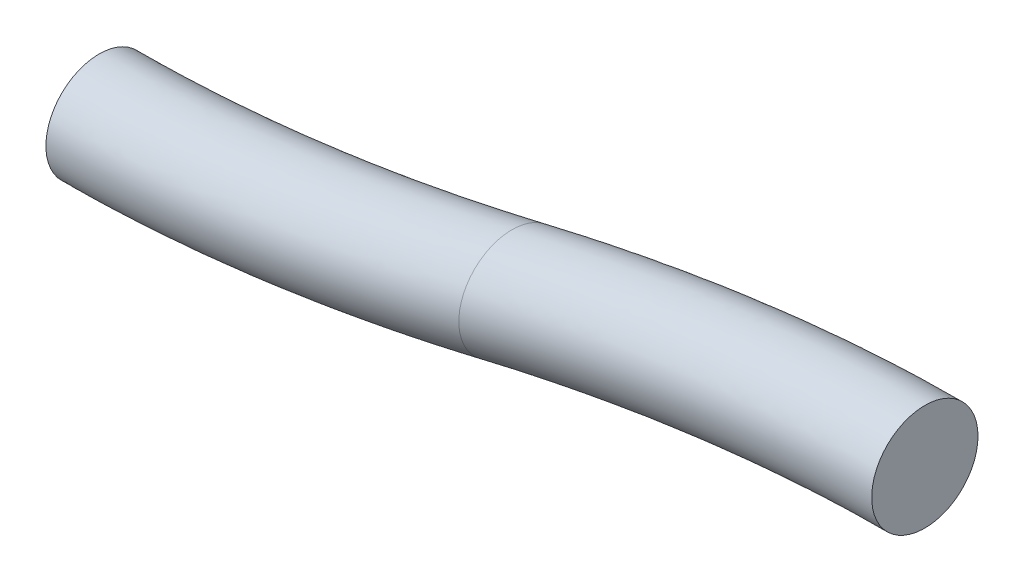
ISO-10303-21;
HEADER;
FILE_DESCRIPTION(('STEP AP214'),'2;1');
FILE_NAME('part.step','',(''),(''),'','','');
FILE_SCHEMA(('AUTOMOTIVE_DESIGN { 1 0 10303 214 1 1 1 1 }'));
ENDSEC;
DATA;
#1=APPLICATION_CONTEXT('core data for automotive mechanical design processes');
#2=APPLICATION_PROTOCOL_DEFINITION('international standard','automotive_design',2000,#1);
#3=PRODUCT_CONTEXT('',#1,'mechanical');
#4=PRODUCT('Part','Part','',(#3));
#5=PRODUCT_RELATED_PRODUCT_CATEGORY('part','',(#4));
#6=PRODUCT_DEFINITION_FORMATION('','',#4);
#7=PRODUCT_DEFINITION_CONTEXT('part definition',#1,'design');
#8=PRODUCT_DEFINITION('design','',#6,#7);
#9=PRODUCT_DEFINITION_SHAPE('','',#8);
#10=(LENGTH_UNIT() NAMED_UNIT(*) SI_UNIT(.MILLI.,.METRE.));
#11=(NAMED_UNIT(*) PLANE_ANGLE_UNIT() SI_UNIT($,.RADIAN.));
#12=(NAMED_UNIT(*) SI_UNIT($,.STERADIAN.) SOLID_ANGLE_UNIT());
#13=UNCERTAINTY_MEASURE_WITH_UNIT(LENGTH_MEASURE(1.E-05),#10,'distance_accuracy_value','');
#14=(GEOMETRIC_REPRESENTATION_CONTEXT(3) GLOBAL_UNCERTAINTY_ASSIGNED_CONTEXT((#13)) GLOBAL_UNIT_ASSIGNED_CONTEXT((#10,
#11,#12)) REPRESENTATION_CONTEXT('',''));
#15=CARTESIAN_POINT('',(0.,0.,0.));
#16=DIRECTION('',(0.,0.,1.));
#17=DIRECTION('',(1.,0.,0.));
#18=AXIS2_PLACEMENT_3D('',#15,#16,#17);
#19=CARTESIAN_POINT('',(0.,0.,0.));
#20=DIRECTION('',(1.,0.,0.));
#21=DIRECTION('',(0.,0.,-1.));
#22=AXIS2_PLACEMENT_3D('',#19,#20,#21);
#23=PLANE('',#22);
#24=CARTESIAN_POINT('',(0.,0.,0.));
#25=DIRECTION('',(1.,0.,0.));
#26=DIRECTION('',(0.,0.,-1.));
#27=AXIS2_PLACEMENT_3D('',#24,#25,#26);
#28=CIRCLE('',#27,4.7625);
#29=CARTESIAN_POINT('',(0.,0.,-4.7625));
#30=VERTEX_POINT('',#29);
#31=EDGE_CURVE('E11',#30,#30,#28,.T.);
#32=ORIENTED_EDGE('',*,*,#31,.F.);
#33=EDGE_LOOP('',(#32));
#34=FACE_BOUND('',#33,.T.);
#35=ADVANCED_FACE('F65',(#34),#23,.F.);
#36=CARTESIAN_POINT('',(0.,0.,-4.7625));
#37=CARTESIAN_POINT('',(2.51954264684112,0.,-4.7625));
#38=CARTESIAN_POINT('',(7.84081137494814,0.,-4.93782136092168));
#39=CARTESIAN_POINT('',(16.0405871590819,0.,-5.84959189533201));
#40=CARTESIAN_POINT('',(24.2075974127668,0.,-7.40065670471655));
#41=CARTESIAN_POINT('',(29.4610948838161,0.,-8.79823791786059));
#42=CARTESIAN_POINT('',(32.131000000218,0.,-9.62533000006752));
#43=CARTESIAN_POINT('',(0.,9.525,-4.7625));
#44=CARTESIAN_POINT('',(2.51954264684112,9.525,-4.7625));
#45=CARTESIAN_POINT('',(7.84081137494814,9.525,-4.93782136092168));
#46=CARTESIAN_POINT('',(16.0405871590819,9.52499999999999,-5.84959189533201));
#47=CARTESIAN_POINT('',(24.2075974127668,9.525,-7.40065670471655));
#48=CARTESIAN_POINT('',(29.4610948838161,9.525,-8.79823791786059));
#49=CARTESIAN_POINT('',(32.131000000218,9.525,-9.62533000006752));
#50=CARTESIAN_POINT('',(0.,9.525,4.7625));
#51=CARTESIAN_POINT('',(2.51954264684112,9.525,4.7625));
#52=CARTESIAN_POINT('',(7.84081137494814,9.525,4.58717863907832));
#53=CARTESIAN_POINT('',(16.0405871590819,9.52499999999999,3.67540810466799));
#54=CARTESIAN_POINT('',(24.2075974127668,9.525,2.12434329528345));
#55=CARTESIAN_POINT('',(29.4610948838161,9.525,0.726762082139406));
#56=CARTESIAN_POINT('',(32.131000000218,9.525,-0.100330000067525));
#57=CARTESIAN_POINT('',(0.,0.,4.7625));
#58=CARTESIAN_POINT('',(2.51954264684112,0.,4.7625));
#59=CARTESIAN_POINT('',(7.84081137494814,0.,4.58717863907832));
#60=CARTESIAN_POINT('',(16.0405871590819,0.,3.67540810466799));
#61=CARTESIAN_POINT('',(24.2075974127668,0.,2.12434329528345));
#62=CARTESIAN_POINT('',(29.4610948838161,0.,0.726762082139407));
#63=CARTESIAN_POINT('',(32.131000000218,0.,-0.100330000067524));
#64=CARTESIAN_POINT('',(0.,-9.525,4.7625));
#65=CARTESIAN_POINT('',(2.51954264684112,-9.525,4.7625));
#66=CARTESIAN_POINT('',(7.84081137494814,-9.525,4.58717863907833));
#67=CARTESIAN_POINT('',(16.0405871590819,-9.52499999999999,3.67540810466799));
#68=CARTESIAN_POINT('',(24.2075974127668,-9.525,2.12434329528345));
#69=CARTESIAN_POINT('',(29.4610948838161,-9.525,0.726762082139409));
#70=CARTESIAN_POINT('',(32.131000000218,-9.525,-0.100330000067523));
#71=CARTESIAN_POINT('',(0.,-9.525,-4.7625));
#72=CARTESIAN_POINT('',(2.51954264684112,-9.525,-4.7625));
#73=CARTESIAN_POINT('',(7.84081137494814,-9.525,-4.93782136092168));
#74=CARTESIAN_POINT('',(16.0405871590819,-9.52499999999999,-5.84959189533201));
#75=CARTESIAN_POINT('',(24.2075974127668,-9.525,-7.40065670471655));
#76=CARTESIAN_POINT('',(29.4610948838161,-9.525,-8.79823791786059));
#77=CARTESIAN_POINT('',(32.131000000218,-9.525,-9.62533000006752));
#78=CARTESIAN_POINT('',(0.,0.,-4.7625));
#79=CARTESIAN_POINT('',(2.51954264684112,0.,-4.7625));
#80=CARTESIAN_POINT('',(7.84081137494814,0.,-4.93782136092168));
#81=CARTESIAN_POINT('',(16.0405871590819,0.,-5.84959189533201));
#82=CARTESIAN_POINT('',(24.2075974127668,0.,-7.40065670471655));
#83=CARTESIAN_POINT('',(29.4610948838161,0.,-8.79823791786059));
#84=CARTESIAN_POINT('',(32.131000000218,0.,-9.62533000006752));
#85=(BOUNDED_SURFACE() B_SPLINE_SURFACE(3,3,((#36,#37,#38,#39,#40,#41,#42),(#43,#44,#45,#46,#47,
#48,#49),(#50,#51,#52,#53,#54,#55,#56),(#57,#58,#59,#60,#61,#62,#63),(#64,#65,#66,#67,#68,#69,
#70),(#71,#72,#73,#74,#75,#76,#77),(#78,#79,#80,#81,#82,#83,#84)),.UNSPECIFIED.,.T.,.F.,
.F.) B_SPLINE_SURFACE_WITH_KNOTS((4,3,4),(4,1,1,1,4),(0.,0.5,1.),(0.,0.280000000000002,0.56,
0.78,1.),.UNSPECIFIED.) GEOMETRIC_REPRESENTATION_ITEM() RATIONAL_B_SPLINE_SURFACE(((1.,1.,1.,1.,
1.,1.,1.),(0.333333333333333,0.333333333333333,0.333333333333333,0.333333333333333,
0.333333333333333,0.333333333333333,0.333333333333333),(0.333333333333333,0.333333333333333,
0.333333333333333,0.333333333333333,0.333333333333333,0.333333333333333,0.333333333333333),(1.,
1.,1.,1.,1.,1.,1.),(0.333333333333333,0.333333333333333,0.333333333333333,0.333333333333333,
0.333333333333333,0.333333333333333,0.333333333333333),(0.333333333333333,0.333333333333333,
0.333333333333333,0.333333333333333,0.333333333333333,0.333333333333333,0.333333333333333),(1.,
1.,1.,1.,1.,1.,1.))) REPRESENTATION_ITEM('') SURFACE());
#86=CARTESIAN_POINT('',(32.131000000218,0.,-4.86283000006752));
#87=DIRECTION('',(1.,0.,0.));
#88=DIRECTION('',(0.,0.,-1.));
#89=AXIS2_PLACEMENT_3D('',#86,#87,#88);
#90=CIRCLE('',#89,4.7625);
#91=CARTESIAN_POINT('',(32.131000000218,0.,-9.62533000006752));
#92=VERTEX_POINT('',#91);
#93=EDGE_CURVE('E71',#92,#92,#90,.T.);
#94=CARTESIAN_POINT('',(0.,0.,-4.7625));
#95=CARTESIAN_POINT('',(0.0175818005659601,0.,-4.76249999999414));
#96=CARTESIAN_POINT('',(0.0351636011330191,0.,-4.76250426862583));
#97=CARTESIAN_POINT('',(0.0703409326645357,0.,-4.7625213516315));
#98=CARTESIAN_POINT('',(0.0879364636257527,0.,-4.76253417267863));
#99=CARTESIAN_POINT('',(0.12314125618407,0.,-4.76256838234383));
#100=CARTESIAN_POINT('',(0.140750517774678,0.,-4.7625897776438));
#101=CARTESIAN_POINT('',(0.17598277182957,0.,-4.76264115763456));
#102=CARTESIAN_POINT('',(0.193605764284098,0.,-4.762671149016));
#103=CARTESIAN_POINT('',(0.228865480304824,0.,-4.76273974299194));
#104=CARTESIAN_POINT('',(0.246502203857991,0.,-4.76277835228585));
#105=CARTESIAN_POINT('',(0.28178938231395,0.,-4.76286420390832));
#106=CARTESIAN_POINT('',(0.299439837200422,0.,-4.76291145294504));
#107=CARTESIAN_POINT('',(0.334754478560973,0.,-4.76301460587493));
#108=CARTESIAN_POINT('',(0.352418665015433,0.,-4.76307051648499));
#109=CARTESIAN_POINT('',(0.387760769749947,0.,-4.7631910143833));
#110=CARTESIAN_POINT('',(0.405438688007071,0.,-4.76325560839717));
#111=CARTESIAN_POINT('',(0.440808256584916,0.,-4.76339349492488));
#112=CARTESIAN_POINT('',(0.458499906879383,0.,-4.76346679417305));
#113=CARTESIAN_POINT('',(0.493896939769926,0.,-4.76362211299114));
#114=CARTESIAN_POINT('',(0.511602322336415,0.,-4.76370413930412));
#115=CARTESIAN_POINT('',(0.547026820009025,0.,-4.76387693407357));
#116=CARTESIAN_POINT('',(0.564745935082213,0.,-4.76396770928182));
#117=CARTESIAN_POINT('',(0.600197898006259,0.,-4.76415802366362));
#118=CARTESIAN_POINT('',(0.617930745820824,0.,-4.76425756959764));
#119=CARTESIAN_POINT('',(0.653410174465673,0.,-4.76446544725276));
#120=CARTESIAN_POINT('',(0.671156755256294,0.,-4.76457378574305));
#121=CARTESIAN_POINT('',(0.706663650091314,0.,-4.76479927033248));
#122=CARTESIAN_POINT('',(0.72442396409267,0.,-4.76491642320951));
#123=CARTESIAN_POINT('',(0.759958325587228,0.,-4.76515955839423));
#124=CARTESIAN_POINT('',(0.777732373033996,0.,-4.76528554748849));
#125=CARTESIAN_POINT('',(0.813294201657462,0.,-4.76554637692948));
#126=CARTESIAN_POINT('',(0.83108198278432,0.,-4.76568122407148));
#127=CARTESIAN_POINT('',(0.86667127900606,0.,-4.76595979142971));
#128=CARTESIAN_POINT('',(0.884472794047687,0.,-4.76610351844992));
#129=CARTESIAN_POINT('',(0.92008955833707,0.,-4.76639986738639));
#130=CARTESIAN_POINT('',(0.937904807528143,0.,-4.7665524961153));
#131=CARTESIAN_POINT('',(0.973549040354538,0.,-4.76686667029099));
#132=CARTESIAN_POINT('',(0.991378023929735,0.,-4.76702822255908));
#133=CARTESIAN_POINT('',(1.02704972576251,0.,-4.76736026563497));
#134=CARTESIAN_POINT('',(1.04489244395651,0.,-4.76753076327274));
#135=CARTESIAN_POINT('',(1.08059161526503,0.,-4.7678807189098));
#136=CARTESIAN_POINT('',(1.09844806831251,0.,-4.76806018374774));
#137=CARTESIAN_POINT('',(1.13417470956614,0.,-4.76842809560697));
#138=CARTESIAN_POINT('',(1.15204489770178,0.,-4.76861654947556));
#139=CARTESIAN_POINT('',(1.1877990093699,0.,-4.76900246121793));
#140=CARTESIAN_POINT('',(1.20568293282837,0.,-4.76919992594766));
#141=CARTESIAN_POINT('',(1.24146451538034,0.,-4.76960388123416));
#142=CARTESIAN_POINT('',(1.25936217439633,0.,-4.76981037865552));
#143=CARTESIAN_POINT('',(1.29517122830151,0.,-4.77023242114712));
#144=CARTESIAN_POINT('',(1.31308262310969,0.,-4.77044797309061));
#145=CARTESIAN_POINT('',(1.34891914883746,0.,-4.7708881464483));
#146=CARTESIAN_POINT('',(1.36684427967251,0.,-4.77111277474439));
#147=CARTESIAN_POINT('',(1.40270827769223,0.,-4.77157112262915));
#148=CARTESIAN_POINT('',(1.42064714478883,0.,-4.77180484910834));
#149=CARTESIAN_POINT('',(1.45653861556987,0.,-4.77228141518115));
#150=CARTESIAN_POINT('',(1.4744912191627,0.,-4.77252426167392));
#151=CARTESIAN_POINT('',(1.51041016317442,0.,-4.77301908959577));
#152=CARTESIAN_POINT('',(1.52837650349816,0.,-4.77327107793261));
#153=CARTESIAN_POINT('',(1.56432292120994,0.,-4.77378421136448));
#154=CARTESIAN_POINT('',(1.58230299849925,0.,-4.77404536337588));
#155=CARTESIAN_POINT('',(1.61827689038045,0.,-4.77457684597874));
#156=CARTESIAN_POINT('',(1.63627070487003,0.,-4.7748471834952));
#157=CARTESIAN_POINT('',(1.67227207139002,0.,-4.77539705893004));
#158=CARTESIAN_POINT('',(1.69027962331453,0.,-4.77567660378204));
#159=CARTESIAN_POINT('',(1.72630846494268,0.,-4.77624491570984));
#160=CARTESIAN_POINT('',(1.74432975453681,0.,-4.77653368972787));
#161=CARTESIAN_POINT('',(1.78038607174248,0.,-4.77712048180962));
#162=CARTESIAN_POINT('',(1.79842109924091,0.,-4.77741850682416));
#163=CARTESIAN_POINT('',(1.83450489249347,0.,-4.77802382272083));
#164=CARTESIAN_POINT('',(1.85255365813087,0.,-4.77833112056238));
#165=CARTESIAN_POINT('',(1.88866492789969,0.,-4.77895500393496));
#166=CARTESIAN_POINT('',(1.90672743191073,0.,-4.779271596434));
#167=CARTESIAN_POINT('',(1.94286617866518,0.,-4.77991409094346));
#168=CARTESIAN_POINT('',(1.96094242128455,0.,-4.78023999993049));
#169=CARTESIAN_POINT('',(1.99710864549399,0.,-4.78090114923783));
#170=CARTESIAN_POINT('',(2.01519862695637,0.,-4.78123639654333));
#171=CARTESIAN_POINT('',(2.05139232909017,0.,-4.78191624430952));
#172=CARTESIAN_POINT('',(2.06949604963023,0.,-4.78226085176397));
#173=CARTESIAN_POINT('',(2.10571723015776,0.,-4.78295944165));
#174=CARTESIAN_POINT('',(2.12383469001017,0.,-4.78331343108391));
#175=CARTESIAN_POINT('',(2.1600833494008,0.,-4.78403080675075));
#176=CARTESIAN_POINT('',(2.17821454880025,0.,-4.7843941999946));
#177=CARTESIAN_POINT('',(2.21449068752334,0.,-4.78513040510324));
#178=CARTESIAN_POINT('',(2.23263562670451,0.,-4.78550322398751));
#179=CARTESIAN_POINT('',(2.26893924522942,0.,-4.78625830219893));
#180=CARTESIAN_POINT('',(2.28709792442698,0.,-4.78664056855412));
#181=CARTESIAN_POINT('',(2.32342902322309,0.,-4.7874145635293));
#182=CARTESIAN_POINT('',(2.34160144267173,0.,-4.7878062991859));
#183=CARTESIAN_POINT('',(2.3779600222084,0.,-4.78859925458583));
#184=CARTESIAN_POINT('',(2.39614618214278,0.,-4.78900048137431));
#185=CARTESIAN_POINT('',(2.43253224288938,0.,-4.78981244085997));
#186=CARTESIAN_POINT('',(2.45073214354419,0.,-4.79022318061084));
#187=CARTESIAN_POINT('',(2.48714568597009,0.,-4.7910541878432));
#188=CARTESIAN_POINT('',(2.50535932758,0.,-4.79147446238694));
#189=CARTESIAN_POINT('',(2.54180035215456,0.,-4.792324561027));
#190=CARTESIAN_POINT('',(2.56002773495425,0.,-4.7927543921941));
#191=CARTESIAN_POINT('',(2.59649624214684,0.,-4.79362362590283));
#192=CARTESIAN_POINT('',(2.61473736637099,0.,-4.79406303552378));
#193=CARTESIAN_POINT('',(2.65123335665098,0.,-4.79495144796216));
#194=CARTESIAN_POINT('',(2.66948822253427,0.,-4.79540045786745));
#195=CARTESIAN_POINT('',(2.70601169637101,0.,-4.79630809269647));
#196=CARTESIAN_POINT('',(2.72428030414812,0.,-4.79676672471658));
#197=CARTESIAN_POINT('',(2.76083126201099,0.,-4.79769362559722));
#198=CARTESIAN_POINT('',(2.77911361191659,0.,-4.79816190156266));
#199=CARTESIAN_POINT('',(2.81569205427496,0.,-4.79910811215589));
#200=CARTESIAN_POINT('',(2.83398814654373,0.,-4.79958605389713));
#201=CARTESIAN_POINT('',(2.87059407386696,0.,-4.80055161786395));
#202=CARTESIAN_POINT('',(2.88890390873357,0.,-4.80103924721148));
#203=CARTESIAN_POINT('',(2.92553732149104,0.,-4.80202420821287));
#204=CARTESIAN_POINT('',(2.94386089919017,0.,-4.80252154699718));
#205=CARTESIAN_POINT('',(2.98052179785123,0.,-4.80352594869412));
#206=CARTESIAN_POINT('',(2.99885911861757,0.,-4.80403301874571));
#207=CARTESIAN_POINT('',(3.03554750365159,0.,-4.80505690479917));
#208=CARTESIAN_POINT('',(3.05389856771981,0.,-4.80557372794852));
#209=CARTESIAN_POINT('',(3.09061443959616,0.,-4.80661714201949));
#210=CARTESIAN_POINT('',(3.10897924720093,0.,-4.80714374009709));
#211=CARTESIAN_POINT('',(3.14572260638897,0.,-4.80820672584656));
#212=CARTESIAN_POINT('',(3.16410115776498,0.,-4.8087431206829));
#213=CARTESIAN_POINT('',(3.20087200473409,0.,-4.80982572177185));
#214=CARTESIAN_POINT('',(3.21926430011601,0.,-4.81037193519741));
#215=CARTESIAN_POINT('',(3.25606263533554,0.,-4.81147419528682));
#216=CARTESIAN_POINT('',(3.27446867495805,0.,-4.8120302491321));
#217=CARTESIAN_POINT('',(3.31129449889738,0.,-4.81315221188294));
#218=CARTESIAN_POINT('',(3.32971428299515,0.,-4.81371812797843));
#219=CARTESIAN_POINT('',(3.36656759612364,0.,-4.8148598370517));
#220=CARTESIAN_POINT('',(3.38500112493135,0.,-4.81543563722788));
#221=CARTESIAN_POINT('',(3.42188192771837,0.,-4.81659713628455));
#222=CARTESIAN_POINT('',(3.4403292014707,0.,-4.81718284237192));
#223=CARTESIAN_POINT('',(3.47723749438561,0.,-4.81836417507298));
#224=CARTESIAN_POINT('',(3.49569851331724,0.,-4.81895980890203));
#225=CARTESIAN_POINT('',(3.53263429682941,0.,-4.82016101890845));
#226=CARTESIAN_POINT('',(3.55110906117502,0.,-4.82076660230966));
#227=CARTESIAN_POINT('',(3.58807233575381,0.,-4.82198773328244));
#228=CARTESIAN_POINT('',(3.60656084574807,0.,-4.8226032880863));
#229=CARTESIAN_POINT('',(3.64355161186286,0.,-4.8238443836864));
#230=CARTESIAN_POINT('',(3.66205386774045,0.,-4.82446993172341));
#231=CARTESIAN_POINT('',(3.69907212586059,0.,-4.82573103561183));
#232=CARTESIAN_POINT('',(3.71758812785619,0.,-4.82636659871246));
#233=CARTESIAN_POINT('',(3.75463387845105,0.,-4.82764775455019));
#234=CARTESIAN_POINT('',(3.77316362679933,0.,-4.82829335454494));
#235=CARTESIAN_POINT('',(3.81023687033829,0.,-4.82959460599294));
#236=CARTESIAN_POINT('',(3.82878036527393,0.,-4.8302502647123));
#237=CARTESIAN_POINT('',(3.86588110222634,0.,-4.83157165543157));
#238=CARTESIAN_POINT('',(3.88443834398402,0.,-4.83223739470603));
#239=CARTESIAN_POINT('',(3.92156657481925,0.,-4.83357896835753));
#240=CARTESIAN_POINT('',(3.94013756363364,0.,-4.83425481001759));
#241=CARTESIAN_POINT('',(3.97729328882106,0.,-4.83561661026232));
#242=CARTESIAN_POINT('',(3.99587802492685,0.,-4.83630257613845));
#243=CARTESIAN_POINT('',(4.03306124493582,0.,-4.83768464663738));
#244=CARTESIAN_POINT('',(4.05165972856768,0.,-4.83838075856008));
#245=CARTESIAN_POINT('',(4.08887044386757,0.,-4.83978314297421));
#246=CARTESIAN_POINT('',(4.10748267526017,0.,-4.84048942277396));
#247=CARTESIAN_POINT('',(4.14472088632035,0.,-4.84191216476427));
#248=CARTESIAN_POINT('',(4.16334686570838,0.,-4.84262863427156));
#249=CARTESIAN_POINT('',(4.2006125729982,0.,-4.84407177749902));
#250=CARTESIAN_POINT('',(4.21925230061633,0.,-4.84479845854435));
#251=CARTESIAN_POINT('',(4.25654550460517,0.,-4.84626204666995));
#252=CARTESIAN_POINT('',(4.27519898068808,0.,-4.8469989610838));
#253=CARTESIAN_POINT('',(4.3125196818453,0.,-4.84848303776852));
#254=CARTESIAN_POINT('',(4.33118690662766,0.,-4.84923020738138));
#255=CARTESIAN_POINT('',(4.36853510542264,0.,-4.8507348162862));
#256=CARTESIAN_POINT('',(4.38721607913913,0.,-4.85149226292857));
#257=CARTESIAN_POINT('',(4.42459177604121,0.,-4.85301744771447));
#258=CARTESIAN_POINT('',(4.44328649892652,0.,-4.85378519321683));
#259=CARTESIAN_POINT('',(4.48068969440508,0.,-4.8553309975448));
#260=CARTESIAN_POINT('',(4.49939816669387,0.,-4.85610906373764));
#261=CARTESIAN_POINT('',(4.53682886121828,0.,-4.85767553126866));
#262=CARTESIAN_POINT('',(4.55555108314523,0.,-4.85846393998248));
#263=CARTESIAN_POINT('',(4.59300927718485,0.,-4.86005111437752));
#264=CARTESIAN_POINT('',(4.61174524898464,0.,-4.8608498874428));
#265=CARTESIAN_POINT('',(4.64923094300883,0.,-4.86245781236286));
#266=CARTESIAN_POINT('',(4.66798066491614,0.,-4.86326697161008));
#267=CARTESIAN_POINT('',(4.70549385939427,0.,-4.86489569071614));
#268=CARTESIAN_POINT('',(4.72425733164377,0.,-4.8657152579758));
#269=CARTESIAN_POINT('',(4.76179802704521,0.,-4.86736481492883));
#270=CARTESIAN_POINT('',(4.78057524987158,0.,-4.86819481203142));
#271=CARTESIAN_POINT('',(4.81814344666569,0.,-4.86986525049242));
#272=CARTESIAN_POINT('',(4.83693442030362,0.,-4.87070569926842));
#273=CARTESIAN_POINT('',(4.87453011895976,0.,-4.87239706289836));
#274=CARTESIAN_POINT('',(4.89333484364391,0.,-4.87324798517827));
#275=CARTESIAN_POINT('',(4.93095804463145,0.,-4.87496031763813));
#276=CARTESIAN_POINT('',(4.9497765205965,0.,-4.87582173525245));
#277=CARTESIAN_POINT('',(4.98742722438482,0.,-4.87755508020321));
#278=CARTESIAN_POINT('',(5.00625945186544,0.,-4.87842701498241));
#279=CARTESIAN_POINT('',(5.04393765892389,0.,-4.88018141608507));
#280=CARTESIAN_POINT('',(5.06278363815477,0.,-4.88106388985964));
#281=CARTESIAN_POINT('',(5.10048934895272,0.,-4.88283939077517));
#282=CARTESIAN_POINT('',(5.11934908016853,0.,-4.88373242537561));
#283=CARTESIAN_POINT('',(5.15708229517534,0.,-4.88552906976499));
#284=CARTESIAN_POINT('',(5.17595577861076,0.,-4.88643268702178));
#285=CARTESIAN_POINT('',(5.21371649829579,0.,-4.888250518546));
#286=CARTESIAN_POINT('',(5.2326037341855,0.,-4.88916474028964));
#287=CARTESIAN_POINT('',(5.27039195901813,0.,-4.89100380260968));
#288=CARTESIAN_POINT('',(5.2892929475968,0.,-4.89192865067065));
#289=CARTESIAN_POINT('',(5.32710867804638,0.,-4.89378898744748));
#290=CARTESIAN_POINT('',(5.34602341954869,0.,-4.89472448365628));
#291=CARTESIAN_POINT('',(5.3838666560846,0.,-4.8966061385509));
#292=CARTESIAN_POINT('',(5.40279515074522,0.,-4.897552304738));
#293=CARTESIAN_POINT('',(5.44066589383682,0.,-4.89945532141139));
#294=CARTESIAN_POINT('',(5.45960814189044,0.,-4.9004121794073));
#295=CARTESIAN_POINT('',(5.49750639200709,0.,-4.90233660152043));
#296=CARTESIAN_POINT('',(5.51646239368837,0.,-4.90330417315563));
#297=CARTESIAN_POINT('',(5.55438815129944,0.,-4.90525004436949));
#298=CARTESIAN_POINT('',(5.57335790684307,0.,-4.90622835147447));
#299=CARTESIAN_POINT('',(5.61131117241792,0.,-4.90819571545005));
#300=CARTESIAN_POINT('',(5.63029468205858,0.,-4.9091847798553));
#301=CARTESIAN_POINT('',(5.66827545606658,0.,-4.91117368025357));
#302=CARTESIAN_POINT('',(5.68727272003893,0.,-4.91217352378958));
#303=CARTESIAN_POINT('',(5.72528100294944,0.,-4.91418400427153));
#304=CARTESIAN_POINT('',(5.74429202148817,0.,-4.91519464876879));
#305=CARTESIAN_POINT('',(5.78232781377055,0.,-4.9172267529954));
#306=CARTESIAN_POINT('',(5.80135258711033,0.,-4.9182482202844));
#307=CARTESIAN_POINT('',(5.83941588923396,0.,-4.92030199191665));
#308=CARTESIAN_POINT('',(5.85845441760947,0.,-4.92133430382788));
#309=CARTESIAN_POINT('',(5.89654523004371,0.,-4.92340978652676));
#310=CARTESIAN_POINT('',(5.91559751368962,0.,-4.9244529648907));
#311=CARTESIAN_POINT('',(5.95371583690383,0.,-4.92655020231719));
#312=CARTESIAN_POINT('',(5.97278187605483,0.,-4.92760426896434));
#313=CARTESIAN_POINT('',(6.01092771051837,0.,-4.92972330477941));
#314=CARTESIAN_POINT('',(6.03000750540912,0.,-4.93078828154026));
#315=CARTESIAN_POINT('',(6.06818085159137,0.,-4.93292915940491));
#316=CARTESIAN_POINT('',(6.08727440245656,0.,-4.93400506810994));
#317=CARTESIAN_POINT('',(6.12547526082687,0.,-4.93616783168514));
#318=CARTESIAN_POINT('',(6.14458256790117,0.,-4.93725469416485));
#319=CARTESIAN_POINT('',(6.18281093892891,0.,-4.93943938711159));
#320=CARTESIAN_POINT('',(6.201932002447,0.,-4.94053722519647));
#321=CARTESIAN_POINT('',(6.24018788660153,0.,-4.94274389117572));
#322=CARTESIAN_POINT('',(6.25932270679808,0.,-4.94385272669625));
#323=CARTESIAN_POINT('',(6.29760610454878,0.,-4.94608140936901));
#324=CARTESIAN_POINT('',(6.31675468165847,0.,-4.94720126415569));
#325=CARTESIAN_POINT('',(6.35506559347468,0.,-4.94945200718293));
#326=CARTESIAN_POINT('',(6.3742279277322,0.,-4.95058290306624));
#327=CARTESIAN_POINT('',(6.4125663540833,0.,-4.95285575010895));
#328=CARTESIAN_POINT('',(6.4317424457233,0.,-4.95399770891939));
#329=CARTESIAN_POINT('',(6.47010838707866,0.,-4.95629270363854));
#330=CARTESIAN_POINT('',(6.48929823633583,0.,-4.95744574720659));
#331=CARTESIAN_POINT('',(6.5276916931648,0.,-4.95976293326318));
#332=CARTESIAN_POINT('',(6.54689530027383,0.,-4.96092708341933));
#333=CARTESIAN_POINT('',(6.58531627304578,0.,-4.96326650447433));
#334=CARTESIAN_POINT('',(6.60453363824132,0.,-4.96444178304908));
#335=CARTESIAN_POINT('',(6.64298212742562,0.,-4.96680348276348));
#336=CARTESIAN_POINT('',(6.66221325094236,0.,-4.9679899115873));
#337=CARTESIAN_POINT('',(6.70068925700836,0.,-4.97037393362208));
#338=CARTESIAN_POINT('',(6.71993413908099,0.,-4.97157153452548));
#339=CARTESIAN_POINT('',(6.75843766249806,0.,-4.97397792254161));
#340=CARTESIAN_POINT('',(6.77769630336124,0.,-4.97518671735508));
#341=CARTESIAN_POINT('',(6.81622734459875,0.,-4.97761551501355));
#342=CARTESIAN_POINT('',(6.83549974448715,0.,-4.97883552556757));
#343=CARTESIAN_POINT('',(6.87405830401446,0.,-4.98128677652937));
#344=CARTESIAN_POINT('',(6.89334446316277,0.,-4.98251802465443));
#345=CARTESIAN_POINT('',(6.93193054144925,0.,-4.98499177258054));
#346=CARTESIAN_POINT('',(6.95123046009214,0.,-4.98623428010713));
#347=CARTESIAN_POINT('',(6.98984405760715,0.,-4.98873056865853));
#348=CARTESIAN_POINT('',(7.00915773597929,0.,-4.98998435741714));
#349=CARTESIAN_POINT('',(7.0477988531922,0.,-4.99250323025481));
#350=CARTESIAN_POINT('',(7.06712629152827,0.,-4.99376832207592));
#351=CARTESIAN_POINT('',(7.10579492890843,0.,-4.99630982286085));
#352=CARTESIAN_POINT('',(7.12513612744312,0.,-4.99758623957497));
#353=CARTESIAN_POINT('',(7.1638322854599,0.,-5.00015041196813));
#354=CARTESIAN_POINT('',(7.18318724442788,0.,-5.00143817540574));
#355=CARTESIAN_POINT('',(7.22191092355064,0.,-5.00402506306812));
#356=CARTESIAN_POINT('',(7.24127964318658,0.,-5.00532419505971));
#357=CARTESIAN_POINT('',(7.28003084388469,0.,-5.0079338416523));
#358=CARTESIAN_POINT('',(7.29941332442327,0.,-5.00924436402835));
#359=CARTESIAN_POINT('',(7.3381920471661,0.,-5.01187681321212));
#360=CARTESIAN_POINT('',(7.35758828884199,0.,-5.01319874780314));
#361=CARTESIAN_POINT('',(7.39639453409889,0.,-5.01585404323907));
#362=CARTESIAN_POINT('',(7.41580453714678,0.,-5.01718741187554));
#363=CARTESIAN_POINT('',(7.45463830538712,0.,-5.01986559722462));
#364=CARTESIAN_POINT('',(7.47406207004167,0.,-5.02121042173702));
#365=CARTESIAN_POINT('',(7.51292336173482,0.,-5.02391154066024));
#366=CARTESIAN_POINT('',(7.53236088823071,0.,-5.02526784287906));
#367=CARTESIAN_POINT('',(7.57124970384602,0.,-5.02799193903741));
#368=CARTESIAN_POINT('',(7.59070099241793,0.,-5.02935974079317));
#369=CARTESIAN_POINT('',(7.62961733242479,0.,-5.03210685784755));
#370=CARTESIAN_POINT('',(7.6490823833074,0.,-5.03348618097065));
#371=CARTESIAN_POINT('',(7.68802624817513,0.,-5.03625636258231));
#372=CARTESIAN_POINT('',(7.70750506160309,0.,-5.03764722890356));
#373=CARTESIAN_POINT('',(7.74647645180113,0.,-5.04044051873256));
#374=CARTESIAN_POINT('',(7.76596902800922,0.,-5.04184295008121));
#375=CARTESIAN_POINT('',(7.80496794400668,0.,-5.04465939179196));
#376=CARTESIAN_POINT('',(7.82447428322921,0.,-5.0460734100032));
#377=CARTESIAN_POINT('',(7.86350072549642,0.,-5.04891304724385));
#378=CARTESIAN_POINT('',(7.88302082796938,0.,-5.05033867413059));
#379=CARTESIAN_POINT('',(7.92207479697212,0.,-5.0532015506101));
#380=CARTESIAN_POINT('',(7.9416086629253,0.,-5.05463880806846));
#381=CARTESIAN_POINT('',(7.98069015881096,0.,-5.05752496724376));
#382=CARTESIAN_POINT('',(8.00023778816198,0.,-5.05897387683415));
#383=CARTESIAN_POINT('',(8.0393468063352,0.,-5.06188336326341));
#384=CARTESIAN_POINT('',(8.05890819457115,0.,-5.06334394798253));
#385=CARTESIAN_POINT('',(8.09804472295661,0.,-5.06627680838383));
#386=CARTESIAN_POINT('',(8.11761986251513,0.,-5.06774909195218));
#387=CARTESIAN_POINT('',(8.15678388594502,0.,-5.07070537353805));
#388=CARTESIAN_POINT('',(8.17637276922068,0.,-5.07218937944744));
#389=CARTESIAN_POINT('',(8.21556427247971,0.,-5.07516912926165));
#390=CARTESIAN_POINT('',(8.23516689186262,0.,-5.07666488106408));
#391=CARTESIAN_POINT('',(8.27438585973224,0.,-5.07966814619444));
#392=CARTESIAN_POINT('',(8.29400220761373,0.,-5.08117566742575));
#393=CARTESIAN_POINT('',(8.33324862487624,0.,-5.0842024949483));
#394=CARTESIAN_POINT('',(8.35287869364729,0.,-5.08572180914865));
#395=CARTESIAN_POINT('',(8.39215254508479,0.,-5.08877224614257));
#396=CARTESIAN_POINT('',(8.41179632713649,0.,-5.09030337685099));
#397=CARTESIAN_POINT('',(8.45109759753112,0.,-5.09337747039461));
#398=CARTESIAN_POINT('',(8.47075508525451,0.,-5.09492044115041));
#399=CARTESIAN_POINT('',(8.5100837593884,0.,-5.09801823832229));
#400=CARTESIAN_POINT('',(8.52975494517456,0.,-5.09957307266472));
#401=CARTESIAN_POINT('',(8.56911100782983,0.,-5.10269462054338));
#402=CARTESIAN_POINT('',(8.58879588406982,0.,-5.10426134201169));
#403=CARTESIAN_POINT('',(8.62817932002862,0.,-5.10740668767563));
#404=CARTESIAN_POINT('',(8.64787787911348,0.,-5.10898531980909));
#405=CARTESIAN_POINT('',(8.68728867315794,0.,-5.11215451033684));
#406=CARTESIAN_POINT('',(8.70700090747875,0.,-5.1137450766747));
#407=CARTESIAN_POINT('',(8.746439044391,0.,-5.11693815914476));
#408=CARTESIAN_POINT('',(8.76616494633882,0.,-5.11854068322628));
#409=CARTESIAN_POINT('',(8.80563041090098,0.,-5.12175770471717));
#410=CARTESIAN_POINT('',(8.82536997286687,0.,-5.12337221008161));
#411=CARTESIAN_POINT('',(8.86486274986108,0.,-5.12661321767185));
#412=CARTESIAN_POINT('',(8.8846159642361,0.,-5.12823972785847));
#413=CARTESIAN_POINT('',(8.9241360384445,0.,-5.13150476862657));
#414=CARTESIAN_POINT('',(8.9439028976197,0.,-5.13314330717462));
#415=CARTESIAN_POINT('',(8.98345025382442,0.,-5.13643242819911));
#416=CARTESIAN_POINT('',(9.00323075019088,0.,-5.13808301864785));
#417=CARTESIAN_POINT('',(9.04280537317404,0.,-5.14139626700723));
#418=CARTESIAN_POINT('',(9.06259949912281,0.,-5.14305893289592));
#419=CARTESIAN_POINT('',(9.10220137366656,0.,-5.1463963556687));
#420=CARTESIAN_POINT('',(9.1220091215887,0.,-5.1480711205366));
#421=CARTESIAN_POINT('',(9.16163823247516,0.,-5.15143276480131));
#422=CARTESIAN_POINT('',(9.18145959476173,0.,-5.15311965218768));
#423=CARTESIAN_POINT('',(9.22111592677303,0.,-5.15650556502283));
#424=CARTESIAN_POINT('',(9.2409508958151,0.,-5.15820459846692));
#425=CARTESIAN_POINT('',(9.28063443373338,0.,-5.16161482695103));
#426=CARTESIAN_POINT('',(9.30048300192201,0.,-5.1633260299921));
#427=CARTESIAN_POINT('',(9.34019373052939,0.,-5.16676062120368));
#428=CARTESIAN_POINT('',(9.36005589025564,0.,-5.16848401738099));
#429=CARTESIAN_POINT('',(9.39979379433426,0.,-5.17194301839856));
#430=CARTESIAN_POINT('',(9.41966953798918,0.,-5.17367863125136));
#431=CARTESIAN_POINT('',(9.45943460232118,0.,-5.17716208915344));
#432=CARTESIAN_POINT('',(9.47932392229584,0.,-5.178909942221));
#433=CARTESIAN_POINT('',(9.51911613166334,0.,-5.18241790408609));
#434=CARTESIAN_POINT('',(9.5390190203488,0.,-5.18417802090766));
#435=CARTESIAN_POINT('',(9.57883835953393,0.,-5.18771053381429));
#436=CARTESIAN_POINT('',(9.59875480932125,0.,-5.18948293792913));
#437=CARTESIAN_POINT('',(9.63860126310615,0.,-5.19304004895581));
#438=CARTESIAN_POINT('',(9.65853126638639,0.,-5.19482476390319));
#439=CARTESIAN_POINT('',(9.69840481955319,0.,-5.19840652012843));
#440=CARTESIAN_POINT('',(9.71834836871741,0.,-5.20020356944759));
#441=CARTESIAN_POINT('',(9.75824900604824,0.,-5.20381001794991));
#442=CARTESIAN_POINT('',(9.7782060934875,0.,-5.20561942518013));
#443=CARTESIAN_POINT('',(9.81813379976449,0.,-5.20925061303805));
#444=CARTESIAN_POINT('',(9.83810441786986,0.,-5.21107240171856));
#445=CARTESIAN_POINT('',(9.87805917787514,0.,-5.21472837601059));
#446=CARTESIAN_POINT('',(9.89804331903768,0.,-5.21656256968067));
#447=CARTESIAN_POINT('',(9.93802511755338,0.,-5.22024337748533));
#448=CARTESIAN_POINT('',(9.95802277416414,0.,-5.22208999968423));
#449=CARTESIAN_POINT('',(9.9980315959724,0.,-5.22579568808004));
#450=CARTESIAN_POINT('',(10.0180427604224,0.,-5.22765476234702));
#451=CARTESIAN_POINT('',(10.0580785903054,0.,-5.23138537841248));
#452=CARTESIAN_POINT('',(10.0781032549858,0.,-5.2332569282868));
#453=CARTESIAN_POINT('',(10.1181660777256,0.,-5.23701251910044));
#454=CARTESIAN_POINT('',(10.1382042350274,0.,-5.23889656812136));
#455=CARTESIAN_POINT('',(10.1782940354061,0.,-5.24267718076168));
#456=CARTESIAN_POINT('',(10.1983456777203,0.,-5.24457375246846));
#457=CARTESIAN_POINT('',(10.2384624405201,0.,-5.24837943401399));
#458=CARTESIAN_POINT('',(10.2585275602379,0.,-5.25028855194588));
#459=CARTESIAN_POINT('',(10.298671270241,0.,-5.25411934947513));
#460=CARTESIAN_POINT('',(10.3187498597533,0.,-5.25604103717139));
#461=CARTESIAN_POINT('',(10.3589205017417,0.,-5.25989699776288));
#462=CARTESIAN_POINT('',(10.3790125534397,0.,-5.26183127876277));
#463=CARTESIAN_POINT('',(10.4192101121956,0.,-5.26571244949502));
#464=CARTESIAN_POINT('',(10.4393156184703,0.,-5.2676593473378));
#465=CARTESIAN_POINT('',(10.4795400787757,0.,-5.27156577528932));
#466=CARTESIAN_POINT('',(10.4996590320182,0.,-5.27352531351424));
#467=CARTESIAN_POINT('',(10.5399103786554,0.,-5.27745704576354));
#468=CARTESIAN_POINT('',(10.5600427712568,0.,-5.27942924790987));
#469=CARTESIAN_POINT('',(10.6003209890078,0.,-5.28338633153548));
#470=CARTESIAN_POINT('',(10.6204668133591,0.,-5.28537122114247));
#471=CARTESIAN_POINT('',(10.6607718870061,0.,-5.2893537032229));
#472=CARTESIAN_POINT('',(10.6809311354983,0.,-5.29135130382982));
#473=CARTESIAN_POINT('',(10.7212630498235,0.,-5.29535923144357));
#474=CARTESIAN_POINT('',(10.7414357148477,0.,-5.29736956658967));
#475=CARTESIAN_POINT('',(10.7817944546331,0.,-5.30140298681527));
#476=CARTESIAN_POINT('',(10.8019805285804,0.,-5.30342608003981));
#477=CARTESIAN_POINT('',(10.8423660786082,0.,-5.30748503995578));
#478=CARTESIAN_POINT('',(10.8625655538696,0.,-5.30952091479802));
#479=CARTESIAN_POINT('',(10.902977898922,0.,-5.31360546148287));
#480=CARTESIAN_POINT('',(10.9231907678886,0.,-5.31565414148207));
#481=CARTESIAN_POINT('',(10.9636298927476,0.,-5.31976432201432));
#482=CARTESIAN_POINT('',(10.9838561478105,0.,-5.32182583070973));
#483=CARTESIAN_POINT('',(11.0243220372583,0.,-5.32596169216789));
#484=CARTESIAN_POINT('',(11.0445616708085,0.,-5.32803605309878));
#485=CARTESIAN_POINT('',(11.0850543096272,0.,-5.33219764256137));
#486=CARTESIAN_POINT('',(11.1053073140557,0.,-5.33428487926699));
#487=CARTESIAN_POINT('',(11.1458266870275,0.,-5.33847224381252));
#488=CARTESIAN_POINT('',(11.1660930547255,0.,-5.34057237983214));
#489=CARTESIAN_POINT('',(11.2066391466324,0.,-5.34478556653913));
#490=CARTESIAN_POINT('',(11.2269188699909,0.,-5.34689862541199));
#491=CARTESIAN_POINT('',(11.2674916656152,0.,-5.35113768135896));
#492=CARTESIAN_POINT('',(11.2877847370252,0.,-5.35326368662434));
#493=CARTESIAN_POINT('',(11.3283842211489,0.,-5.3575286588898));
#494=CARTESIAN_POINT('',(11.3486906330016,0.,-5.35966763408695));
#495=CARTESIAN_POINT('',(11.3893167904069,0.,-5.36395856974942));
#496=CARTESIAN_POINT('',(11.4096365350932,0.,-5.36611053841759));
#497=CARTESIAN_POINT('',(11.4502893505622,0.,-5.37042748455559));
#498=CARTESIAN_POINT('',(11.4706224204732,0.,-5.37259247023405));
#499=CARTESIAN_POINT('',(11.511301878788,0.,-5.37693547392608));
#500=CARTESIAN_POINT('',(11.5316482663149,0.,-5.37911350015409));
#501=CARTESIAN_POINT('',(11.5723543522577,0.,-5.38348260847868));
#502=CARTESIAN_POINT('',(11.5927140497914,0.,-5.38567369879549));
#503=CARTESIAN_POINT('',(11.6334467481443,0.,-5.39006895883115));
#504=CARTESIAN_POINT('',(11.6538197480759,0.,-5.39227313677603));
#505=CARTESIAN_POINT('',(11.694579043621,0.,-5.39669459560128));
#506=CARTESIAN_POINT('',(11.7149653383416,0.,-5.39891188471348));
#507=CARTESIAN_POINT('',(11.7557512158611,0.,-5.40335958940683));
#508=CARTESIAN_POINT('',(11.7761507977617,0.,-5.40559001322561));
#509=CARTESIAN_POINT('',(11.8169632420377,0.,-5.41006401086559));
#510=CARTESIAN_POINT('',(11.8373761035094,0.,-5.41230759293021));
#511=CARTESIAN_POINT('',(11.878215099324,0.,-5.41680793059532));
#512=CARTESIAN_POINT('',(11.8986412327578,0.,-5.41906469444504));
#513=CARTESIAN_POINT('',(11.9395067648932,0.,-5.42359141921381));
#514=CARTESIAN_POINT('',(11.9599461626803,0.,-5.42586138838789));
#515=CARTESIAN_POINT('',(12.0008382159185,0.,-5.43041454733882));
#516=CARTESIAN_POINT('',(12.0212908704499,0.,-5.43269774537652));
#517=CARTESIAN_POINT('',(12.0622094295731,0.,-5.43727738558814));
#518=CARTESIAN_POINT('',(12.0826753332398,0.,-5.43957383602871));
#519=CARTESIAN_POINT('',(12.1236203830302,0.,-5.44418000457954));
#520=CARTESIAN_POINT('',(12.1440995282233,0.,-5.44648973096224));
#521=CARTESIAN_POINT('',(12.1850710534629,0.,-5.45112247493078));
#522=CARTESIAN_POINT('',(12.2055634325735,0.,-5.45344550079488));
#523=CARTESIAN_POINT('',(12.2465614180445,0.,-5.45810486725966));
#524=CARTESIAN_POINT('',(12.2670670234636,0.,-5.46044121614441));
#525=CARTESIAN_POINT('',(12.3080914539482,0.,-5.46512725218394));
#526=CARTESIAN_POINT('',(12.3286102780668,0.,-5.4674769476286));
#527=CARTESIAN_POINT('',(12.3696611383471,0.,-5.4721897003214));
#528=CARTESIAN_POINT('',(12.3901931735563,0.,-5.47455276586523));
#529=CARTESIAN_POINT('',(12.4312704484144,0.,-5.47929228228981));
#530=CARTESIAN_POINT('',(12.4518156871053,0.,-5.48166874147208));
#531=CARTESIAN_POINT('',(12.4929193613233,0.,-5.48643506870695));
#532=CARTESIAN_POINT('',(12.513477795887,0.,-5.48882494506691));
#533=CARTESIAN_POINT('',(12.5546078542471,0.,-5.4936181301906));
#534=CARTESIAN_POINT('',(12.5751794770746,0.,-5.49602144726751));
#535=CARTESIAN_POINT('',(12.6163359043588,0.,-5.50084153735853));
#536=CARTESIAN_POINT('',(12.6369207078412,0.,-5.50325831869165));
#537=CARTESIAN_POINT('',(12.6781034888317,0.,-5.50810536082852));
#538=CARTESIAN_POINT('',(12.6987014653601,0.,-5.5105356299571));
#539=CARTESIAN_POINT('',(12.7399105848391,0.,-5.51540967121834));
#540=CARTESIAN_POINT('',(12.7605217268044,0.,-5.51785345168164));
#541=CARTESIAN_POINT('',(12.8017571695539,0.,-5.52275453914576));
#542=CARTESIAN_POINT('',(12.8223814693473,0.,-5.52521185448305));
#543=CARTESIAN_POINT('',(12.8636432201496,0.,-5.53014003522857));
#544=CARTESIAN_POINT('',(12.8842806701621,0.,-5.53261090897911));
#545=CARTESIAN_POINT('',(12.9255687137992,0.,-5.53756623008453));
#546=CARTESIAN_POINT('',(12.9462193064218,0.,-5.54005068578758));
#547=CARTESIAN_POINT('',(12.9875336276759,0.,-5.54503319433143));
#548=CARTESIAN_POINT('',(13.0081973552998,0.,-5.54753125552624));
#549=CARTESIAN_POINT('',(13.0495379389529,0.,-5.55254099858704));
#550=CARTESIAN_POINT('',(13.0702147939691,0.,-5.55505268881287));
#551=CARTESIAN_POINT('',(13.1115816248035,0.,-5.56008971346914));
#552=CARTESIAN_POINT('',(13.1322715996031,0.,-5.56261505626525));
#553=CARTESIAN_POINT('',(13.1736646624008,0.,-5.56767940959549));
#554=CARTESIAN_POINT('',(13.1943677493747,0.,-5.57021842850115));
#555=CARTESIAN_POINT('',(13.235787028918,0.,-5.57531015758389));
#556=CARTESIAN_POINT('',(13.2565032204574,0.,-5.57786287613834));
#557=CARTESIAN_POINT('',(13.2979487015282,0.,-5.58298202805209));
#558=CARTESIAN_POINT('',(13.3186779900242,0.,-5.58554846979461));
#559=CARTESIAN_POINT('',(13.3601496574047,0.,-5.59069509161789));
#560=CARTESIAN_POINT('',(13.3808920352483,0.,-5.59327528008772));
#561=CARTESIAN_POINT('',(13.4223898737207,0.,-5.59844941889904));
#562=CARTESIAN_POINT('',(13.4431453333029,0.,-5.60104337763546));
#563=CARTESIAN_POINT('',(13.4846693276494,0.,-5.60624508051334));
#564=CARTESIAN_POINT('',(13.5054378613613,0.,-5.6088528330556));
#565=CARTESIAN_POINT('',(13.5469879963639,0.,-5.61408214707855));
#566=CARTESIAN_POINT('',(13.5677695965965,0.,-5.61670371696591));
#567=CARTESIAN_POINT('',(13.6093458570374,0.,-5.62196068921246));
#568=CARTESIAN_POINT('',(13.6301405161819,0.,-5.62459609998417));
#569=CARTESIAN_POINT('',(13.6717428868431,0.,-5.62988077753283));
#570=CARTESIAN_POINT('',(13.6925505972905,0.,-5.63253005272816));
#571=CARTESIAN_POINT('',(13.7341790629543,0.,-5.63784248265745));
#572=CARTESIAN_POINT('',(13.7549998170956,0.,-5.64050564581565));
#573=CARTESIAN_POINT('',(13.796654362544,0.,-5.64584587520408));
#574=CARTESIAN_POINT('',(13.8174881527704,0.,-5.64852294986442));
#575=CARTESIAN_POINT('',(13.8591687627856,0.,-5.65389102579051));
#576=CARTESIAN_POINT('',(13.880015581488,0.,-5.65658203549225));
#577=CARTESIAN_POINT('',(13.9217222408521,0.,-5.66197800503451));
#578=CARTESIAN_POINT('',(13.9425820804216,0.,-5.6646829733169));
#579=CARTESIAN_POINT('',(13.9843147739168,0.,-5.67010688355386));
#580=CARTESIAN_POINT('',(14.0051876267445,0.,-5.67282583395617));
#581=CARTESIAN_POINT('',(14.0469463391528,0.,-5.67827773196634));
#582=CARTESIAN_POINT('',(14.0678321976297,0.,-5.68101068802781));
#583=CARTESIAN_POINT('',(14.1096169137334,0.,-5.68649062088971));
#584=CARTESIAN_POINT('',(14.1305157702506,0.,-5.68923760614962));
#585=CARTESIAN_POINT('',(14.1723264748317,0.,-5.69474562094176));
#586=CARTESIAN_POINT('',(14.1932383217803,0.,-5.69750665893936));
#587=CARTESIAN_POINT('',(14.2350749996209,0.,-5.70304280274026));
#588=CARTESIAN_POINT('',(14.2559998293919,0.,-5.70581791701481));
#589=CARTESIAN_POINT('',(14.2978624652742,0.,-5.71138223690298));
#590=CARTESIAN_POINT('',(14.3188002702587,0.,-5.71417145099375));
#591=CARTESIAN_POINT('',(14.3606888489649,0.,-5.71976399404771));
#592=CARTESIAN_POINT('',(14.3816396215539,0.,-5.72256733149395));
#593=CARTESIAN_POINT('',(14.423554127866,0.,-5.72818814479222));
#594=CARTESIAN_POINT('',(14.4445178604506,0.,-5.7310056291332));
#595=CARTESIAN_POINT('',(14.4864582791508,0.,-5.73665475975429));
#596=CARTESIAN_POINT('',(14.507434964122,0.,-5.73948641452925));
#597=CARTESIAN_POINT('',(14.5494012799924,0.,-5.74516390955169));
#598=CARTESIAN_POINT('',(14.5703909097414,0.,-5.7480097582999));
#599=CARTESIAN_POINT('',(14.6123831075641,0.,-5.7537156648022));
#600=CARTESIAN_POINT('',(14.6333856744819,0.,-5.75657573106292));
#601=CARTESIAN_POINT('',(14.675403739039,0.,-5.76231009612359));
#602=CARTESIAN_POINT('',(14.6964192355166,0.,-5.76518440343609));
#603=CARTESIAN_POINT('',(14.7384631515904,0.,-5.77094727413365));
#604=CARTESIAN_POINT('',(14.7594915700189,0.,-5.77383584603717));
#605=CARTESIAN_POINT('',(14.8015613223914,0.,-5.77962726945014));
#606=CARTESIAN_POINT('',(14.8226026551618,0.,-5.78253012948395));
#607=CARTESIAN_POINT('',(14.8646982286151,0.,-5.78835015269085));
#608=CARTESIAN_POINT('',(14.8857524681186,0.,-5.79126732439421));
#609=CARTESIAN_POINT('',(14.9278738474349,0.,-5.79711599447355));
#610=CARTESIAN_POINT('',(14.9489409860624,0.,-5.80004750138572));
#611=CARTESIAN_POINT('',(14.9910881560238,0.,-5.80592486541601));
#612=CARTESIAN_POINT('',(15.0121681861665,0.,-5.80887073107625));
#613=CARTESIAN_POINT('',(15.0543411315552,0.,-5.81477683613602));
#614=CARTESIAN_POINT('',(15.075434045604,0.,-5.81773708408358));
#615=CARTESIAN_POINT('',(15.117632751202,0.,-5.82367197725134));
#616=CARTESIAN_POINT('',(15.1387385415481,0.,-5.82664663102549));
#617=CARTESIAN_POINT('',(15.1809629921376,0.,-5.83261035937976));
#618=CARTESIAN_POINT('',(15.202081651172,0.,-5.83559944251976));
#619=CARTESIAN_POINT('',(15.2443318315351,0.,-5.84159205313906));
#620=CARTESIAN_POINT('',(15.2654633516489,0.,-5.84459558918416));
#621=CARTESIAN_POINT('',(15.3077392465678,0.,-5.850617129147));
#622=CARTESIAN_POINT('',(15.328883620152,0.,-5.85363514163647));
#623=CARTESIAN_POINT('',(15.3711852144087,0.,-5.85968565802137));
#624=CARTESIAN_POINT('',(15.3923424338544,0.,-5.86271817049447));
#625=CARTESIAN_POINT('',(15.4346697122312,0.,-5.86879771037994));
#626=CARTESIAN_POINT('',(15.4558397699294,0.,-5.87184474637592));
#627=CARTESIAN_POINT('',(15.4981927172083,0.,-5.87795335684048));
#628=CARTESIAN_POINT('',(15.5193756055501,0.,-5.88101493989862));
#629=CARTESIAN_POINT('',(15.5617542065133,0.,-5.88715266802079));
#630=CARTESIAN_POINT('',(15.5829499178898,0.,-5.89022882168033));
#631=CARTESIAN_POINT('',(15.6253541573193,0.,-5.89639571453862));
#632=CARTESIAN_POINT('',(15.6465626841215,0.,-5.89948646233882));
#633=CARTESIAN_POINT('',(15.6889925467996,0.,-5.90568256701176));
#634=CARTESIAN_POINT('',(15.7102138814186,0.,-5.90878793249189));
#635=CARTESIAN_POINT('',(15.7526693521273,0.,-5.91501329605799));
#636=CARTESIAN_POINT('',(15.7739034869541,0.,-5.9181333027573));
#637=CARTESIAN_POINT('',(15.8163845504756,0.,-5.92438797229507));
#638=CARTESIAN_POINT('',(15.8376314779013,0.,-5.92752264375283));
#639=CARTESIAN_POINT('',(15.8801381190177,0.,-5.9338066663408));
#640=CARTESIAN_POINT('',(15.9013978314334,0.,-5.93695602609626));
#641=CARTESIAN_POINT('',(15.9439300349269,0.,-5.94326944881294));
#642=CARTESIAN_POINT('',(15.9652025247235,0.,-5.94643352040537));
#643=CARTESIAN_POINT('',(16.0077602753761,0.,-5.95277639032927));
#644=CARTESIAN_POINT('',(16.0290455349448,0.,-5.95595519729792));
#645=CARTESIAN_POINT('',(16.0716288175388,0.,-5.96232756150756));
#646=CARTESIAN_POINT('',(16.0929268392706,0.,-5.9655211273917));
#647=CARTESIAN_POINT('',(16.135535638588,0.,-5.9719230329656));
#648=CARTESIAN_POINT('',(16.156846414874,0.,-5.97513138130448));
#649=CARTESIAN_POINT('',(16.1994807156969,0.,-5.98156287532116));
#650=CARTESIAN_POINT('',(16.2208042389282,0.,-5.98478602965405));
#651=CARTESIAN_POINT('',(16.2634640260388,0.,-5.99124715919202));
#652=CARTESIAN_POINT('',(16.2848002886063,0.,-5.99448514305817));
#653=CARTESIAN_POINT('',(16.3274855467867,0.,-6.00097595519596));
#654=CARTESIAN_POINT('',(16.3488345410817,0.,-6.00422879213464));
#655=CARTESIAN_POINT('',(16.391545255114,0.,-6.01074933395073));
#656=CARTESIAN_POINT('',(16.4129069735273,0.,-6.01401704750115));
#657=CARTESIAN_POINT('',(16.4556431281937,0.,-6.02056736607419));
#658=CARTESIAN_POINT('',(16.4770175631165,0.,-6.02384997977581));
#659=CARTESIAN_POINT('',(16.5197791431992,0.,-6.0304301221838));
#660=CARTESIAN_POINT('',(16.5411662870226,0.,-6.03372765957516));
#661=CARTESIAN_POINT('',(16.5839532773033,0.,-6.04033767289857));
#662=CARTESIAN_POINT('',(16.605353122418,0.,-6.0436501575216));
#663=CARTESIAN_POINT('',(16.6481655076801,0.,-6.05029008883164));
#664=CARTESIAN_POINT('',(16.6695780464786,0.,-6.05361754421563));
#665=CARTESIAN_POINT('',(16.7124158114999,0.,-6.06028744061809));
#666=CARTESIAN_POINT('',(16.7338410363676,0.,-6.06362989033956));
#667=CARTESIAN_POINT('',(16.7767041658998,0.,-6.07032979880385));
#668=CARTESIAN_POINT('',(16.798142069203,0.,-6.07368726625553));
#669=CARTESIAN_POINT('',(16.8410305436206,0.,-6.08041723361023));
#670=CARTESIAN_POINT('',(16.8624811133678,0.,-6.08378974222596));
#671=CARTESIAN_POINT('',(16.9053949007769,0.,-6.09054981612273));
#672=CARTESIAN_POINT('',(16.9268581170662,0.,-6.09393739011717));
#673=CARTESIAN_POINT('',(16.96979717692,0.,-6.10072761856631));
#674=CARTESIAN_POINT('',(16.9912730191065,0.,-6.10413028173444));
#675=CARTESIAN_POINT('',(17.0342373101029,0.,-6.11095071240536));
#676=CARTESIAN_POINT('',(17.0557257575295,0.,-6.11436848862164));
#677=CARTESIAN_POINT('',(17.0987152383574,0.,-6.12121916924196));
#678=CARTESIAN_POINT('',(17.1202162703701,0.,-6.12465208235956));
#679=CARTESIAN_POINT('',(17.1632308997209,0.,-6.13153306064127));
#680=CARTESIAN_POINT('',(17.184744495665,0.,-6.13498113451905));
#681=CARTESIAN_POINT('',(17.2277842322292,0.,-6.14189245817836));
#682=CARTESIAN_POINT('',(17.2493103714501,0.,-6.14535571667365));
#683=CARTESIAN_POINT('',(17.2923751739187,0.,-6.15229743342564));
#684=CARTESIAN_POINT('',(17.3139138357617,0.,-6.15577590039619));
#685=CARTESIAN_POINT('',(17.3570036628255,0.,-6.16274805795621));
#686=CARTESIAN_POINT('',(17.3785548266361,0.,-6.16624175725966));
#687=CARTESIAN_POINT('',(17.4216696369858,0.,-6.17324440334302));
#688=CARTESIAN_POINT('',(17.4432332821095,0.,-6.17675335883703));
#689=CARTESIAN_POINT('',(17.4863730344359,0.,-6.18378654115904));
#690=CARTESIAN_POINT('',(17.507949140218,0.,-6.18731077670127));
#691=CARTESIAN_POINT('',(17.551113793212,0.,-6.19437454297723));
#692=CARTESIAN_POINT('',(17.5727023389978,0.,-6.19791408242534));
#693=CARTESIAN_POINT('',(17.6158918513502,0.,-6.20500848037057));
#694=CARTESIAN_POINT('',(17.6374928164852,0.,-6.20856334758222));
#695=CARTESIAN_POINT('',(17.6807071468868,0.,-6.21568842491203));
#696=CARTESIAN_POINT('',(17.7023205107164,0.,-6.21925864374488));
#697=CARTESIAN_POINT('',(17.745559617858,0.,-6.22641444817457));
#698=CARTESIAN_POINT('',(17.7671853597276,0.,-6.23000004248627));
#699=CARTESIAN_POINT('',(17.8104492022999,0.,-6.23718662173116));
#700=CARTESIAN_POINT('',(17.832087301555,0.,-6.24078761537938));
#701=CARTESIAN_POINT('',(17.8753758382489,0.,-6.24800501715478));
#702=CARTESIAN_POINT('',(17.8970262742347,0.,-6.25162143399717));
#703=CARTESIAN_POINT('',(17.940339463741,0.,-6.25886970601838));
#704=CARTESIAN_POINT('',(17.9620022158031,0.,-6.26250156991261));
#705=CARTESIAN_POINT('',(18.0053400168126,0.,-6.26978075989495));
#706=CARTESIAN_POINT('',(18.0270150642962,0.,-6.27342809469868));
#707=CARTESIAN_POINT('',(18.0703774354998,0.,-6.28073825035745));
#708=CARTESIAN_POINT('',(18.0920647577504,0.,-6.28440107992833));
#709=CARTESIAN_POINT('',(18.1354516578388,0.,-6.29174224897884));
#710=CARTESIAN_POINT('',(18.1571512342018,0.,-6.29542059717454));
#711=CARTESIAN_POINT('',(18.2005626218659,0.,-6.30279282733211));
#712=CARTESIAN_POINT('',(18.2222744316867,0.,-6.30648671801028));
#713=CARTESIAN_POINT('',(18.2657102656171,0.,-6.31389005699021));
#714=CARTESIAN_POINT('',(18.2874342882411,0.,-6.31759951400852));
#715=CARTESIAN_POINT('',(18.3308945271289,0.,-6.32503400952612));
#716=CARTESIAN_POINT('',(18.3526307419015,0.,-6.32875905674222));
#717=CARTESIAN_POINT('',(18.3961153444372,0.,-6.33622475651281));
#718=CARTESIAN_POINT('',(18.4178637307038,0.,-6.33996541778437));
#719=CARTESIAN_POINT('',(18.4613726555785,0.,-6.34746236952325));
#720=CARTESIAN_POINT('',(18.4831331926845,0.,-6.35121866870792));
#721=CARTESIAN_POINT('',(18.5266663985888,0.,-6.35874692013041));
#722=CARTESIAN_POINT('',(18.5484390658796,0.,-6.36251888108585));
#723=CARTESIAN_POINT('',(18.5919965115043,0.,-6.37007847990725));
#724=CARTESIAN_POINT('',(18.6137812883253,0.,-6.37386612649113));
#725=CARTESIAN_POINT('',(18.6573629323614,0.,-6.38145712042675));
#726=CARTESIAN_POINT('',(18.679159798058,0.,-6.38526047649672));
#727=CARTESIAN_POINT('',(18.7227655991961,0.,-6.39288291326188));
#728=CARTESIAN_POINT('',(18.7445745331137,0.,-6.3967020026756));
#729=CARTESIAN_POINT('',(18.7882044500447,0.,-6.40435592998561));
#730=CARTESIAN_POINT('',(18.8100254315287,0.,-6.40819077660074));
#731=CARTESIAN_POINT('',(18.8536794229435,0.,-6.4158762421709));
#732=CARTESIAN_POINT('',(18.8755124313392,0.,-6.41972686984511));
#733=CARTESIAN_POINT('',(18.9191904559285,0.,-6.42744392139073));
#734=CARTESIAN_POINT('',(18.9410354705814,0.,-6.43131035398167));
#735=CARTESIAN_POINT('',(18.984737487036,0.,-6.43905903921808));
#736=CARTESIAN_POINT('',(19.0065944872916,0.,-6.44294130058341));
#737=CARTESIAN_POINT('',(19.0503204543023,0.,-6.4507216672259));
#738=CARTESIAN_POINT('',(19.0721894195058,0.,-6.45461978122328));
#739=CARTESIAN_POINT('',(19.1159392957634,0.,-6.46243187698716));
#740=CARTESIAN_POINT('',(19.1378202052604,0.,-6.46634586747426));
#741=CARTESIAN_POINT('',(19.1815939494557,0.,-6.47418974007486));
#742=CARTESIAN_POINT('',(19.2034867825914,0.,-6.47811963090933));
#743=CARTESIAN_POINT('',(19.2472843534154,0.,-6.48599532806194));
#744=CARTESIAN_POINT('',(19.2691890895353,0.,-6.48994114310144));
#745=CARTESIAN_POINT('',(19.3130104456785,0.,-6.49784871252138));
#746=CARTESIAN_POINT('',(19.334927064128,0.,-6.50181047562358));
#747=CARTESIAN_POINT('',(19.3787721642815,0.,-6.50974996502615));
#748=CARTESIAN_POINT('',(19.400700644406,0.,-6.5137277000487));
#749=CARTESIAN_POINT('',(19.4445694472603,0.,-6.52169915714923));
#750=CARTESIAN_POINT('',(19.4665097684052,0.,-6.52569288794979));
#751=CARTESIAN_POINT('',(19.5104022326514,0.,-6.53369636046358));
#752=CARTESIAN_POINT('',(19.5323543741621,0.,-6.53770611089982));
#753=CARTESIAN_POINT('',(19.5762704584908,0.,-6.54574164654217));
#754=CARTESIAN_POINT('',(19.5982343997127,0.,-6.54976744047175));
#755=CARTESIAN_POINT('',(19.6421740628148,0.,-6.55783508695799));
#756=CARTESIAN_POINT('',(19.6641497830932,0.,-6.56187694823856));
#757=CARTESIAN_POINT('',(19.7081129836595,0.,-6.56997675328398));
#758=CARTESIAN_POINT('',(19.73010046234,0.,-6.57403470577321));
#759=CARTESIAN_POINT('',(19.7740871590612,0.,-6.58216671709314));
#760=CARTESIAN_POINT('',(19.7960863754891,0.,-6.58624078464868));
#761=CARTESIAN_POINT('',(19.8400965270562,0.,-6.59440504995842));
#762=CARTESIAN_POINT('',(19.8621074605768,0.,-6.59849525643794));
#763=CARTESIAN_POINT('',(19.9061410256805,0.,-6.60669182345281));
#764=CARTESIAN_POINT('',(19.9281636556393,0.,-6.61079819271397));
#765=CARTESIAN_POINT('',(19.9722205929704,0.,-6.61902710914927));
#766=CARTESIAN_POINT('',(19.9942548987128,0.,-6.62314966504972));
#767=CARTESIAN_POINT('',(20.0383351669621,0.,-6.63141097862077));
#768=CARTESIAN_POINT('',(20.0603811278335,0.,-6.63554974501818));
#769=CARTESIAN_POINT('',(20.1044846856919,0.,-6.64384350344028));
#770=CARTESIAN_POINT('',(20.1265422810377,0.,-6.64799850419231));
#771=CARTESIAN_POINT('',(20.1706690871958,0.,-6.65632475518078));
#772=CARTESIAN_POINT('',(20.1927382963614,0.,-6.6604960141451));
#773=CARTESIAN_POINT('',(20.2368883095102,0.,-6.66885480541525));
#774=CARTESIAN_POINT('',(20.258969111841,0.,-6.6730423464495));
#775=CARTESIAN_POINT('',(20.3031422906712,0.,-6.68143372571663));
#776=CARTESIAN_POINT('',(20.3252346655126,0.,-6.68563757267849));
#777=CARTESIAN_POINT('',(20.3694309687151,0.,-6.69406158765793));
#778=CARTESIAN_POINT('',(20.3915348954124,0.,-6.69828176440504));
#779=CARTESIAN_POINT('',(20.435754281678,0.,-6.70673846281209));
#780=CARTESIAN_POINT('',(20.4578697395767,0.,-6.71097499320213));
#781=CARTESIAN_POINT('',(20.5021121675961,0.,-6.7194644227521));
#782=CARTESIAN_POINT('',(20.5242391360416,0.,-6.72371733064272));
#783=CARTESIAN_POINT('',(20.5685045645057,0.,-6.73223953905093));
#784=CARTESIAN_POINT('',(20.5906430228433,0.,-6.73650884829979));
#785=CARTESIAN_POINT('',(20.6349314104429,0.,-6.74506388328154));
#786=CARTESIAN_POINT('',(20.6570813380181,0.,-6.74934961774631));
#787=CARTESIAN_POINT('',(20.701392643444,0.,-6.75793752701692));
#788=CARTESIAN_POINT('',(20.7235540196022,0.,-6.76223971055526));
#789=CARTESIAN_POINT('',(20.7678882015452,0.,-6.77086054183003));
#790=CARTESIAN_POINT('',(20.7900610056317,0.,-6.7751791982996));
#791=CARTESIAN_POINT('',(20.8344180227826,0.,-6.78383299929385));
#792=CARTESIAN_POINT('',(20.8566022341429,0.,-6.7881681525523));
#793=CARTESIAN_POINT('',(20.9009820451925,0.,-6.79685497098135));
#794=CARTESIAN_POINT('',(20.923177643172,0.,-6.80120664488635));
#795=CARTESIAN_POINT('',(20.9675802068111,0.,-6.80992652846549));
#796=CARTESIAN_POINT('',(20.9897871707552,0.,-6.8142947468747));
#797=CARTESIAN_POINT('',(21.0342124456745,0.,-6.82304774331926));
#798=CARTESIAN_POINT('',(21.0564307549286,0.,-6.82743253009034));
#799=CARTESIAN_POINT('',(21.1008786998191,0.,-6.83621868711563));
#800=CARTESIAN_POINT('',(21.1231083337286,0.,-6.84062006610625));
#801=CARTESIAN_POINT('',(21.167578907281,0.,-6.84943943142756));
#802=CARTESIAN_POINT('',(21.1898198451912,0.,-6.85385742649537));
#803=CARTESIAN_POINT('',(21.2343130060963,0.,-6.86271004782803));
#804=CARTESIAN_POINT('',(21.2565652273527,0.,-6.8671446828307));
#805=CARTESIAN_POINT('',(21.3010809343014,0.,-6.87603060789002));
#806=CARTESIAN_POINT('',(21.3233444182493,0.,-6.8804819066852));
#807=CARTESIAN_POINT('',(21.3678826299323,0.,-6.8894011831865));
#808=CARTESIAN_POINT('',(21.3901573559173,0.,-6.89386916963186));
#809=CARTESIAN_POINT('',(21.4347180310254,0.,-6.90282184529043));
#810=CARTESIAN_POINT('',(21.4570039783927,0.,-6.90730654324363));
#811=CARTESIAN_POINT('',(21.5015870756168,0.,-6.9162926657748));
#812=CARTESIAN_POINT('',(21.5238842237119,0.,-6.9207940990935));
#813=CARTESIAN_POINT('',(21.5684897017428,0.,-6.92981371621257));
#814=CARTESIAN_POINT('',(21.590798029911,0.,-6.93433190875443));
#815=CARTESIAN_POINT('',(21.6354258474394,0.,-6.94338506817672));
#816=CARTESIAN_POINT('',(21.6577453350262,0.,-6.9479200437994));
#817=CARTESIAN_POINT('',(21.702395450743,0.,-6.95700679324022));
#818=CARTESIAN_POINT('',(21.7247260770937,0.,-6.96155857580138));
#819=CARTESIAN_POINT('',(21.7693984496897,0.,-6.97067896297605));
#820=CARTESIAN_POINT('',(21.7917401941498,0.,-6.97524757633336));
#821=CARTESIAN_POINT('',(21.8364347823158,0.,-6.98440164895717));
#822=CARTESIAN_POINT('',(21.8587876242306,0.,-6.98898711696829));
#823=CARTESIAN_POINT('',(21.9035043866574,0.,-6.99817492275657));
#824=CARTESIAN_POINT('',(21.9258683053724,0.,-7.00277726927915));
#825=CARTESIAN_POINT('',(21.9706072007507,0.,-7.01199885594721));
#826=CARTESIAN_POINT('',(21.9929821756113,0.,-7.01661810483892));
#827=CARTESIAN_POINT('',(22.037743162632,0.,-7.02587352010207));
#828=CARTESIAN_POINT('',(22.0601291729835,0.,-7.03050969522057));
#829=CARTESIAN_POINT('',(22.1049122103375,0.,-7.03979898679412));
#830=CARTESIAN_POINT('',(22.1273092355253,0.,-7.04445211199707));
#831=CARTESIAN_POINT('',(22.1721142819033,0.,-7.05377532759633));
#832=CARTESIAN_POINT('',(22.1945223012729,0.,-7.05844542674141));
#833=CARTESIAN_POINT('',(22.2393493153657,0.,-7.06780261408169));
#834=CARTESIAN_POINT('',(22.2617683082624,0.,-7.07248971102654));
#835=CARTESIAN_POINT('',(22.3066172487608,0.,-7.08188091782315));
#836=CARTESIAN_POINT('',(22.3290471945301,0.,-7.08658503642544));
#837=CARTESIAN_POINT('',(22.373918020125,0.,-7.09601031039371));
#838=CARTESIAN_POINT('',(22.3963588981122,0.,-7.1007314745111));
#839=CARTESIAN_POINT('',(22.4412515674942,0.,-7.11019086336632));
#840=CARTESIAN_POINT('',(22.4637033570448,0.,-7.11492909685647));
#841=CARTESIAN_POINT('',(22.5086178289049,0.,-7.12442264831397));
#842=CARTESIAN_POINT('',(22.5310805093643,0.,-7.12917797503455));
#843=CARTESIAN_POINT('',(22.5760167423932,0.,-7.13870573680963));
#844=CARTESIAN_POINT('',(22.5984902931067,0.,-7.14347818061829));
#845=CARTESIAN_POINT('',(22.6434482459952,0.,-7.15304020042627));
#846=CARTESIAN_POINT('',(22.6659326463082,0.,-7.15782978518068));
#847=CARTESIAN_POINT('',(22.7109122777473,0.,-7.16742611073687));
#848=CARTESIAN_POINT('',(22.7334075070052,0.,-7.17223286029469));
#849=CARTESIAN_POINT('',(22.7784087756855,0.,-7.1818635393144));
#850=CARTESIAN_POINT('',(22.8009148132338,0.,-7.18668747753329));
#851=CARTESIAN_POINT('',(22.8459376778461,0.,-7.19635255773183));
#852=CARTESIAN_POINT('',(22.8684545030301,0.,-7.20119370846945));
#853=CARTESIAN_POINT('',(22.9134989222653,0.,-7.21089323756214));
#854=CARTESIAN_POINT('',(22.9360265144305,0.,-7.21575162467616));
#855=CARTESIAN_POINT('',(22.9810924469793,0.,-7.22548565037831));
#856=CARTESIAN_POINT('',(23.003630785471,0.,-7.23036129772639));
#857=CARTESIAN_POINT('',(23.0487181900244,0.,-7.24012986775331));
#858=CARTESIAN_POINT('',(23.071267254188,0.,-7.2450227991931));
#859=CARTESIAN_POINT('',(23.1163760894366,0.,-7.25482596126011));
#860=CARTESIAN_POINT('',(23.1389358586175,0.,-7.25973620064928));
#861=CARTESIAN_POINT('',(23.1840660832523,0.,-7.26957400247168));
#862=CARTESIAN_POINT('',(23.2066365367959,0.,-7.2745015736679));
#863=CARTESIAN_POINT('',(23.2517881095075,0.,-7.28437406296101));
#864=CARTESIAN_POINT('',(23.2743692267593,0.,-7.28931898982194));
#865=CARTESIAN_POINT('',(23.3195421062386,0.,-7.29922621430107));
#866=CARTESIAN_POINT('',(23.3421338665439,0.,-7.30418852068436));
#867=CARTESIAN_POINT('',(23.3873280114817,0.,-7.31413052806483));
#868=CARTESIAN_POINT('',(23.4099303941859,0.,-7.31911023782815));
#869=CARTESIAN_POINT('',(23.4551457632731,0.,-7.32908707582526));
#870=CARTESIAN_POINT('',(23.4777587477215,0.,-7.33408421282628));
#871=CARTESIAN_POINT('',(23.5229952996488,0.,-7.34409592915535));
#872=CARTESIAN_POINT('',(23.545618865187,0.,-7.34911051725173));
#873=CARTESIAN_POINT('',(23.5908765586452,0.,-7.35915715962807));
#874=CARTESIAN_POINT('',(23.6135106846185,0.,-7.36418922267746));
#875=CARTESIAN_POINT('',(23.6587894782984,0.,-7.37427083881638));
#876=CARTESIAN_POINT('',(23.6814341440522,0.,-7.37932040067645));
#877=CARTESIAN_POINT('',(23.7267339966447,0.,-7.38943703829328));
#878=CARTESIAN_POINT('',(23.7493891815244,0.,-7.39450412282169));
#879=CARTESIAN_POINT('',(23.7947100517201,0.,-7.40465582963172));
#880=CARTESIAN_POINT('',(23.8173757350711,0.,-7.40974046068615));
#881=CARTESIAN_POINT('',(23.8627175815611,0.,-7.41992728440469));
#882=CARTESIAN_POINT('',(23.8853937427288,0.,-7.42502948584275));
#883=CARTESIAN_POINT('',(23.9307565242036,0.,-7.4352514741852));
#884=CARTESIAN_POINT('',(23.9534431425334,0.,-7.44037126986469));
#885=CARTESIAN_POINT('',(23.998826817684,0.,-7.45062847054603));
#886=CARTESIAN_POINT('',(24.0215238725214,0.,-7.45576588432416));
#887=CARTESIAN_POINT('',(24.0669284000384,0.,-7.46605834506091));
#888=CARTESIAN_POINT('',(24.0896358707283,0.,-7.47121340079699));
#889=CARTESIAN_POINT('',(24.1350612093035,0.,-7.48154116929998));
#890=CARTESIAN_POINT('',(24.1577790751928,0.,-7.48671389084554));
#891=CARTESIAN_POINT('',(24.2032251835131,0.,-7.49707701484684));
#892=CARTESIAN_POINT('',(24.225953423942,0.,-7.50226742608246));
#893=CARTESIAN_POINT('',(24.2714202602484,0.,-7.51266595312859));
#894=CARTESIAN_POINT('',(24.2941588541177,0.,-7.51787407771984));
#895=CARTESIAN_POINT('',(24.3396463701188,0.,-7.52830805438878));
#896=CARTESIAN_POINT('',(24.3623952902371,0.,-7.53353391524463));
#897=CARTESIAN_POINT('',(24.4079034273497,0.,-7.5440033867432));
#898=CARTESIAN_POINT('',(24.4306626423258,0.,-7.54924700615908));
#899=CARTESIAN_POINT('',(24.476191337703,0.,-7.55975201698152));
#900=CARTESIAN_POINT('',(24.498960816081,0.,-7.56501341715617));
#901=CARTESIAN_POINT('',(24.5445100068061,0.,-7.57555401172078));
#902=CARTESIAN_POINT('',(24.5672897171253,0.,-7.58083321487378));
#903=CARTESIAN_POINT('',(24.6128593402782,0.,-7.59140943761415));
#904=CARTESIAN_POINT('',(24.6356492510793,0.,-7.59670646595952));
#905=CARTESIAN_POINT('',(24.6812392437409,0.,-7.60731836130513));
#906=CARTESIAN_POINT('',(24.7040393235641,0.,-7.61263323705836));
#907=CARTESIAN_POINT('',(24.749649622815,0.,-7.62328084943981));
#908=CARTESIAN_POINT('',(24.7724598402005,0.,-7.628613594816));
#909=CARTESIAN_POINT('',(24.8180903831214,0.,-7.63929696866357));
#910=CARTESIAN_POINT('',(24.8409107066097,0.,-7.64464760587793));
#911=CARTESIAN_POINT('',(24.8865614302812,0.,-7.65536678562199));
#912=CARTESIAN_POINT('',(24.9093918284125,0.,-7.6607353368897));
#913=CARTESIAN_POINT('',(24.9550626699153,0.,-7.6714903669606));
#914=CARTESIAN_POINT('',(24.97790311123,0.,-7.67687685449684));
#915=CARTESIAN_POINT('',(25.0235940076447,0.,-7.68766777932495));
#916=CARTESIAN_POINT('',(25.0464444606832,0.,-7.69307222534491));
#917=CARTESIAN_POINT('',(25.0921553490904,0.,-7.70389908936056));
#918=CARTESIAN_POINT('',(25.1150157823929,0.,-7.70932151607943));
#919=CARTESIAN_POINT('',(25.1607465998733,0.,-7.72018436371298));
#920=CARTESIAN_POINT('',(25.1836169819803,0.,-7.72562479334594));
#921=CARTESIAN_POINT('',(25.2293676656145,0.,-7.73652366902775));
#922=CARTESIAN_POINT('',(25.2522479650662,0.,-7.74198212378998));
#923=CARTESIAN_POINT('',(25.298018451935,0.,-7.75291707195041));
#924=CARTESIAN_POINT('',(25.3209086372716,0.,-7.7583935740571));
#925=CARTESIAN_POINT('',(25.3666988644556,0.,-7.76936463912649));
#926=CARTESIAN_POINT('',(25.3895989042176,0.,-7.77485921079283));
#927=CARTESIAN_POINT('',(25.4354088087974,0.,-7.78586643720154));
#928=CARTESIAN_POINT('',(25.4583186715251,0.,-7.79137910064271));
#929=CARTESIAN_POINT('',(25.5041481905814,0.,-7.8024225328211));
#930=CARTESIAN_POINT('',(25.527067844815,0.,-7.80795331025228));
#931=CARTESIAN_POINT('',(25.5729169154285,0.,-7.81903299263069));
#932=CARTESIAN_POINT('',(25.5958463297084,0.,-7.82458190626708));
#933=CARTESIAN_POINT('',(25.6417148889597,0.,-7.83569788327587));
#934=CARTESIAN_POINT('',(25.6646540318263,0.,-7.84126495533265));
#935=CARTESIAN_POINT('',(25.7105420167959,0.,-7.85241727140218));
#936=CARTESIAN_POINT('',(25.7334908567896,0.,-7.85800252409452));
#937=CARTESIAN_POINT('',(25.7793982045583,0.,-7.86919122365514));
#938=CARTESIAN_POINT('',(25.8023567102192,0.,-7.87479467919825));
#939=CARTESIAN_POINT('',(25.8482833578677,0.,-7.88601980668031));
#940=CARTESIAN_POINT('',(25.8712514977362,0.,-7.89164148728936));
#941=CARTESIAN_POINT('',(25.9171973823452,0.,-7.90290308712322));
#942=CARTESIAN_POINT('',(25.9401751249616,0.,-7.9085430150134));
#943=CARTESIAN_POINT('',(25.9861401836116,0.,-7.91984113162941));
#944=CARTESIAN_POINT('',(26.0091274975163,0.,-7.92549932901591));
#945=CARTESIAN_POINT('',(26.055111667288,0.,-7.93683400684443));
#946=CARTESIAN_POINT('',(26.0781085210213,0.,-7.94251049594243));
#947=CARTESIAN_POINT('',(26.1241117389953,0.,-7.95388177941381));
#948=CARTESIAN_POINT('',(26.1471181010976,0.,-7.95957658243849));
#949=CARTESIAN_POINT('',(26.1931403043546,0.,-7.97098451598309));
#950=CARTESIAN_POINT('',(26.2161561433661,0.,-7.97669765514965));
#951=CARTESIAN_POINT('',(26.2621972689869,0.,-7.98814228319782));
#952=CARTESIAN_POINT('',(26.2852225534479,0.,-7.99387378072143));
#953=CARTESIAN_POINT('',(26.331282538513,0.,-8.00535514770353));
#954=CARTESIAN_POINT('',(26.3543172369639,0.,-8.01110502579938));
#955=CARTESIAN_POINT('',(26.4003960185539,0.,-8.02262317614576));
#956=CARTESIAN_POINT('',(26.4234400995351,0.,-8.02839145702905));
#957=CARTESIAN_POINT('',(26.4695376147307,0.,-8.03994643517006));
#958=CARTESIAN_POINT('',(26.4925910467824,0.,-8.04573314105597));
#959=CARTESIAN_POINT('',(26.5387072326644,0.,-8.05732499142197));
#960=CARTESIAN_POINT('',(26.5617699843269,0.,-8.06313014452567));
#961=CARTESIAN_POINT('',(26.6079047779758,0.,-8.07475891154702));
#962=CARTESIAN_POINT('',(26.6309768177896,0.,-8.08058253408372));
#963=CARTESIAN_POINT('',(26.677130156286,0.,-8.09224826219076));
#964=CARTESIAN_POINT('',(26.7002114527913,0.,-8.09809037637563));
#965=CARTESIAN_POINT('',(26.746383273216,0.,-8.10979310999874));
#966=CARTESIAN_POINT('',(26.7694737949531,0.,-8.11565373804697));
#967=CARTESIAN_POINT('',(26.8156640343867,0.,-8.12739352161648));
#968=CARTESIAN_POINT('',(26.8387637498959,0.,-8.13327268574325));
#969=CARTESIAN_POINT('',(26.8849723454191,0.,-8.14504956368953));
#970=CARTESIAN_POINT('',(26.9080812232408,0.,-8.15094728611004));
#971=CARTESIAN_POINT('',(26.9543081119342,0.,-8.16276130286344));
#972=CARTESIAN_POINT('',(26.9774261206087,0.,-8.16867760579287));
#973=CARTESIAN_POINT('',(27.0236712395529,0.,-8.18052880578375));
#974=CARTESIAN_POINT('',(27.0467983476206,0.,-8.18646371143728));
#975=CARTESIAN_POINT('',(27.0930616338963,0.,-8.19835213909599));
#976=CARTESIAN_POINT('',(27.1161978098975,0.,-8.20430566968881));
#977=CARTESIAN_POINT('',(27.1624792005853,0.,-8.21623136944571));
#978=CARTESIAN_POINT('',(27.1856244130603,0.,-8.22220354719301));
#979=CARTESIAN_POINT('',(27.2319238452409,0.,-8.23416656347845));
#980=CARTESIAN_POINT('',(27.25507806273,0.,-8.24015741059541));
#981=CARTESIAN_POINT('',(27.3013954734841,0.,-8.25215778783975));
#982=CARTESIAN_POINT('',(27.3245586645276,0.,-8.25816732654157));
#983=CARTESIAN_POINT('',(27.3708939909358,0.,-8.27020510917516));
#984=CARTESIAN_POINT('',(27.3940661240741,0.,-8.27623336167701));
#985=CARTESIAN_POINT('',(27.4404193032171,0.,-8.28830859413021));
#986=CARTESIAN_POINT('',(27.4636003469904,0.,-8.29435558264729));
#987=CARTESIAN_POINT('',(27.5099713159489,0.,-8.30646830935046));
#988=CARTESIAN_POINT('',(27.5331612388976,0.,-8.31253405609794));
#989=CARTESIAN_POINT('',(27.5795499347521,0.,-8.32468432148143));
#990=CARTESIAN_POINT('',(27.6027487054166,0.,-8.33076884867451));
#991=CARTESIAN_POINT('',(27.6491550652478,0.,-8.34295669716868));
#992=CARTESIAN_POINT('',(27.6723626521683,0.,-8.34906002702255));
#993=CARTESIAN_POINT('',(27.7187866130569,0.,-8.36128550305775));
#994=CARTESIAN_POINT('',(27.7420029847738,0.,-8.36740765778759));
#995=CARTESIAN_POINT('',(27.7884444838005,0.,-8.37967080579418));
#996=CARTESIAN_POINT('',(27.8116696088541,0.,-8.38581180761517));
#997=CARTESIAN_POINT('',(27.8581285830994,0.,-8.39811267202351));
#998=CARTESIAN_POINT('',(27.88136243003,0.,-8.40427254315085));
#999=CARTESIAN_POINT('',(27.9278388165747,0.,-8.41661116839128));
#1000=CARTESIAN_POINT('',(27.9510813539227,0.,-8.42278993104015));
#1001=CARTESIAN_POINT('',(27.9975750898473,0.,-8.43516636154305));
#1002=CARTESIAN_POINT('',(28.020826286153,0.,-8.44136403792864));
#1003=CARTESIAN_POINT('',(28.0673373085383,0.,-8.45377831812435));
#1004=CARTESIAN_POINT('',(28.0905971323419,0.,-8.45999493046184));
#1005=CARTESIAN_POINT('',(28.1371253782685,0.,-8.47244710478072));
#1006=CARTESIAN_POINT('',(28.1603937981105,0.,-8.4786826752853));
#1007=CARTESIAN_POINT('',(28.206939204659,0.,-8.49117278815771));
#1008=CARTESIAN_POINT('',(28.2302161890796,0.,-8.49742733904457));
#1009=CARTESIAN_POINT('',(28.2767786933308,0.,-8.50995543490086));
#1010=CARTESIAN_POINT('',(28.3000642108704,0.,-8.51622898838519));
#1011=CARTESIAN_POINT('',(28.3466437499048,0.,-8.52879511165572));
#1012=CARTESIAN_POINT('',(28.3699377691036,0.,-8.5350876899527));
#1013=CARTESIAN_POINT('',(28.416534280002,0.,-8.54769188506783));
#1014=CARTESIAN_POINT('',(28.4398367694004,0.,-8.55400351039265));
#1015=CARTESIAN_POINT('',(28.4864501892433,0.,-8.56664582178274));
#1016=CARTESIAN_POINT('',(28.5097611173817,0.,-8.57297651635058));
#1017=CARTESIAN_POINT('',(28.5563913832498,0.,-8.58565698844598));
#1018=CARTESIAN_POINT('',(28.5797107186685,0.,-8.59200677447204));
#1019=CARTESIAN_POINT('',(28.6263577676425,0.,-8.6047254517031));
#1020=CARTESIAN_POINT('',(28.6496854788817,0.,-8.61109435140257));
#1021=CARTESIAN_POINT('',(28.6963492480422,0.,-8.62385127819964));
#1022=CARTESIAN_POINT('',(28.7196853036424,0.,-8.6302393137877));
#1023=CARTESIAN_POINT('',(28.76636573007,0.,-8.64303453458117));
#1024=CARTESIAN_POINT('',(28.7897100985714,0.,-8.64944172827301));
#1025=CARTESIAN_POINT('',(28.8364071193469,0.,-8.6622752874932));
#1026=CARTESIAN_POINT('',(28.8597597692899,0.,-8.668701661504));
#1027=CARTESIAN_POINT('',(28.9064733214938,0.,-8.6815736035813));
#1028=CARTESIAN_POINT('',(28.9298342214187,0.,-8.68801918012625));
#1029=CARTESIAN_POINT('',(28.9765642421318,0.,-8.700929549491));
#1030=CARTESIAN_POINT('',(28.9999333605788,0.,-8.70739435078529));
#1031=CARTESIAN_POINT('',(29.0466797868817,0.,-8.72034319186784));
#1032=CARTESIAN_POINT('',(29.0700570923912,0.,-8.72682724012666));
#1033=CARTESIAN_POINT('',(29.1168198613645,0.,-8.73981459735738));
#1034=CARTESIAN_POINT('',(29.1402053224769,0.,-8.74631791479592));
#1035=CARTESIAN_POINT('',(29.1869843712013,0.,-8.75934383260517));
#1036=CARTESIAN_POINT('',(29.2103779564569,0.,-8.76586644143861));
#1037=CARTESIAN_POINT('',(29.2571732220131,0.,-8.77893096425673));
#1038=CARTESIAN_POINT('',(29.2805748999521,0.,-8.78547288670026));
#1039=CARTESIAN_POINT('',(29.3273863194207,0.,-8.79857605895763));
#1040=CARTESIAN_POINT('',(29.3507960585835,0.,-8.80513731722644));
#1041=CARTESIAN_POINT('',(29.3976235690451,0.,-8.8182791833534));
#1042=CARTESIAN_POINT('',(29.4210413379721,0.,-8.82485979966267));
#1043=CARTESIAN_POINT('',(29.4678848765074,0.,-8.83804040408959));
#1044=CARTESIAN_POINT('',(29.4913106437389,0.,-8.84464040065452));
#1045=CARTESIAN_POINT('',(29.5381701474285,0.,-8.85785978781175));
#1046=CARTESIAN_POINT('',(29.5616038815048,0.,-8.86447918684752));
#1047=CARTESIAN_POINT('',(29.6084792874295,0.,-8.87773740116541));
#1048=CARTESIAN_POINT('',(29.6319209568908,0.,-8.88437622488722));
#1049=CARTESIAN_POINT('',(29.6788122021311,0.,-8.89767331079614));
#1050=CARTESIAN_POINT('',(29.7022617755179,0.,-8.90433158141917));
#1051=CARTESIAN_POINT('',(29.7491687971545,0.,-8.91766758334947));
#1052=CARTESIAN_POINT('',(29.7726262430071,0.,-8.92434532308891));
#1053=CARTESIAN_POINT('',(29.8195489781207,0.,-8.93772028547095));
#1054=CARTESIAN_POINT('',(29.8430142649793,0.,-8.94441751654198));
#1055=CARTESIAN_POINT('',(29.8899526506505,0.,-8.95783148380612));
#1056=CARTESIAN_POINT('',(29.9134257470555,0.,-8.96454822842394));
#1057=CARTESIAN_POINT('',(29.960379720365,0.,-8.97800124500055));
#1058=CARTESIAN_POINT('',(29.9838605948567,0.,-8.98473752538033));
#1059=CARTESIAN_POINT('',(30.0308300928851,0.,-8.99822963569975));
#1060=CARTESIAN_POINT('',(30.0543187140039,0.,-9.0049854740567));
#1061=CARTESIAN_POINT('',(30.1013036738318,0.,-9.0185167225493));
#1062=CARTESIAN_POINT('',(30.124800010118,0.,-9.02529214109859));
#1063=CARTESIAN_POINT('',(30.1718003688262,0.,-9.03886257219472));
#1064=CARTESIAN_POINT('',(30.19530438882,0.,-9.04565759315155));
#1065=CARTESIAN_POINT('',(30.2423200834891,0.,-9.05926725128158));
#1066=CARTESIAN_POINT('',(30.2658317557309,0.,-9.06608189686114));
#1067=CARTESIAN_POINT('',(30.3128627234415,0.,-9.0797308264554));
#1068=CARTESIAN_POINT('',(30.3363820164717,0.,-9.08656511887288));
#1069=CARTESIAN_POINT('',(30.3834281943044,0.,-9.10025336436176));
#1070=CARTESIAN_POINT('',(30.4069550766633,0.,-9.10710732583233));
#1071=CARTESIAN_POINT('',(30.4540164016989,0.,-9.12083493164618));
#1072=CARTESIAN_POINT('',(30.4775508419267,0.,-9.12770858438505));
#1073=CARTESIAN_POINT('',(30.5246272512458,0.,-9.14147559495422));
#1074=CARTESIAN_POINT('',(30.5481692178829,0.,-9.14836896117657));
#1075=CARTESIAN_POINT('',(30.5952606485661,0.,-9.16217542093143));
#1076=CARTESIAN_POINT('',(30.6188101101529,0.,-9.16908852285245));
#1077=CARTESIAN_POINT('',(30.6659164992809,0.,-9.18293447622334));
#1078=CARTESIAN_POINT('',(30.6894734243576,0.,-9.18986733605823));
#1079=CARTESIAN_POINT('',(30.736594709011,0.,-9.20375282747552));
#1080=CARTESIAN_POINT('',(30.760159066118,0.,-9.21070546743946));
#1081=CARTESIAN_POINT('',(30.8072951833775,0.,-9.22463054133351));
#1082=CARTESIAN_POINT('',(30.8308669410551,0.,-9.23160298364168));
#1083=CARTESIAN_POINT('',(30.8780178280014,0.,-9.24556768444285));
#1084=CARTESIAN_POINT('',(30.9015969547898,0.,-9.25255995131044));
#1085=CARTESIAN_POINT('',(30.9487625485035,0.,-9.26656432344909));
#1086=CARTESIAN_POINT('',(30.9723490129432,0.,-9.27357643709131));
#1087=CARTESIAN_POINT('',(31.019529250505,0.,-9.28762052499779));
#1088=CARTESIAN_POINT('',(31.0431230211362,0.,-9.29465250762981));
#1089=CARTESIAN_POINT('',(31.0903178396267,0.,-9.30873635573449));
#1090=CARTESIAN_POINT('',(31.1139188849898,0.,-9.3157882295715));
#1091=CARTESIAN_POINT('',(31.1611282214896,0.,-9.32991188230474));
#1092=CARTESIAN_POINT('',(31.1847365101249,0.,-9.33698366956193));
#1093=CARTESIAN_POINT('',(31.2319603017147,0.,-9.35114717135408));
#1094=CARTESIAN_POINT('',(31.2555758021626,0.,-9.35823889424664));
#1095=CARTESIAN_POINT('',(31.3028139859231,0.,-9.37244228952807));
#1096=CARTESIAN_POINT('',(31.3264366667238,0.,-9.3795539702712));
#1097=CARTESIAN_POINT('',(31.3736891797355,0.,-9.39379730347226));
#1098=CARTESIAN_POINT('',(31.3973190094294,0.,-9.40092896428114));
#1099=CARTESIAN_POINT('',(31.4445857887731,0.,-9.41521227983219));
#1100=CARTESIAN_POINT('',(31.4682227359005,0.,-9.422363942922));
#1101=CARTESIAN_POINT('',(31.5155037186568,0.,-9.43668728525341));
#1102=CARTESIAN_POINT('',(31.539147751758,0.,-9.44385897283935));
#1103=CARTESIAN_POINT('',(31.5864428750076,0.,-9.45822238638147));
#1104=CARTESIAN_POINT('',(31.6100939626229,0.,-9.46541412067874));
#1105=CARTESIAN_POINT('',(31.6574031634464,0.,-9.47981764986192));
#1106=CARTESIAN_POINT('',(31.6810612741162,0.,-9.4870294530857));
#1107=CARTESIAN_POINT('',(31.7283844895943,0.,-9.50147314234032));
#1108=CARTESIAN_POINT('',(31.7520495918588,0.,-9.50870503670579));
#1109=CARTESIAN_POINT('',(31.7993867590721,0.,-9.5231889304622));
#1110=CARTESIAN_POINT('',(31.8230588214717,0.,-9.53044093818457));
#1111=CARTESIAN_POINT('',(31.870409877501,0.,-9.54496508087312));
#1112=CARTESIAN_POINT('',(31.894088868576,0.,-9.55223722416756));
#1113=CARTESIAN_POINT('',(31.9414537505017,0.,-9.56680166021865));
#1114=CARTESIAN_POINT('',(31.9651396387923,0.,-9.57409396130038));
#1115=CARTESIAN_POINT('',(32.0125182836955,0.,-9.58869873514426));
#1116=CARTESIAN_POINT('',(32.0362110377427,0.,-9.59601121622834));
#1117=CARTESIAN_POINT('',(32.0836033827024,0.,-9.61065637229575));
#1118=CARTESIAN_POINT('',(32.1073029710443,0.,-9.6179890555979));
#1119=CARTESIAN_POINT('',(32.131000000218,0.,-9.62533000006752));
#1120=B_SPLINE_CURVE_WITH_KNOTS('',3,(#94,#95,#96,#97,#98,#99,#100,#101,#102,#103,#104,#105,
#106,#107,#108,#109,#110,#111,#112,#113,#114,#115,#116,#117,#118,#119,#120,#121,#122,#123,#124,
#125,#126,#127,#128,#129,#130,#131,#132,#133,#134,#135,#136,#137,#138,#139,#140,#141,#142,#143,
#144,#145,#146,#147,#148,#149,#150,#151,#152,#153,#154,#155,#156,#157,#158,#159,#160,#161,#162,
#163,#164,#165,#166,#167,#168,#169,#170,#171,#172,#173,#174,#175,#176,#177,#178,#179,#180,#181,
#182,#183,#184,#185,#186,#187,#188,#189,#190,#191,#192,#193,#194,#195,#196,#197,#198,#199,#200,
#201,#202,#203,#204,#205,#206,#207,#208,#209,#210,#211,#212,#213,#214,#215,#216,#217,#218,#219,
#220,#221,#222,#223,#224,#225,#226,#227,#228,#229,#230,#231,#232,#233,#234,#235,#236,#237,#238,
#239,#240,#241,#242,#243,#244,#245,#246,#247,#248,#249,#250,#251,#252,#253,#254,#255,#256,#257,
#258,#259,#260,#261,#262,#263,#264,#265,#266,#267,#268,#269,#270,#271,#272,#273,#274,#275,#276,
#277,#278,#279,#280,#281,#282,#283,#284,#285,#286,#287,#288,#289,#290,#291,#292,#293,#294,#295,
#296,#297,#298,#299,#300,#301,#302,#303,#304,#305,#306,#307,#308,#309,#310,#311,#312,#313,#314,
#315,#316,#317,#318,#319,#320,#321,#322,#323,#324,#325,#326,#327,#328,#329,#330,#331,#332,#333,
#334,#335,#336,#337,#338,#339,#340,#341,#342,#343,#344,#345,#346,#347,#348,#349,#350,#351,#352,
#353,#354,#355,#356,#357,#358,#359,#360,#361,#362,#363,#364,#365,#366,#367,#368,#369,#370,#371,
#372,#373,#374,#375,#376,#377,#378,#379,#380,#381,#382,#383,#384,#385,#386,#387,#388,#389,#390,
#391,#392,#393,#394,#395,#396,#397,#398,#399,#400,#401,#402,#403,#404,#405,#406,#407,#408,#409,
#410,#411,#412,#413,#414,#415,#416,#417,#418,#419,#420,#421,#422,#423,#424,#425,#426,#427,#428,
#429,#430,#431,#432,#433,#434,#435,#436,#437,#438,#439,#440,#441,#442,#443,#444,#445,#446,#447,
#448,#449,#450,#451,#452,#453,#454,#455,#456,#457,#458,#459,#460,#461,#462,#463,#464,#465,#466,
#467,#468,#469,#470,#471,#472,#473,#474,#475,#476,#477,#478,#479,#480,#481,#482,#483,#484,#485,
#486,#487,#488,#489,#490,#491,#492,#493,#494,#495,#496,#497,#498,#499,#500,#501,#502,#503,#504,
#505,#506,#507,#508,#509,#510,#511,#512,#513,#514,#515,#516,#517,#518,#519,#520,#521,#522,#523,
#524,#525,#526,#527,#528,#529,#530,#531,#532,#533,#534,#535,#536,#537,#538,#539,#540,#541,#542,
#543,#544,#545,#546,#547,#548,#549,#550,#551,#552,#553,#554,#555,#556,#557,#558,#559,#560,#561,
#562,#563,#564,#565,#566,#567,#568,#569,#570,#571,#572,#573,#574,#575,#576,#577,#578,#579,#580,
#581,#582,#583,#584,#585,#586,#587,#588,#589,#590,#591,#592,#593,#594,#595,#596,#597,#598,#599,
#600,#601,#602,#603,#604,#605,#606,#607,#608,#609,#610,#611,#612,#613,#614,#615,#616,#617,#618,
#619,#620,#621,#622,#623,#624,#625,#626,#627,#628,#629,#630,#631,#632,#633,#634,#635,#636,#637,
#638,#639,#640,#641,#642,#643,#644,#645,#646,#647,#648,#649,#650,#651,#652,#653,#654,#655,#656,
#657,#658,#659,#660,#661,#662,#663,#664,#665,#666,#667,#668,#669,#670,#671,#672,#673,#674,#675,
#676,#677,#678,#679,#680,#681,#682,#683,#684,#685,#686,#687,#688,#689,#690,#691,#692,#693,#694,
#695,#696,#697,#698,#699,#700,#701,#702,#703,#704,#705,#706,#707,#708,#709,#710,#711,#712,#713,
#714,#715,#716,#717,#718,#719,#720,#721,#722,#723,#724,#725,#726,#727,#728,#729,#730,#731,#732,
#733,#734,#735,#736,#737,#738,#739,#740,#741,#742,#743,#744,#745,#746,#747,#748,#749,#750,#751,
#752,#753,#754,#755,#756,#757,#758,#759,#760,#761,#762,#763,#764,#765,#766,#767,#768,#769,#770,
#771,#772,#773,#774,#775,#776,#777,#778,#779,#780,#781,#782,#783,#784,#785,#786,#787,#788,#789,
#790,#791,#792,#793,#794,#795,#796,#797,#798,#799,#800,#801,#802,#803,#804,#805,#806,#807,#808,
#809,#810,#811,#812,#813,#814,#815,#816,#817,#818,#819,#820,#821,#822,#823,#824,#825,#826,#827,
#828,#829,#830,#831,#832,#833,#834,#835,#836,#837,#838,#839,#840,#841,#842,#843,#844,#845,#846,
#847,#848,#849,#850,#851,#852,#853,#854,#855,#856,#857,#858,#859,#860,#861,#862,#863,#864,#865,
#866,#867,#868,#869,#870,#871,#872,#873,#874,#875,#876,#877,#878,#879,#880,#881,#882,#883,#884,
#885,#886,#887,#888,#889,#890,#891,#892,#893,#894,#895,#896,#897,#898,#899,#900,#901,#902,#903,
#904,#905,#906,#907,#908,#909,#910,#911,#912,#913,#914,#915,#916,#917,#918,#919,#920,#921,#922,
#923,#924,#925,#926,#927,#928,#929,#930,#931,#932,#933,#934,#935,#936,#937,#938,#939,#940,#941,
#942,#943,#944,#945,#946,#947,#948,#949,#950,#951,#952,#953,#954,#955,#956,#957,#958,#959,#960,
#961,#962,#963,#964,#965,#966,#967,#968,#969,#970,#971,#972,#973,#974,#975,#976,#977,#978,#979,
#980,#981,#982,#983,#984,#985,#986,#987,#988,#989,#990,#991,#992,#993,#994,#995,#996,#997,#998,
#999,#1000,#1001,#1002,#1003,#1004,#1005,#1006,#1007,#1008,#1009,#1010,#1011,#1012,#1013,#1014,
#1015,#1016,#1017,#1018,#1019,#1020,#1021,#1022,#1023,#1024,#1025,#1026,#1027,#1028,#1029,#1030,
#1031,#1032,#1033,#1034,#1035,#1036,#1037,#1038,#1039,#1040,#1041,#1042,#1043,#1044,#1045,#1046,
#1047,#1048,#1049,#1050,#1051,#1052,#1053,#1054,#1055,#1056,#1057,#1058,#1059,#1060,#1061,#1062,
#1063,#1064,#1065,#1066,#1067,#1068,#1069,#1070,#1071,#1072,#1073,#1074,#1075,#1076,#1077,#1078,
#1079,#1080,#1081,#1082,#1083,#1084,#1085,#1086,#1087,#1088,#1089,#1090,#1091,#1092,#1093,#1094,
#1095,#1096,#1097,#1098,#1099,#1100,#1101,#1102,#1103,#1104,#1105,#1106,#1107,#1108,#1109,#1110,
#1111,#1112,#1113,#1114,#1115,#1116,#1117,#1118,#1119),.UNSPECIFIED.,.F.,.F.,(4,2,2,2,2,2,2,2,2,
2,2,2,2,2,2,2,2,2,2,2,2,2,2,2,2,2,2,2,2,2,2,2,2,2,2,2,2,2,2,2,2,2,2,2,2,2,2,2,2,2,2,2,2,2,2,2,2,
2,2,2,2,2,2,2,2,2,2,2,2,2,2,2,2,2,2,2,2,2,2,2,2,2,2,2,2,2,2,2,2,2,2,2,2,2,2,2,2,2,2,2,2,2,2,2,2,
2,2,2,2,2,2,2,2,2,2,2,2,2,2,2,2,2,2,2,2,2,2,2,2,2,2,2,2,2,2,2,2,2,2,2,2,2,2,2,2,2,2,2,2,2,2,2,2,
2,2,2,2,2,2,2,2,2,2,2,2,2,2,2,2,2,2,2,2,2,2,2,2,2,2,2,2,2,2,2,2,2,2,2,2,2,2,2,2,2,2,2,2,2,2,2,2,
2,2,2,2,2,2,2,2,2,2,2,2,2,2,2,2,2,2,2,2,2,2,2,2,2,2,2,2,2,2,2,2,2,2,2,2,2,2,2,2,2,2,2,2,2,2,2,2,
2,2,2,2,2,2,2,2,2,2,2,2,2,2,2,2,2,2,2,2,2,2,2,2,2,2,2,2,2,2,2,2,2,2,2,2,2,2,2,2,2,2,2,2,2,2,2,2,
2,2,2,2,2,2,2,2,2,2,2,2,2,2,2,2,2,2,2,2,2,2,2,2,2,2,2,2,2,2,2,2,2,2,2,2,2,2,2,2,2,2,2,2,2,2,2,2,
2,2,2,2,2,2,2,2,2,2,2,2,2,2,2,2,2,2,2,2,2,2,2,2,2,2,2,2,2,2,2,2,2,2,2,2,2,2,2,2,2,2,2,2,2,2,2,2,
2,2,2,2,2,2,2,2,2,2,2,2,2,2,2,2,2,2,2,2,2,2,2,2,2,2,2,2,2,2,2,2,2,2,2,2,2,2,2,2,2,2,2,2,2,2,2,2,
2,2,2,2,2,2,2,2,2,2,2,2,2,2,2,2,2,2,2,2,2,2,2,2,2,2,2,2,2,2,2,2,2,2,2,2,2,2,2,2,2,2,2,2,2,2,2,2,
2,2,2,2,2,2,2,2,2,2,2,2,2,2,2,2,2,2,2,2,2,2,2,4),(0.,0.0527454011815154,0.105532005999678,
0.158359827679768,0.211228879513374,0.264139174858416,0.317090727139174,0.370083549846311,
0.423117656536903,0.476193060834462,0.529309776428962,0.582467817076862,0.635667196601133,
0.688907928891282,0.742190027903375,0.795513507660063,0.848878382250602,0.90228466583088,
0.95573237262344,1.0092215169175,1.06275211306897,1.1163241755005,1.16993771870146,
1.22359275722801,1.27728930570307,1.33102737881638,1.38480699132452,1.4386281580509,
1.49249089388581,1.54639521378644,1.60034113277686,1.65432866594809,1.70835782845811,
1.76242863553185,1.81654110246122,1.87069524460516,1.92489107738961,1.97912861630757,
2.03340787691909,2.0877288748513,2.14209162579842,2.19649614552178,2.25094244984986,
2.30543055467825,2.35996047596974,2.41453222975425,2.46914583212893,2.52380129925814,
2.57849864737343,2.63323789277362,2.68801905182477,2.74284214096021,2.79770717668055,
2.85261417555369,2.90756315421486,2.96255412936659,3.01758711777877,3.0726621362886,
3.12777920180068,3.18293833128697,3.23813954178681,3.29338285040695,3.34866827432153,
3.40399583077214,3.45936553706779,3.51477741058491,3.57023146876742,3.62572772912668,
3.68126620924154,3.73684692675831,3.79246989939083,3.8481351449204,3.90384268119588,
3.95959252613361,4.01538469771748,4.07121921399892,4.1270960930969,4.18301535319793,
4.23897701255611,4.29498108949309,4.35102760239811,4.40711656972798,4.4632480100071,
4.51942194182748,4.57563838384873,4.63189735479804,4.68819887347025,4.74454295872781,
4.80092962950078,4.85735890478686,4.91383080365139,4.97034534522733,5.02690254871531,
5.08350243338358,5.14014501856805,5.19683032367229,5.25355836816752,5.31032917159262,
5.36714275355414,5.42399913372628,5.48089833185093,5.53784036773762,5.59482526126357,
5.65185303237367,5.70892370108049,5.76603728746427,5.82319381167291,5.880393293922,
5.93763575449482,5.99492121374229,6.05224969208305,6.10962121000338,6.16703578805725,
6.22449344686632,6.28199420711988,6.33953808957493,6.39712511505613,6.45475530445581,
6.51242867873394,6.57014525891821,6.62790506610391,6.68570812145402,6.74355444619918,
6.80144406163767,6.85937698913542,6.917353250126,6.97537286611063,7.03343585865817,
7.09154224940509,7.14969206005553,7.20788531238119,7.26612202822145,7.32440222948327,
7.38272593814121,7.44109317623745,7.49950396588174,7.55795832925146,7.61645628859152,
7.67499786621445,7.73358308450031,7.79221196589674,7.85088453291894,7.90960080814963,
7.96836081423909,8.02716457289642,8.08601209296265,8.1449033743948,8.20383841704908,
8.26281722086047,8.32183978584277,8.38090611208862,8.44001619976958,8.49917004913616,
8.55836766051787,8.61760903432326,8.67689417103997,8.73622307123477,8.7955957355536,
8.85501216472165,8.91447235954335,8.97397632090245,9.03352404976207,9.09311554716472,
9.15275081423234,9.21242985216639,9.27215266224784,9.33191924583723,9.39172960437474,
9.4515837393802,9.51148165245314,9.57142334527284,9.63140881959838,9.69143807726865,
9.75151112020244,9.81162795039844,9.8717885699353,9.93199298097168,9.99224118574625,
10.0525331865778,10.1128689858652,10.1732485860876,10.2336719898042,10.2941391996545,
10.3546502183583,10.4152050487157,10.4758036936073,10.5364461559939,10.5971324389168,
10.657862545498,10.7186364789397,10.7794542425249,10.840315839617,10.9012212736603,
10.9621705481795,11.0231636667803,11.0842006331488,11.1452814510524,11.2064061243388,
11.2675746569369,11.3287870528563,11.3900433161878,11.451343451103,11.5126874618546,
11.5740753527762,11.6355071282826,11.6969827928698,11.7585023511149,11.8200658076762,
11.8816731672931,11.9433244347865,12.0050196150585,12.0667587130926,12.1285417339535,
12.1903686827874,12.2522395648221,12.3141543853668,12.376113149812,12.43811586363,
12.5001625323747,12.5622531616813,12.624387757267,12.6865663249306,12.7487888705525,
12.8110554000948,12.8733659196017,12.9357204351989,12.998118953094,13.0605614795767,
13.1230480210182,13.1855785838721,13.2481531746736,13.3107718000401,13.3734344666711,
13.4361411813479,13.4988919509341,13.5616867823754,13.6245256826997,13.687408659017,
13.7503357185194,13.8133068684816,13.8763221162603,13.9393814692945,14.0024849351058,
14.0656325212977,14.1288242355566,14.192060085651,14.255340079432,14.318664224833,
14.3820325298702,14.445445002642,14.5089016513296,14.5724024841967,14.6359475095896,
14.6995367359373,14.7631701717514,14.8268478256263,14.8905697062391,14.9543358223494,
15.0181461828,15.0820007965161,15.1458996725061,15.2098428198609,15.2738302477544,
15.3378619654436,15.4019379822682,15.4660583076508,15.5302229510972,15.5944319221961,
15.6586852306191,15.722982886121,15.7873248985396,15.8517112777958,15.9161420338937,
15.9806171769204,16.0451367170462,16.1097006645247,16.1743090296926,16.2389618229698,
16.3036590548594,16.3684007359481,16.4331868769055,16.4980174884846,16.562892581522,
16.6278121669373,16.6927762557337,16.7577848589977,16.8228379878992,16.8879356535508,
16.9530778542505,17.0182645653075,17.0834957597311,17.1487714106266,17.2140914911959,
17.2794559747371,17.3448648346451,17.4103180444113,17.4758155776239,17.5413574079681,
17.6069435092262,17.6725738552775,17.7382484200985,17.8039671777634,17.8697301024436,
17.9355371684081,18.0013883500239,18.0672836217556,18.1332229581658,18.1992063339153,
18.265233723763,18.3313051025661,18.3974204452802,18.4635797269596,18.5297829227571,
18.5960300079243,18.6623209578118,18.7286557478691,18.7950343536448,18.8614567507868,
18.9279229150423,18.9944328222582,19.0609864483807,19.1275837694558,19.1942247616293,
19.2609094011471,19.3276376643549,19.3944095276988,19.4612249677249,19.5280839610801,
19.5949864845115,19.6619325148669,19.7289220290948,19.7959550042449,19.8630314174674,
19.9301512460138,19.997314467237,20.0645210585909,20.131770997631,20.1990642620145,
20.2664008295,20.3337806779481,20.4012037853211,20.4686701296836,20.5361796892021,
20.6037324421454,20.6713283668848,20.7389674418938,20.8066496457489,20.874374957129,
20.9421433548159,21.0099548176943,21.0778093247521,21.1457068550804,21.2136473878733,
21.2816309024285,21.3496573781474,21.4177267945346,21.4858391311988,21.5539943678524,
21.6221924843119,21.6904334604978,21.7587172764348,21.8270439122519,21.8954133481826,
21.963825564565,22.0322805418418,22.1007782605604,22.1693187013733,22.2379018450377,
22.3065276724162,22.3751961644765,22.4439073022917,22.5126610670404,22.5814574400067,
22.6502964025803,22.719177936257,22.7881020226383,22.8570686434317,22.926077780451,
22.9951294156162,23.0642235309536,23.133360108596,23.2025391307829,23.2717605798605,
23.3410244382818,23.4103306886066,23.479679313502,23.549070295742,23.6185036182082,
23.6879792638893,23.7574972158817,23.8270574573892,23.8966599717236,23.9663047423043,
24.0359917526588,24.1057209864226,24.1754924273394,24.2453060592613,24.3151618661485,
24.3850598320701,24.4549999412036,24.5249821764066,24.5950065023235,24.6650728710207,
24.7351812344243,24.8053315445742,24.8755237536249,24.9457578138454,25.0160336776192,
25.0863512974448,25.1567106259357,25.2271116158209,25.2975542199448,25.3680383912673,
25.4385640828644,25.5091312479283,25.5797398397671,25.6503898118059,25.7210811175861,
25.7918137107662,25.8625875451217,25.9334025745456,26.0042587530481,26.0751560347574,
26.1460943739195,26.2170737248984,26.2880940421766,26.3591552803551,26.4302573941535,
26.5014003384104,26.5725840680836,26.6438085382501,26.7150737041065,26.7863795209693,
26.8577259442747,26.9291129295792,27.0005404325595,27.0720084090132,27.1435168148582,
27.2150656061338,27.2866547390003,27.3582841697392,27.429953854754,27.5016637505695,
27.573413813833,27.6452040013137,27.7170342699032,27.7889045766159,27.8608148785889,
27.9327651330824,28.0047552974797,28.0767853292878,28.148855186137,28.2209648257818,
28.2931142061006,28.3653032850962,28.4375320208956,28.5098003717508,28.5821082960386,
28.6544557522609,28.7268426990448,28.7992690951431,28.8717348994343,28.9442400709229,
29.0167845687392,29.0893683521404,29.1619913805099,29.2346536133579,29.3073550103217,
29.3800955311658,29.4528751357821,29.5256937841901,29.5985514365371,29.6714480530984,
29.7443835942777,29.817358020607,29.8903712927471,29.9634233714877,30.0365142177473,
30.1096437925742,30.1828120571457,30.2560189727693,30.329264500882,30.4025486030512,
30.4758712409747,30.5492323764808,30.6226319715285,30.6960699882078,30.7695463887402,
30.8430611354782,30.9166141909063,30.9902055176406,31.0638350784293,31.1375028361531,
31.2112087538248,31.2849527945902,31.3587349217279,31.4325550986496,31.5064132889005,
31.5803094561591,31.6542435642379,31.7282155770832,31.8022254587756,31.8762731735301,
31.9503586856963,32.0244819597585,32.0986429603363,32.1728416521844,32.2470780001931,
32.3213519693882,32.3956635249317,32.4700126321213,32.5443992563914,32.6188233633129),.UNSPECIFIED.);
#1121=EDGE_CURVE('BSEAM67',#30,#92,#1120,.T.);
#1122=ORIENTED_EDGE('',*,*,#31,.T.);
#1123=ORIENTED_EDGE('',*,*,#93,.F.);
#1124=ORIENTED_EDGE('',*,*,#1121,.T.);
#1125=ORIENTED_EDGE('',*,*,#1121,.F.);
#1126=EDGE_LOOP('',(#1122,#1124,#1123,#1125));
#1127=FACE_BOUND('',#1126,.T.);
#1128=ADVANCED_FACE('F67',(#1127),#85,.T.);
#1129=CARTESIAN_POINT('',(64.2620000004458,0.,-9.72566000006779));
#1130=DIRECTION('',(1.,0.,0.));
#1131=DIRECTION('',(0.,0.,-1.));
#1132=AXIS2_PLACEMENT_3D('',#1129,#1130,#1131);
#1133=PLANE('',#1132);
#1134=CARTESIAN_POINT('',(64.2620000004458,0.,-9.72566000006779));
#1135=DIRECTION('',(1.,0.,0.));
#1136=DIRECTION('',(0.,0.,-1.));
#1137=AXIS2_PLACEMENT_3D('',#1134,#1135,#1136);
#1138=CIRCLE('',#1137,4.7625);
#1139=CARTESIAN_POINT('',(64.2620000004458,0.,-14.4881600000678));
#1140=VERTEX_POINT('',#1139);
#1141=EDGE_CURVE('E78',#1140,#1140,#1138,.T.);
#1142=ORIENTED_EDGE('',*,*,#1141,.T.);
#1143=EDGE_LOOP('',(#1142));
#1144=FACE_BOUND('',#1143,.T.);
#1145=ADVANCED_FACE('F83',(#1144),#1133,.T.);
#1146=CARTESIAN_POINT('',(32.131000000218,0.,-9.62533000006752));
#1147=CARTESIAN_POINT('',(35.527681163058,0.,-10.6775651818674));
#1148=CARTESIAN_POINT('',(42.1795055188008,0.,-12.3664261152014));
#1149=CARTESIAN_POINT('',(50.8156773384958,0.,-13.7470996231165));
#1150=CARTESIAN_POINT('',(58.1467310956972,0.,-14.3797579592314));
#1151=CARTESIAN_POINT('',(62.2800731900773,0.,-14.488160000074));
#1152=CARTESIAN_POINT('',(64.2620000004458,0.,-14.4881600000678));
#1153=CARTESIAN_POINT('',(32.131000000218,9.525,-9.62533000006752));
#1154=CARTESIAN_POINT('',(35.527681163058,9.525,-10.6775651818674));
#1155=CARTESIAN_POINT('',(42.1795055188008,9.525,-12.3664261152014));
#1156=CARTESIAN_POINT('',(50.8156773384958,9.525,-13.7470996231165));
#1157=CARTESIAN_POINT('',(58.1467310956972,9.525,-14.3797579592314));
#1158=CARTESIAN_POINT('',(62.2800731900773,9.525,-14.488160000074));
#1159=CARTESIAN_POINT('',(64.2620000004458,9.525,-14.4881600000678));
#1160=CARTESIAN_POINT('',(32.131000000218,9.525,-0.100330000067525));
#1161=CARTESIAN_POINT('',(35.527681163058,9.525,-1.15256518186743));
#1162=CARTESIAN_POINT('',(42.1795055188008,9.525,-2.84142611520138));
#1163=CARTESIAN_POINT('',(50.8156773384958,9.525,-4.22209962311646));
#1164=CARTESIAN_POINT('',(58.1467310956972,9.525,-4.85475795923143));
#1165=CARTESIAN_POINT('',(62.2800731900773,9.525,-4.96316000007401));
#1166=CARTESIAN_POINT('',(64.2620000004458,9.525,-4.96316000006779));
#1167=CARTESIAN_POINT('',(32.131000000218,0.,-0.100330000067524));
#1168=CARTESIAN_POINT('',(35.527681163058,0.,-1.15256518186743));
#1169=CARTESIAN_POINT('',(42.1795055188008,0.,-2.84142611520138));
#1170=CARTESIAN_POINT('',(50.8156773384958,0.,-4.22209962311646));
#1171=CARTESIAN_POINT('',(58.1467310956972,0.,-4.85475795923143));
#1172=CARTESIAN_POINT('',(62.2800731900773,0.,-4.96316000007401));
#1173=CARTESIAN_POINT('',(64.2620000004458,0.,-4.96316000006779));
#1174=CARTESIAN_POINT('',(32.131000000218,-9.525,-0.100330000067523));
#1175=CARTESIAN_POINT('',(35.527681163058,-9.525,-1.15256518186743));
#1176=CARTESIAN_POINT('',(42.1795055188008,-9.525,-2.84142611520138));
#1177=CARTESIAN_POINT('',(50.8156773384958,-9.525,-4.22209962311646));
#1178=CARTESIAN_POINT('',(58.1467310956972,-9.525,-4.85475795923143));
#1179=CARTESIAN_POINT('',(62.2800731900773,-9.525,-4.963160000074));
#1180=CARTESIAN_POINT('',(64.2620000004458,-9.525,-4.96316000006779));
#1181=CARTESIAN_POINT('',(32.131000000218,-9.525,-9.62533000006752));
#1182=CARTESIAN_POINT('',(35.527681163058,-9.525,-10.6775651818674));
#1183=CARTESIAN_POINT('',(42.1795055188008,-9.525,-12.3664261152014));
#1184=CARTESIAN_POINT('',(50.8156773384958,-9.525,-13.7470996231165));
#1185=CARTESIAN_POINT('',(58.1467310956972,-9.525,-14.3797579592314));
#1186=CARTESIAN_POINT('',(62.2800731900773,-9.525,-14.488160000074));
#1187=CARTESIAN_POINT('',(64.2620000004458,-9.525,-14.4881600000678));
#1188=CARTESIAN_POINT('',(32.131000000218,0.,-9.62533000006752));
#1189=CARTESIAN_POINT('',(35.527681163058,0.,-10.6775651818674));
#1190=CARTESIAN_POINT('',(42.1795055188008,0.,-12.3664261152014));
#1191=CARTESIAN_POINT('',(50.8156773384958,0.,-13.7470996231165));
#1192=CARTESIAN_POINT('',(58.1467310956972,0.,-14.3797579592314));
#1193=CARTESIAN_POINT('',(62.2800731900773,0.,-14.488160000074));
#1194=CARTESIAN_POINT('',(64.2620000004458,0.,-14.4881600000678));
#1195=(BOUNDED_SURFACE() B_SPLINE_SURFACE(3,3,((#1146,#1147,#1148,#1149,#1150,#1151,#1152),
(#1153,#1154,#1155,#1156,#1157,#1158,#1159),(#1160,#1161,#1162,#1163,#1164,#1165,#1166),(#1167,
#1168,#1169,#1170,#1171,#1172,#1173),(#1174,#1175,#1176,#1177,#1178,#1179,#1180),(#1181,#1182,
#1183,#1184,#1185,#1186,#1187),(#1188,#1189,#1190,#1191,#1192,#1193,#1194)),.UNSPECIFIED.,.T.,
.F.,.F.) B_SPLINE_SURFACE_WITH_KNOTS((4,3,4),(4,1,1,1,4),(0.,0.5,1.),(0.,0.279999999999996,0.56,
0.779999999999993,1.),
.UNSPECIFIED.) GEOMETRIC_REPRESENTATION_ITEM() RATIONAL_B_SPLINE_SURFACE(((1.,1.,1.,1.,1.,1.,
1.),(0.333333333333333,0.333333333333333,0.333333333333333,0.333333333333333,0.333333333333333,
0.333333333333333,0.333333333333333),(0.333333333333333,0.333333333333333,0.333333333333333,
0.333333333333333,0.333333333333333,0.333333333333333,0.333333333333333),(1.,1.,1.,1.,1.,1.,1.),
(0.333333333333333,0.333333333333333,0.333333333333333,0.333333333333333,0.333333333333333,
0.333333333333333,0.333333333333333),(0.333333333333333,0.333333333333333,0.333333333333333,
0.333333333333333,0.333333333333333,0.333333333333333,0.333333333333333),(1.,1.,1.,1.,1.,1.,1.))) REPRESENTATION_ITEM('') SURFACE());
#1196=CARTESIAN_POINT('',(32.131000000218,0.,-9.62533000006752));
#1197=CARTESIAN_POINT('',(32.1546873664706,0.,-9.6326679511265));
#1198=CARTESIAN_POINT('',(32.1783772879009,0.,-9.63999765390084));
#1199=CARTESIAN_POINT('',(32.2257502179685,0.,-9.65463685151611));
#1200=CARTESIAN_POINT('',(32.2494332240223,0.,-9.66194635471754));
#1201=CARTESIAN_POINT('',(32.2967922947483,0.,-9.67654517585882));
#1202=CARTESIAN_POINT('',(32.3204683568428,0.,-9.68383450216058));
#1203=CARTESIAN_POINT('',(32.3678135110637,0.,-9.69839299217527));
#1204=CARTESIAN_POINT('',(32.3914826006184,0.,-9.70566216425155));
#1205=CARTESIAN_POINT('',(32.4388137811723,0.,-9.72018036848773));
#1206=CARTESIAN_POINT('',(32.4624758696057,0.,-9.72742940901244));
#1207=CARTESIAN_POINT('',(32.5097930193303,0.,-9.741907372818));
#1208=CARTESIAN_POINT('',(32.5334480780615,0.,-9.74913630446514));
#1209=CARTESIAN_POINT('',(32.5807511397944,0.,-9.76357407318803));
#1210=CARTESIAN_POINT('',(32.6043991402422,0.,-9.77078291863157));
#1211=CARTESIAN_POINT('',(32.6516880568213,0.,-9.78518053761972));
#1212=CARTESIAN_POINT('',(32.6753289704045,0.,-9.79236931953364));
#1213=CARTESIAN_POINT('',(32.7226036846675,0.,-9.80672683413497));
#1214=CARTESIAN_POINT('',(32.7462374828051,0.,-9.81389557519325));
#1215=CARTESIAN_POINT('',(32.7934979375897,0.,-9.82821303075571));
#1216=CARTESIAN_POINT('',(32.8171245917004,0.,-9.83536175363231));
#1217=CARTESIAN_POINT('',(32.8643707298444,0.,-9.84963919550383));
#1218=CARTESIAN_POINT('',(32.8879902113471,0.,-9.85676792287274));
#1219=CARTESIAN_POINT('',(32.9352219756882,0.,-9.87100539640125));
#1220=CARTESIAN_POINT('',(32.9588342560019,0.,-9.87811415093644));
#1221=CARTESIAN_POINT('',(33.0060515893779,0.,-9.89231170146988));
#1222=CARTESIAN_POINT('',(33.0296566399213,0.,-9.89940050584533));
#1223=CARTESIAN_POINT('',(33.0768594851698,0.,-9.91355817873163));
#1224=CARTESIAN_POINT('',(33.1004572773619,0.,-9.92062705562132));
#1225=CARTESIAN_POINT('',(33.1476455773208,0.,-9.93474489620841));
#1226=CARTESIAN_POINT('',(33.1712360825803,0.,-9.9417938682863));
#1227=CARTESIAN_POINT('',(33.2184097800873,0.,-9.95587192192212));
#1228=CARTESIAN_POINT('',(33.2419929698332,0.,-9.9629010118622));
#1229=CARTESIAN_POINT('',(33.289152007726,0.,-9.97693932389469));
#1230=CARTESIAN_POINT('',(33.3127278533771,0.,-9.98394855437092));
#1231=CARTESIAN_POINT('',(33.3598721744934,0.,-9.997947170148));
#1232=CARTESIAN_POINT('',(33.3834406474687,0.,-10.0049365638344));
#1233=CARTESIAN_POINT('',(33.4305701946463,0.,-10.018895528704));
#1234=CARTESIAN_POINT('',(33.4541312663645,0.,-10.0258651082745));
#1235=CARTESIAN_POINT('',(33.5012459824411,0.,-10.0397844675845));
#1236=CARTESIAN_POINT('',(33.5247996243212,0.,-10.0467342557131));
#1237=CARTESIAN_POINT('',(33.5718994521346,0.,-10.0606140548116));
#1238=CARTESIAN_POINT('',(33.5954456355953,0.,-10.0675440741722));
#1239=CARTESIAN_POINT('',(33.6425305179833,0.,-10.081384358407));
#1240=CARTESIAN_POINT('',(33.6660692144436,0.,-10.0882946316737));
#1241=CARTESIAN_POINT('',(33.7131390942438,0.,-10.1020954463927));
#1242=CARTESIAN_POINT('',(33.7366702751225,0.,-10.1089859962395));
#1243=CARTESIAN_POINT('',(33.7837250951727,0.,-10.1227473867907));
#1244=CARTESIAN_POINT('',(33.8072487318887,0.,-10.1296182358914));
#1245=CARTESIAN_POINT('',(33.8542884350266,0.,-10.1433402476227));
#1246=CARTESIAN_POINT('',(33.8778044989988,0.,-10.1501914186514));
#1247=CARTESIAN_POINT('',(33.9248290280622,0.,-10.1638740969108));
#1248=CARTESIAN_POINT('',(33.9483374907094,0.,-10.1707056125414));
#1249=CARTESIAN_POINT('',(33.9953467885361,0.,-10.1843490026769));
#1250=CARTESIAN_POINT('',(34.0188476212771,0.,-10.1911608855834));
#1251=CARTESIAN_POINT('',(34.0658416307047,0.,-10.2047650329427));
#1252=CARTESIAN_POINT('',(34.0893348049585,0.,-10.2115573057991));
#1253=CARTESIAN_POINT('',(34.1363134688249,0.,-10.2251222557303));
#1254=CARTESIAN_POINT('',(34.1597989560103,0.,-10.2318949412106));
#1255=CARTESIAN_POINT('',(34.2067622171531,0.,-10.2454207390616));
#1256=CARTESIAN_POINT('',(34.230239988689,0.,-10.2521738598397));
#1257=CARTESIAN_POINT('',(34.2771877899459,0.,-10.2656605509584));
#1258=CARTESIAN_POINT('',(34.3006578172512,0.,-10.2723941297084));
#1259=CARTESIAN_POINT('',(34.3475901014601,0.,-10.2858417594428));
#1260=CARTESIAN_POINT('',(34.3710523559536,0.,-10.2925558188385));
#1261=CARTESIAN_POINT('',(34.4179690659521,0.,-10.3059644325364));
#1262=CARTESIAN_POINT('',(34.4414235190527,0.,-10.312658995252));
#1263=CARTESIAN_POINT('',(34.4883245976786,0.,-10.3260286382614));
#1264=CARTESIAN_POINT('',(34.5117712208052,0.,-10.3327037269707));
#1265=CARTESIAN_POINT('',(34.5586566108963,0.,-10.3460344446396));
#1266=CARTESIAN_POINT('',(34.5820953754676,0.,-10.3526900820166));
#1267=CARTESIAN_POINT('',(34.6289650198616,0.,-10.3659819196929));
#1268=CARTESIAN_POINT('',(34.6523958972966,0.,-10.3726181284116));
#1269=CARTESIAN_POINT('',(34.6992497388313,0.,-10.3858711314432));
#1270=CARTESIAN_POINT('',(34.7226727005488,0.,-10.3924879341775));
#1271=CARTESIAN_POINT('',(34.7695106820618,0.,-10.4057021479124));
#1272=CARTESIAN_POINT('',(34.7929256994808,0.,-10.4122995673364));
#1273=CARTESIAN_POINT('',(34.8397477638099,0.,-10.4254750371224));
#1274=CARTESIAN_POINT('',(34.8631548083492,0.,-10.4320530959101));
#1275=CARTESIAN_POINT('',(34.9099608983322,0.,-10.4451898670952));
#1276=CARTESIAN_POINT('',(34.9333599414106,0.,-10.4517485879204));
#1277=CARTESIAN_POINT('',(34.9801499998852,0.,-10.4648467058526));
#1278=CARTESIAN_POINT('',(35.0035410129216,0.,-10.4713861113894));
#1279=CARTESIAN_POINT('',(35.0503149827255,0.,-10.4844456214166));
#1280=CARTESIAN_POINT('',(35.0736979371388,0.,-10.4909657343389));
#1281=CARTESIAN_POINT('',(35.1204557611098,0.,-10.503986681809));
#1282=CARTESIAN_POINT('',(35.1438306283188,0.,-10.5104875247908));
#1283=CARTESIAN_POINT('',(35.1905722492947,0.,-10.5234699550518));
#1284=CARTESIAN_POINT('',(35.2139390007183,0.,-10.5299515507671));
#1285=CARTESIAN_POINT('',(35.2606643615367,0.,-10.5428955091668));
#1286=CARTESIAN_POINT('',(35.2840229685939,0.,-10.5493578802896));
#1287=CARTESIAN_POINT('',(35.3307320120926,0.,-10.562263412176));
#1288=CARTESIAN_POINT('',(35.354082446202,0.,-10.5687065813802));
#1289=CARTESIAN_POINT('',(35.4007751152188,0.,-10.5815737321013));
#1290=CARTESIAN_POINT('',(35.4241173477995,0.,-10.5879977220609));
#1291=CARTESIAN_POINT('',(35.4707935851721,0.,-10.6008265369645));
#1292=CARTESIAN_POINT('',(35.4941275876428,0.,-10.6072313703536));
#1293=CARTESIAN_POINT('',(35.5407873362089,0.,-10.6200218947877));
#1294=CARTESIAN_POINT('',(35.5641130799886,0.,-10.6264075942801));
#1295=CARTESIAN_POINT('',(35.610756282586,0.,-10.6391598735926));
#1296=CARTESIAN_POINT('',(35.6340737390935,0.,-10.6455264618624));
#1297=CARTESIAN_POINT('',(35.6807003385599,0.,-10.6582405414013));
#1298=CARTESIAN_POINT('',(35.7040094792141,0.,-10.6645880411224));
#1299=CARTESIAN_POINT('',(35.7506194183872,0.,-10.6772639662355));
#1300=CARTESIAN_POINT('',(35.773920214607,0.,-10.6835924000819));
#1301=CARTESIAN_POINT('',(35.8205134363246,0.,-10.6962302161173));
#1302=CARTESIAN_POINT('',(35.8438058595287,0.,-10.7025396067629));
#1303=CARTESIAN_POINT('',(35.8903823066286,0.,-10.7151393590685));
#1304=CARTESIAN_POINT('',(35.9136663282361,0.,-10.7214297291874));
#1305=CARTESIAN_POINT('',(35.9602259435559,0.,-10.733991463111));
#1306=CARTESIAN_POINT('',(35.9835015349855,0.,-10.7402628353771));
#1307=CARTESIAN_POINT('',(36.0300442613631,0.,-10.7527865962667));
#1308=CARTESIAN_POINT('',(36.0533113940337,0.,-10.759038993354));
#1309=CARTESIAN_POINT('',(36.0998371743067,0.,-10.7715248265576));
#1310=CARTESIAN_POINT('',(36.1230958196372,0.,-10.77775827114));
#1311=CARTESIAN_POINT('',(36.1696045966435,0.,-10.7902062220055));
#1312=CARTESIAN_POINT('',(36.1928547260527,0.,-10.7964207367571));
#1313=CARTESIAN_POINT('',(36.2393464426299,0.,-10.8088308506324));
#1314=CARTESIAN_POINT('',(36.2625880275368,0.,-10.815026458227));
#1315=CARTESIAN_POINT('',(36.3090626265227,0.,-10.8273987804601));
#1316=CARTESIAN_POINT('',(36.332295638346,0.,-10.8335755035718));
#1317=CARTESIAN_POINT('',(36.3787530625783,0.,-10.8459100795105));
#1318=CARTESIAN_POINT('',(36.401977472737,0.,-10.8520679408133));
#1319=CARTESIAN_POINT('',(36.4484176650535,0.,-10.8643648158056));
#1320=CARTESIAN_POINT('',(36.4716334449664,0.,-10.8705038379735));
#1321=CARTESIAN_POINT('',(36.5180563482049,0.,-10.8827630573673));
#1322=CARTESIAN_POINT('',(36.5412634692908,0.,-10.8888832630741));
#1323=CARTESIAN_POINT('',(36.5876690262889,0.,-10.9011048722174));
#1324=CARTESIAN_POINT('',(36.6108674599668,0.,-10.9072062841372));
#1325=CARTESIAN_POINT('',(36.6572556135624,0.,-10.9193903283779));
#1326=CARTESIAN_POINT('',(36.6804453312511,0.,-10.9254729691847));
#1327=CARTESIAN_POINT('',(36.7268160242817,0.,-10.9376194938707));
#1328=CARTESIAN_POINT('',(36.7499969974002,0.,-10.9436833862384));
#1329=CARTESIAN_POINT('',(36.7963501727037,0.,-10.9557924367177));
#1330=CARTESIAN_POINT('',(36.8195223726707,0.,-10.9618376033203));
#1331=CARTESIAN_POINT('',(36.8658579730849,0.,-10.9739092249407));
#1332=CARTESIAN_POINT('',(36.8890213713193,0.,-10.9799356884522));
#1333=CARTESIAN_POINT('',(36.9353393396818,0.,-10.9919699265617));
#1334=CARTESIAN_POINT('',(36.9584939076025,0.,-10.997977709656));
#1335=CARTESIAN_POINT('',(37.0047941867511,0.,-11.0099746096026));
#1336=CARTESIAN_POINT('',(37.027939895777,0.,-11.0159637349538));
#1337=CARTESIAN_POINT('',(37.0742224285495,0.,-11.0279233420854));
#1338=CARTESIAN_POINT('',(37.0973592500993,0.,-11.0338938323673));
#1339=CARTESIAN_POINT('',(37.1436239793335,0.,-11.0458161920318));
#1340=CARTESIAN_POINT('',(37.1667518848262,0.,-11.0517680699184));
#1341=CARTESIAN_POINT('',(37.2129987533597,0.,-11.0636532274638));
#1342=CARTESIAN_POINT('',(37.2361177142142,0.,-11.0695865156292));
#1343=CARTESIAN_POINT('',(37.2823466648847,0.,-11.0814345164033));
#1344=CARTESIAN_POINT('',(37.3054566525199,0.,-11.0873492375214));
#1345=CARTESIAN_POINT('',(37.3516676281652,0.,-11.0991601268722));
#1346=CARTESIAN_POINT('',(37.3747686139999,0.,-11.105056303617));
#1347=CARTESIAN_POINT('',(37.4209615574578,0.,-11.1168301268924));
#1348=CARTESIAN_POINT('',(37.4440535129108,0.,-11.1227077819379));
#1349=CARTESIAN_POINT('',(37.490228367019,0.,-11.1344445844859));
#1350=CARTESIAN_POINT('',(37.5133112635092,0.,-11.140303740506));
#1351=CARTESIAN_POINT('',(37.5594679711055,0.,-11.1520035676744));
#1352=CARTESIAN_POINT('',(37.5825417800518,0.,-11.1578442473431));
#1353=CARTESIAN_POINT('',(37.6286802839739,0.,-11.16950714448));
#1354=CARTESIAN_POINT('',(37.6517449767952,0.,-11.1753293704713));
#1355=CARTESIAN_POINT('',(37.6978652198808,0.,-11.1869553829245));
#1356=CARTESIAN_POINT('',(37.720920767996,0.,-11.1927591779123));
#1357=CARTESIAN_POINT('',(37.7670226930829,0.,-11.2043483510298));
#1358=CARTESIAN_POINT('',(37.7900690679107,0.,-11.2101337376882));
#1359=CARTESIAN_POINT('',(37.8361526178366,0.,-11.2216861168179));
#1360=CARTESIAN_POINT('',(37.859189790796,0.,-11.2274531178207));
#1361=CARTESIAN_POINT('',(37.9052549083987,0.,-11.2389687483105));
#1362=CARTESIAN_POINT('',(37.9282828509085,0.,-11.2447173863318));
#1363=CARTESIAN_POINT('',(37.9743294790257,0.,-11.2561963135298));
#1364=CARTESIAN_POINT('',(37.9973481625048,0.,-11.2619266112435));
#1365=CARTESIAN_POINT('',(38.0433762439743,0.,-11.2733688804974));
#1366=CARTESIAN_POINT('',(38.0663856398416,0.,-11.2790808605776));
#1367=CARTESIAN_POINT('',(38.112395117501,0.,-11.2904865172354));
#1368=CARTESIAN_POINT('',(38.1353951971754,0.,-11.2961802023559));
#1369=CARTESIAN_POINT('',(38.1813860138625,0.,-11.3075492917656));
#1370=CARTESIAN_POINT('',(38.2043767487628,0.,-11.3132247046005));
#1371=CARTESIAN_POINT('',(38.2503488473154,0.,-11.32455727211));
#1372=CARTESIAN_POINT('',(38.2733302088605,0.,-11.3302144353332));
#1373=CARTESIAN_POINT('',(38.3192835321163,0.,-11.3415105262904));
#1374=CARTESIAN_POINT('',(38.342255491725,0.,-11.3471494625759));
#1375=CARTESIAN_POINT('',(38.3881899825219,0.,-11.3584091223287));
#1376=CARTESIAN_POINT('',(38.4111525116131,0.,-11.3640298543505));
#1377=CARTESIAN_POINT('',(38.4570681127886,0.,-11.3752531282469));
#1378=CARTESIAN_POINT('',(38.4800211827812,0.,-11.380855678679));
#1379=CARTESIAN_POINT('',(38.5259178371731,0.,-11.3920426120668));
#1380=CARTESIAN_POINT('',(38.548861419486,0.,-11.3976270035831));
#1381=CARTESIAN_POINT('',(38.5947390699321,0.,-11.4087776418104));
#1382=CARTESIAN_POINT('',(38.6176731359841,0.,-11.4143438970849));
#1383=CARTESIAN_POINT('',(38.6635317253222,0.,-11.4254582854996));
#1384=CARTESIAN_POINT('',(38.6864562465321,0.,-11.4310064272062));
#1385=CARTESIAN_POINT('',(38.7322957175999,0.,-11.4420846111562));
#1386=CARTESIAN_POINT('',(38.7552106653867,0.,-11.4476146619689));
#1387=CARTESIAN_POINT('',(38.8010309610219,0.,-11.4586566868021));
#1388=CARTESIAN_POINT('',(38.8239363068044,0.,-11.464168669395));
#1389=CARTESIAN_POINT('',(38.8697373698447,0.,-11.4751745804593));
#1390=CARTESIAN_POINT('',(38.8926330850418,0.,-11.4806685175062));
#1391=CARTESIAN_POINT('',(38.9384148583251,0.,-11.4916383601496));
#1392=CARTESIAN_POINT('',(38.9613009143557,0.,-11.4971142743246));
#1393=CARTESIAN_POINT('',(39.0070633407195,0.,-11.508048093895));
#1394=CARTESIAN_POINT('',(39.0299397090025,0.,-11.5135060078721));
#1395=CARTESIAN_POINT('',(39.0756827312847,0.,-11.5244038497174));
#1396=CARTESIAN_POINT('',(39.0985493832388,0.,-11.5298437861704));
#1397=CARTESIAN_POINT('',(39.1442729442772,0.,-11.5407056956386));
#1398=CARTESIAN_POINT('',(39.1671298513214,0.,-11.5461276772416));
#1399=CARTESIAN_POINT('',(39.2128338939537,0.,-11.5569536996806));
#1400=CARTESIAN_POINT('',(39.2356810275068,0.,-11.5623577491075));
#1401=CARTESIAN_POINT('',(39.2813654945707,0.,-11.5731479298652));
#1402=CARTESIAN_POINT('',(39.3042028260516,0.,-11.57853406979));
#1403=CARTESIAN_POINT('',(39.3498676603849,0.,-11.5892884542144));
#1404=CARTESIAN_POINT('',(39.3726951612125,0.,-11.5946567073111));
#1405=CARTESIAN_POINT('',(39.4183403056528,0.,-11.60537534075));
#1406=CARTESIAN_POINT('',(39.4411579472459,0.,-11.6107257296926));
#1407=CARTESIAN_POINT('',(39.4867833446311,0.,-11.621408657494));
#1408=CARTESIAN_POINT('',(39.5095910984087,0.,-11.6267412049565));
#1409=CARTESIAN_POINT('',(39.5551966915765,0.,-11.6373884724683));
#1410=CARTESIAN_POINT('',(39.5779945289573,0.,-11.6427032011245));
#1411=CARTESIAN_POINT('',(39.6235802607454,0.,-11.6533148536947));
#1412=CARTESIAN_POINT('',(39.6463681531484,0.,-11.6586117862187));
#1413=CARTESIAN_POINT('',(39.6919339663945,0.,-11.6691878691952));
#1414=CARTESIAN_POINT('',(39.7147118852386,0.,-11.6744670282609));
#1415=CARTESIAN_POINT('',(39.7602577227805,0.,-11.6850075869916));
#1416=CARTESIAN_POINT('',(39.7830256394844,0.,-11.6902689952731));
#1417=CARTESIAN_POINT('',(39.82855144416,0.,-11.7007740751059));
#1418=CARTESIAN_POINT('',(39.8513093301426,0.,-11.7060177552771));
#1419=CARTESIAN_POINT('',(39.8968150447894,0.,-11.71648740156));
#1420=CARTESIAN_POINT('',(39.9195628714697,0.,-11.7217133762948));
#1421=CARTESIAN_POINT('',(39.9650484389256,0.,-11.7321476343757));
#1422=CARTESIAN_POINT('',(39.9877861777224,0.,-11.7373559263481));
#1423=CARTESIAN_POINT('',(40.033251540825,0.,-11.7477548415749));
#1424=CARTESIAN_POINT('',(40.0559791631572,0.,-11.752945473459));
#1425=CARTESIAN_POINT('',(40.1014242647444,0.,-11.7633090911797));
#1426=CARTESIAN_POINT('',(40.1241417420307,0.,-11.7684820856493));
#1427=CARTESIAN_POINT('',(40.1695665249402,0.,-11.7788104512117));
#1428=CARTESIAN_POINT('',(40.1922738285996,0.,-11.7839658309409));
#1429=CARTESIAN_POINT('',(40.2376782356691,0.,-11.7942589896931));
#1430=CARTESIAN_POINT('',(40.2603753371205,0.,-11.7993967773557));
#1431=CARTESIAN_POINT('',(40.3057593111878,0.,-11.8096547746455));
#1432=CARTESIAN_POINT('',(40.3284461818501,0.,-11.8147749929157));
#1433=CARTESIAN_POINT('',(40.3738096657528,0.,-11.8249978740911));
#1434=CARTESIAN_POINT('',(40.3964862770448,0.,-11.8301005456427));
#1435=CARTESIAN_POINT('',(40.4418292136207,0.,-11.8402883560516));
#1436=CARTESIAN_POINT('',(40.4644955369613,0.,-11.8453735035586));
#1437=CARTESIAN_POINT('',(40.5098178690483,0.,-11.8555262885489));
#1438=CARTESIAN_POINT('',(40.5324738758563,0.,-11.8605939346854));
#1439=CARTESIAN_POINT('',(40.577775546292,0.,-11.870711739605));
#1440=CARTESIAN_POINT('',(40.6004212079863,0.,-11.8757619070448));
#1441=CARTESIAN_POINT('',(40.6457021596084,0.,-11.8858447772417));
#1442=CARTESIAN_POINT('',(40.6683374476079,0.,-11.8908774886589));
#1443=CARTESIAN_POINT('',(40.7135976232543,0.,-11.900925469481));
#1444=CARTESIAN_POINT('',(40.7362225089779,0.,-11.9059407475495));
#1445=CARTESIAN_POINT('',(40.7814618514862,0.,-11.9159538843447));
#1446=CARTESIAN_POINT('',(40.8040763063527,0.,-11.9209517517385));
#1447=CARTESIAN_POINT('',(40.8492947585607,0.,-11.9309300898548));
#1448=CARTESIAN_POINT('',(40.871898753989,0.,-11.9359105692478));
#1449=CARTESIAN_POINT('',(40.9170962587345,0.,-11.9458541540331));
#1450=CARTESIAN_POINT('',(40.9396897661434,0.,-11.9508172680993));
#1451=CARTESIAN_POINT('',(40.9848662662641,0.,-11.9607261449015));
#1452=CARTESIAN_POINT('',(41.0074492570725,0.,-11.965671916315));
#1453=CARTESIAN_POINT('',(41.0526046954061,0.,-11.975546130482));
#1454=CARTESIAN_POINT('',(41.075177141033,0.,-11.9804745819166));
#1455=CARTESIAN_POINT('',(41.1203114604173,0.,-11.9903141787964));
#1456=CARTESIAN_POINT('',(41.1428733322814,0.,-11.9952253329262));
#1457=CARTESIAN_POINT('',(41.1879864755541,0.,-12.0050303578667));
#1458=CARTESIAN_POINT('',(41.2105377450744,0.,-12.0099242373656));
#1459=CARTESIAN_POINT('',(41.2556296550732,0.,-12.0196947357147));
#1460=CARTESIAN_POINT('',(41.2781702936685,0.,-12.0245713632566));
#1461=CARTESIAN_POINT('',(41.3232409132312,0.,-12.0343073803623));
#1462=CARTESIAN_POINT('',(41.3457708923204,0.,-12.0391667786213));
#1463=CARTESIAN_POINT('',(41.3908201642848,0.,-12.0488683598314));
#1464=CARTESIAN_POINT('',(41.4133394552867,0.,-12.0537105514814));
#1465=CARTESIAN_POINT('',(41.4583673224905,0.,-12.063377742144));
#1466=CARTESIAN_POINT('',(41.480875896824,0.,-12.068202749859));
#1467=CARTESIAN_POINT('',(41.5258823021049,0.,-12.0778355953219));
#1468=CARTESIAN_POINT('',(41.5483801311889,0.,-12.0826434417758));
#1469=CARTESIAN_POINT('',(41.5933650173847,0.,-12.0922419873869));
#1470=CARTESIAN_POINT('',(41.6158520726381,0.,-12.0970326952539));
#1471=CARTESIAN_POINT('',(41.6608153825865,0.,-12.1065969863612));
#1472=CARTESIAN_POINT('',(41.683291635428,0.,-12.111370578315));
#1473=CARTESIAN_POINT('',(41.7282333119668,0.,-12.1209006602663));
#1474=CARTESIAN_POINT('',(41.7506987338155,0.,-12.1256571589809));
#1475=CARTESIAN_POINT('',(41.7956187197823,0.,-12.1351530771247));
#1476=CARTESIAN_POINT('',(41.8180732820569,0.,-12.1398925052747));
#1477=CARTESIAN_POINT('',(41.8629715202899,0.,-12.1493543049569));
#1478=CARTESIAN_POINT('',(41.8854151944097,0.,-12.1540766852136));
#1479=CARTESIAN_POINT('',(41.930291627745,0.,-12.1635044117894));
#1480=CARTESIAN_POINT('',(41.9527243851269,0.,-12.1682097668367));
#1481=CARTESIAN_POINT('',(41.9975789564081,0.,-12.1776034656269));
#1482=CARTESIAN_POINT('',(42.0200007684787,0.,-12.1822918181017));
#1483=CARTESIAN_POINT('',(42.064833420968,0.,-12.1916515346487));
#1484=CARTESIAN_POINT('',(42.087244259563,0.,-12.1963229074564));
#1485=CARTESIAN_POINT('',(42.1320549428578,0.,-12.2056486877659));
#1486=CARTESIAN_POINT('',(42.1544547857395,0.,-12.2103031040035));
#1487=CARTESIAN_POINT('',(42.1992434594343,0.,-12.2195949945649));
#1488=CARTESIAN_POINT('',(42.2216322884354,0.,-12.2242324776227));
#1489=CARTESIAN_POINT('',(42.2663989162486,0.,-12.2334905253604));
#1490=CARTESIAN_POINT('',(42.2887767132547,0.,-12.2381110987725));
#1491=CARTESIAN_POINT('',(42.3335212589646,0.,-12.2473353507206));
#1492=CARTESIAN_POINT('',(42.3558880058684,0.,-12.2519390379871));
#1493=CARTESIAN_POINT('',(42.4006104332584,0.,-12.2611295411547));
#1494=CARTESIAN_POINT('',(42.4229661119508,0.,-12.2657163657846));
#1495=CARTESIAN_POINT('',(42.4676663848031,0.,-12.2748731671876));
#1496=CARTESIAN_POINT('',(42.4900109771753,0.,-12.2794431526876));
#1497=CARTESIAN_POINT('',(42.5346890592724,0.,-12.2885662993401));
#1498=CARTESIAN_POINT('',(42.5570225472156,0.,-12.2931194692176));
#1499=CARTESIAN_POINT('',(42.6016784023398,0.,-12.3022090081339));
#1500=CARTESIAN_POINT('',(42.6240007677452,0.,-12.3067453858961));
#1501=CARTESIAN_POINT('',(42.668634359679,0.,-12.3158013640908));
#1502=CARTESIAN_POINT('',(42.6909455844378,0.,-12.3203209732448));
#1503=CARTESIAN_POINT('',(42.7355568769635,0.,-12.3293434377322));
#1504=CARTESIAN_POINT('',(42.7578569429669,0.,-12.3338463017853));
#1505=CARTESIAN_POINT('',(42.8024458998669,0.,-12.3428352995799));
#1506=CARTESIAN_POINT('',(42.8247347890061,0.,-12.3473214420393));
#1507=CARTESIAN_POINT('',(42.869301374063,0.,-12.3562770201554));
#1508=CARTESIAN_POINT('',(42.8915790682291,0.,-12.3607464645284));
#1509=CARTESIAN_POINT('',(42.9361232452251,0.,-12.3696686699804));
#1510=CARTESIAN_POINT('',(42.9583897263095,0.,-12.3741214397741));
#1511=CARTESIAN_POINT('',(43.0029114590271,0.,-12.3830103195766));
#1512=CARTESIAN_POINT('',(43.0251667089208,0.,-12.3874464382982));
#1513=CARTESIAN_POINT('',(43.0696659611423,0.,-12.3963020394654));
#1514=CARTESIAN_POINT('',(43.0919099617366,0.,-12.4007215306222));
#1515=CARTESIAN_POINT('',(43.1363866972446,0.,-12.4095439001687));
#1516=CARTESIAN_POINT('',(43.1586194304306,0.,-12.4139467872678));
#1517=CARTESIAN_POINT('',(43.2030736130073,0.,-12.4227359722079));
#1518=CARTESIAN_POINT('',(43.2252950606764,0.,-12.4271222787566));
#1519=CARTESIAN_POINT('',(43.2697266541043,0.,-12.4358783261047));
#1520=CARTESIAN_POINT('',(43.2919367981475,0.,-12.4402480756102));
#1521=CARTESIAN_POINT('',(43.336345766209,0.,-12.4489710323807));
#1522=CARTESIAN_POINT('',(43.3585445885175,0.,-12.4533242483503));
#1523=CARTESIAN_POINT('',(43.402930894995,0.,-12.4620141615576));
#1524=CARTESIAN_POINT('',(43.4251183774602,0.,-12.4663508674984));
#1525=CARTESIAN_POINT('',(43.4694819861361,0.,-12.475007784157));
#1526=CARTESIAN_POINT('',(43.4916581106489,0.,-12.4793280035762));
#1527=CARTESIAN_POINT('',(43.5359989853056,0.,-12.4879519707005));
#1528=CARTESIAN_POINT('',(43.5581637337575,0.,-12.4922557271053));
#1529=CARTESIAN_POINT('',(43.6024818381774,0.,-12.5008467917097));
#1530=CARTESIAN_POINT('',(43.6246351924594,0.,-12.5051341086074));
#1531=CARTESIAN_POINT('',(43.6689304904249,0.,-12.5136923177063));
#1532=CARTESIAN_POINT('',(43.6910724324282,0.,-12.517963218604));
#1533=CARTESIAN_POINT('',(43.7353448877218,0.,-12.5264886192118));
#1534=CARTESIAN_POINT('',(43.7574753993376,0.,-12.5307431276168));
#1535=CARTESIAN_POINT('',(43.8017249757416,0.,-12.539235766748));
#1536=CARTESIAN_POINT('',(43.8238440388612,0.,-12.5434739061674));
#1537=CARTESIAN_POINT('',(43.868070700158,0.,-12.5519338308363));
#1538=CARTESIAN_POINT('',(43.8901782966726,0.,-12.5561556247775));
#1539=CARTESIAN_POINT('',(43.9343820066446,0.,-12.5645828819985));
#1540=CARTESIAN_POINT('',(43.9564781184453,0.,-12.5687883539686));
#1541=CARTESIAN_POINT('',(44.000658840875,0.,-12.5771829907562));
#1542=CARTESIAN_POINT('',(44.022743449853,0.,-12.5813721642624));
#1543=CARTESIAN_POINT('',(44.0669011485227,0.,-12.589734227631));
#1544=CARTESIAN_POINT('',(44.0889742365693,0.,-12.5939071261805));
#1545=CARTESIAN_POINT('',(44.1331088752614,0.,-12.6022366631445));
#1546=CARTESIAN_POINT('',(44.1551704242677,0.,-12.6063933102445));
#1547=CARTESIAN_POINT('',(44.1992819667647,0.,-12.6146903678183));
#1548=CARTESIAN_POINT('',(44.2213319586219,0.,-12.6188307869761));
#1549=CARTESIAN_POINT('',(44.2654203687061,0.,-12.6270954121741));
#1550=CARTESIAN_POINT('',(44.2874587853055,0.,-12.6312196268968));
#1551=CARTESIAN_POINT('',(44.3315240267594,0.,-12.6394518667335));
#1552=CARTESIAN_POINT('',(44.3535508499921,0.,-12.6435599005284));
#1553=CARTESIAN_POINT('',(44.397592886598,0.,-12.6517598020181));
#1554=CARTESIAN_POINT('',(44.4196080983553,0.,-12.6558516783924));
#1555=CARTESIAN_POINT('',(44.4636268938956,0.,-12.6640192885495));
#1556=CARTESIAN_POINT('',(44.4856304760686,0.,-12.6680950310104));
#1557=CARTESIAN_POINT('',(44.5296259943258,0.,-12.6762303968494));
#1558=CARTESIAN_POINT('',(44.5516179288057,0.,-12.6802900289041));
#1559=CARTESIAN_POINT('',(44.5955901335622,0.,-12.6883931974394));
#1560=CARTESIAN_POINT('',(44.6175704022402,0.,-12.6924367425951));
#1561=CARTESIAN_POINT('',(44.6615192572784,0.,-12.7005077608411));
#1562=CARTESIAN_POINT('',(44.6834878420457,0.,-12.704535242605));
#1563=CARTESIAN_POINT('',(44.727413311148,0.,-12.7125741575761));
#1564=CARTESIAN_POINT('',(44.7493701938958,0.,-12.7165855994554));
#1565=CARTESIAN_POINT('',(44.7932722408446,0.,-12.724592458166));
#1566=CARTESIAN_POINT('',(44.8152174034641,0.,-12.728587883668));
#1567=CARTESIAN_POINT('',(44.8590959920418,0.,-12.7365627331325));
#1568=CARTESIAN_POINT('',(44.8810294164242,0.,-12.7405421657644));
#1569=CARTESIAN_POINT('',(44.9248845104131,0.,-12.7484850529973));
#1570=CARTESIAN_POINT('',(44.9468061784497,0.,-12.7524485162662));
#1571=CARTESIAN_POINT('',(44.9906377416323,0.,-12.7603594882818));
#1572=CARTESIAN_POINT('',(45.0125476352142,0.,-12.764307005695));
#1573=CARTESIAN_POINT('',(45.0563556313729,0.,-12.7721861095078));
#1574=CARTESIAN_POINT('',(45.0782537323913,0.,-12.7761177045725));
#1575=CARTESIAN_POINT('',(45.1220381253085,0.,-12.7839649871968));
#1576=CARTESIAN_POINT('',(45.1439244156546,0.,-12.7878806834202));
#1577=CARTESIAN_POINT('',(45.1876851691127,0.,-12.7956961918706));
#1578=CARTESIAN_POINT('',(45.2095596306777,0.,-12.7995960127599));
#1579=CARTESIAN_POINT('',(45.2532967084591,0.,-12.8073797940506));
#1580=CARTESIAN_POINT('',(45.2751593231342,0.,-12.811263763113));
#1581=CARTESIAN_POINT('',(45.3188726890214,0.,-12.8190158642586));
#1582=CARTESIAN_POINT('',(45.3407234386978,0.,-12.8228840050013));
#1583=CARTESIAN_POINT('',(45.384413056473,0.,-12.8306044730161));
#1584=CARTESIAN_POINT('',(45.4062519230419,0.,-12.8344568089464));
#1585=CARTESIAN_POINT('',(45.4499177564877,0.,-12.8421456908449));
#1586=CARTESIAN_POINT('',(45.4717447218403,0.,-12.8459822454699));
#1587=CARTESIAN_POINT('',(45.515386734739,0.,-12.8536395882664));
#1588=CARTESIAN_POINT('',(45.5372017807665,0.,-12.8574603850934));
#1589=CARTESIAN_POINT('',(45.5808199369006,0.,-12.8650862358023));
#1590=CARTESIAN_POINT('',(45.6026230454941,0.,-12.8688912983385));
#1591=CARTESIAN_POINT('',(45.646217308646,0.,-12.8764857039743));
#1592=CARTESIAN_POINT('',(45.6680084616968,0.,-12.8802750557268));
#1593=CARTESIAN_POINT('',(45.7115787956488,0.,-12.8878380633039));
#1594=CARTESIAN_POINT('',(45.7333579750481,0.,-12.8916117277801));
#1595=CARTESIAN_POINT('',(45.7769043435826,0.,-12.8991433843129));
#1596=CARTESIAN_POINT('',(45.7986715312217,0.,-12.9029013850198));
#1597=CARTESIAN_POINT('',(45.8421938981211,0.,-12.9104017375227));
#1598=CARTESIAN_POINT('',(45.863949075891,0.,-12.9141440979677));
#1599=CARTESIAN_POINT('',(45.9074474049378,0.,-12.9216131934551));
#1600=CARTESIAN_POINT('',(45.9291905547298,0.,-12.9253399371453));
#1601=CARTESIAN_POINT('',(45.9726648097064,0.,-12.9327778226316));
#1602=CARTESIAN_POINT('',(45.9943959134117,0.,-12.9364889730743));
#1603=CARTESIAN_POINT('',(46.0378460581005,0.,-12.943895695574));
#1604=CARTESIAN_POINT('',(46.0595650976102,0.,-12.9475912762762));
#1605=CARTESIAN_POINT('',(46.1029910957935,0.,-12.9549668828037));
#1606=CARTESIAN_POINT('',(46.124698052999,0.,-12.9586469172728));
#1607=CARTESIAN_POINT('',(46.1680998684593,0.,-12.9659914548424));
#1608=CARTESIAN_POINT('',(46.1897947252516,0.,-12.9696559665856));
#1609=CARTESIAN_POINT('',(46.2331723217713,0.,-12.9769694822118));
#1610=CARTESIAN_POINT('',(46.2548550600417,0.,-12.9806184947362));
#1611=CARTESIAN_POINT('',(46.2982084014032,0.,-12.9879010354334));
#1612=CARTESIAN_POINT('',(46.3198790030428,0.,-12.9915345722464));
#1613=CARTESIAN_POINT('',(46.3632080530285,0.,-12.9987861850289));
#1614=CARTESIAN_POINT('',(46.3848664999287,0.,-13.0024042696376));
#1615=CARTESIAN_POINT('',(46.4281712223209,0.,-13.00962500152));
#1616=CARTESIAN_POINT('',(46.4498174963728,0.,-13.0132276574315));
#1617=CARTESIAN_POINT('',(46.493097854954,0.,-13.0204175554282));
#1618=CARTESIAN_POINT('',(46.5147319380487,0.,-13.0240048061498));
#1619=CARTESIAN_POINT('',(46.5579878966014,0.,-13.0311639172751));
#1620=CARTESIAN_POINT('',(46.5796097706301,0.,-13.0347357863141));
#1621=CARTESIAN_POINT('',(46.6228412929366,0.,-13.0418641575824));
#1622=CARTESIAN_POINT('',(46.6444509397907,0.,-13.0454206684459));
#1623=CARTESIAN_POINT('',(46.6876579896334,0.,-13.0525183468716));
#1624=CARTESIAN_POINT('',(46.7092553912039,0.,-13.0560595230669));
#1625=CARTESIAN_POINT('',(46.7524379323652,0.,-13.0631265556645));
#1626=CARTESIAN_POINT('',(46.7740230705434,0.,-13.0666524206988));
#1627=CARTESIAN_POINT('',(46.8171810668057,0.,-13.0736888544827));
#1628=CARTESIAN_POINT('',(46.8387539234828,0.,-13.0771994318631));
#1629=CARTESIAN_POINT('',(46.8818873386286,0.,-13.0842053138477));
#1630=CARTESIAN_POINT('',(46.9034478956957,0.,-13.0877006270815));
#1631=CARTESIAN_POINT('',(46.9465566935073,0.,-13.0946760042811));
#1632=CARTESIAN_POINT('',(46.9681049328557,0.,-13.0981560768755));
#1633=CARTESIAN_POINT('',(47.0111890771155,0.,-13.1051009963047));
#1634=CARTESIAN_POINT('',(47.0327249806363,0.,-13.1085658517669));
#1635=CARTESIAN_POINT('',(47.0757844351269,0.,-13.11548036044));
#1636=CARTESIAN_POINT('',(47.0973079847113,0.,-13.1189300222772));
#1637=CARTESIAN_POINT('',(47.1403427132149,0.,-13.1258141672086));
#1638=CARTESIAN_POINT('',(47.1618538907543,0.,-13.129248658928));
#1639=CARTESIAN_POINT('',(47.2048638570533,0.,-13.1361024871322));
#1640=CARTESIAN_POINT('',(47.2263626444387,0.,-13.139521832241));
#1641=CARTESIAN_POINT('',(47.2693478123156,0.,-13.1463453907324));
#1642=CARTESIAN_POINT('',(47.2908341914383,0.,-13.1497496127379));
#1643=CARTESIAN_POINT('',(47.3337945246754,0.,-13.1565429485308));
#1644=CARTESIAN_POINT('',(47.3552684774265,0.,-13.1599320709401));
#1645=CARTESIAN_POINT('',(47.3982039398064,0.,-13.166695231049));
#1646=CARTESIAN_POINT('',(47.4196654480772,0.,-13.1700692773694));
#1647=CARTESIAN_POINT('',(47.4625760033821,0.,-13.1768023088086));
#1648=CARTESIAN_POINT('',(47.4840250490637,0.,-13.1801613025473));
#1649=CARTESIAN_POINT('',(47.5269106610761,0.,-13.1868642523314));
#1650=CARTESIAN_POINT('',(47.5483472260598,0.,-13.1902082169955));
#1651=CARTESIAN_POINT('',(47.5912078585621,0.,-13.1968811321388));
#1652=CARTESIAN_POINT('',(47.612631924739,0.,-13.2002100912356));
#1653=CARTESIAN_POINT('',(47.6554675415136,0.,-13.2068530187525));
#1654=CARTESIAN_POINT('',(47.676879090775,0.,-13.2101669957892));
#1655=CARTESIAN_POINT('',(47.7196896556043,0.,-13.2167799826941));
#1656=CARTESIAN_POINT('',(47.7410886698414,0.,-13.2200790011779));
#1657=CARTESIAN_POINT('',(47.7838741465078,0.,-13.2266620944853));
#1658=CARTESIAN_POINT('',(47.8052606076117,0.,-13.2299461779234));
#1659=CARTESIAN_POINT('',(47.8480209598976,0.,-13.2364994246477));
#1660=CARTESIAN_POINT('',(47.8693948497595,0.,-13.2397685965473));
#1661=CARTESIAN_POINT('',(47.9121300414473,0.,-13.2462920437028));
#1662=CARTESIAN_POINT('',(47.9334913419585,0.,-13.2495463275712));
#1663=CARTESIAN_POINT('',(47.9762013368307,0.,-13.2560400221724));
#1664=CARTESIAN_POINT('',(47.9975500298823,0.,-13.2592794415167));
#1665=CARTESIAN_POINT('',(48.0402347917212,0.,-13.265743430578));
#1666=CARTESIAN_POINT('',(48.0615708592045,0.,-13.2689680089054));
#1667=CARTESIAN_POINT('',(48.1042303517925,0.,-13.2754023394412));
#1668=CARTESIAN_POINT('',(48.1255537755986,0.,-13.278612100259));
#1669=CARTESIAN_POINT('',(48.1681879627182,0.,-13.2850168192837));
#1670=CARTESIAN_POINT('',(48.1894987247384,0.,-13.2882117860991));
#1671=CARTESIAN_POINT('',(48.2321075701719,0.,-13.2945869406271));
#1672=CARTESIAN_POINT('',(48.2534056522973,0.,-13.2977671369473));
#1673=CARTESIAN_POINT('',(48.2959891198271,0.,-13.304112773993));
#1674=CARTESIAN_POINT('',(48.317274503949,0.,-13.3072782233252));
#1675=CARTESIAN_POINT('',(48.3598325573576,0.,-13.313594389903));
#1676=CARTESIAN_POINT('',(48.3811052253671,0.,-13.3167451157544));
#1677=CARTESIAN_POINT('',(48.4236378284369,0.,-13.3230318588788));
#1678=CARTESIAN_POINT('',(48.4448977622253,0.,-13.3261678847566));
#1679=CARTESIAN_POINT('',(48.4874048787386,0.,-13.332425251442));
#1680=CARTESIAN_POINT('',(48.508652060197,0.,-13.3355466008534));
#1681=CARTESIAN_POINT('',(48.5511336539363,0.,-13.3417746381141));
#1682=CARTESIAN_POINT('',(48.572368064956,0.,-13.3448813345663));
#1683=CARTESIAN_POINT('',(48.6148240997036,0.,-13.3510800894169));
#1684=CARTESIAN_POINT('',(48.6360457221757,0.,-13.3541721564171));
#1685=CARTESIAN_POINT('',(48.6784761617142,0.,-13.3603416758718));
#1686=CARTESIAN_POINT('',(48.6996849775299,0.,-13.3634191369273));
#1687=CARTESIAN_POINT('',(48.7420897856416,0.,-13.3695594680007));
#1688=CARTESIAN_POINT('',(48.7632857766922,0.,-13.3726223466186));
#1689=CARTESIAN_POINT('',(48.8056649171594,0.,-13.3787335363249));
#1690=CARTESIAN_POINT('',(48.826848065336,0.,-13.3817818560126));
#1691=CARTESIAN_POINT('',(48.8692015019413,0.,-13.3878639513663));
#1692=CARTESIAN_POINT('',(48.8903717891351,0.,-13.3908977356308));
#1693=CARTESIAN_POINT('',(48.9326994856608,0.,-13.3969507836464));
#1694=CARTESIAN_POINT('',(48.9538568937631,0.,-13.399970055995));
#1695=CARTESIAN_POINT('',(48.9961588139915,0.,-13.4059941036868));
#1696=CARTESIAN_POINT('',(49.0173033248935,0.,-13.4089988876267));
#1697=CARTESIAN_POINT('',(49.0595794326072,0.,-13.4149939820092));
#1698=CARTESIAN_POINT('',(49.0807110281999,0.,-13.4179843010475));
#1699=CARTESIAN_POINT('',(49.1229612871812,0.,-13.4239504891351));
#1700=CARTESIAN_POINT('',(49.1440799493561,0.,-13.4269263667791));
#1701=CARTESIAN_POINT('',(49.1863043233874,0.,-13.4328636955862));
#1702=CARTESIAN_POINT('',(49.2074100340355,0.,-13.4358251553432));
#1703=CARTESIAN_POINT('',(49.2496084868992,0.,-13.4417336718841));
#1704=CARTESIAN_POINT('',(49.2707012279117,0.,-13.4446807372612));
#1705=CARTESIAN_POINT('',(49.3128737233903,0.,-13.4505604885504));
#1706=CARTESIAN_POINT('',(49.3339534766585,0.,-13.4534931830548));
#1707=CARTESIAN_POINT('',(49.3760999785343,0.,-13.4593442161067));
#1708=CARTESIAN_POINT('',(49.3971667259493,0.,-13.4622625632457));
#1709=CARTESIAN_POINT('',(49.4392871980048,0.,-13.4680849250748));
#1710=CARTESIAN_POINT('',(49.4603409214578,0.,-13.4709889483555));
#1711=CARTESIAN_POINT('',(49.5024353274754,0.,-13.476782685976));
#1712=CARTESIAN_POINT('',(49.5234760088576,0.,-13.4796724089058));
#1713=CARTESIAN_POINT('',(49.5655443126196,0.,-13.4854375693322));
#1714=CARTESIAN_POINT('',(49.5865719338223,0.,-13.4883130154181));
#1715=CARTESIAN_POINT('',(49.6286140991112,0.,-13.4940496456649));
#1716=CARTESIAN_POINT('',(49.6496286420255,0.,-13.4969108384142));
#1717=CARTESIAN_POINT('',(49.6916446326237,0.,-13.5026189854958));
#1718=CARTESIAN_POINT('',(49.7126460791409,0.,-13.5054659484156));
#1719=CARTESIAN_POINT('',(49.7546358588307,0.,-13.5111456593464));
#1720=CARTESIAN_POINT('',(49.7756241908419,0.,-13.513978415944));
#1721=CARTESIAN_POINT('',(49.8175877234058,0.,-13.5196297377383));
#1722=CARTESIAN_POINT('',(49.8385629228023,0.,-13.522448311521));
#1723=CARTESIAN_POINT('',(49.8805001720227,0.,-13.5280712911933));
#1724=CARTESIAN_POINT('',(49.9014622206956,0.,-13.5308757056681));
#1725=CARTESIAN_POINT('',(49.9433731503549,0.,-13.5364703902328));
#1726=CARTESIAN_POINT('',(49.9643220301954,0.,-13.5392606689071));
#1727=CARTESIAN_POINT('',(50.006206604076,0.,-13.5448271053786));
#1728=CARTESIAN_POINT('',(50.0271422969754,0.,-13.5476032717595));
#1729=CARTESIAN_POINT('',(50.0690004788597,0.,-13.5531415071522));
#1730=CARTESIAN_POINT('',(50.0899229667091,0.,-13.555903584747));
#1731=CARTESIAN_POINT('',(50.1317547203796,0.,-13.5614136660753));
#1732=CARTESIAN_POINT('',(50.1526639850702,0.,-13.5641616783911));
#1733=CARTESIAN_POINT('',(50.1944692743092,0.,-13.5696436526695));
#1734=CARTESIAN_POINT('',(50.2153652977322,0.,-13.5723776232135));
#1735=CARTESIAN_POINT('',(50.2571440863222,0.,-13.5778315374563));
#1736=CARTESIAN_POINT('',(50.2780268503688,0.,-13.5805514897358));
#1737=CARTESIAN_POINT('',(50.3197791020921,0.,-13.5859773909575));
#1738=CARTESIAN_POINT('',(50.3406485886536,0.,-13.5886833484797));
#1739=CARTESIAN_POINT('',(50.3823742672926,0.,-13.5940812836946));
#1740=CARTESIAN_POINT('',(50.4032304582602,0.,-13.5967732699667));
#1741=CARTESIAN_POINT('',(50.4449295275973,0.,-13.6021432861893));
#1742=CARTESIAN_POINT('',(50.4657724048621,0.,-13.6048213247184));
#1743=CARTESIAN_POINT('',(50.5074448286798,0.,-13.6101634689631));
#1744=CARTESIAN_POINT('',(50.528274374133,0.,-13.6128275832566));
#1745=CARTESIAN_POINT('',(50.5699201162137,0.,-13.6181419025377));
#1746=CARTESIAN_POINT('',(50.5907363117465,0.,-13.6207921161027));
#1747=CARTESIAN_POINT('',(50.6323553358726,0.,-13.6260786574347));
#1748=CARTESIAN_POINT('',(50.6531581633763,0.,-13.6287149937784));
#1749=CARTESIAN_POINT('',(50.6947504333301,0.,-13.6339738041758));
#1750=CARTESIAN_POINT('',(50.7155398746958,0.,-13.6365962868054));
#1751=CARTESIAN_POINT('',(50.7571053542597,0.,-13.6418274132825));
#1752=CARTESIAN_POINT('',(50.7778813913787,0.,-13.6444360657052));
#1753=CARTESIAN_POINT('',(50.8194200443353,0.,-13.6496395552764));
#1754=CARTESIAN_POINT('',(50.8401826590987,0.,-13.6522344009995));
#1755=CARTESIAN_POINT('',(50.8816944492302,0.,-13.6574103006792));
#1756=CARTESIAN_POINT('',(50.9024436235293,0.,-13.6599913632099));
#1757=CARTESIAN_POINT('',(50.9439285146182,0.,-13.6651397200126));
#1758=CARTESIAN_POINT('',(50.9646642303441,0.,-13.667707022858));
#1759=CARTESIAN_POINT('',(51.0061221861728,0.,-13.672827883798));
#1760=CARTESIAN_POINT('',(51.0268444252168,0.,-13.6753814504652));
#1761=CARTESIAN_POINT('',(51.0682754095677,0.,-13.6804748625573));
#1762=CARTESIAN_POINT('',(51.0889841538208,0.,-13.6830147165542));
#1763=CARTESIAN_POINT('',(51.1303881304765,0.,-13.6880807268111));
#1764=CARTESIAN_POINT('',(51.1510833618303,0.,-13.6906068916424));
#1765=CARTESIAN_POINT('',(51.1924602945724,0.,-13.6956455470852));
#1766=CARTESIAN_POINT('',(51.2131419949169,0.,-13.6981580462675));
#1767=CARTESIAN_POINT('',(51.2544918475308,0.,-13.7031693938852));
#1768=CARTESIAN_POINT('',(51.2751599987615,0.,-13.7056682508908));
#1769=CARTESIAN_POINT('',(51.3164827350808,0.,-13.7106523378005));
#1770=CARTESIAN_POINT('',(51.3371373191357,0.,-13.7131375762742));
#1771=CARTESIAN_POINT('',(51.3784329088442,0.,-13.7180944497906));
#1772=CARTESIAN_POINT('',(51.3990739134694,0.,-13.7205660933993));
#1773=CARTESIAN_POINT('',(51.4403423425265,0.,-13.7254958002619));
#1774=CARTESIAN_POINT('',(51.4609697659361,0.,-13.7279538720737));
#1775=CARTESIAN_POINT('',(51.5022110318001,0.,-13.7328564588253));
#1776=CARTESIAN_POINT('',(51.5228248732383,0.,-13.7353009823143));
#1777=CARTESIAN_POINT('',(51.5640389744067,0.,-13.7401764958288));
#1778=CARTESIAN_POINT('',(51.5846392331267,0.,-13.7426074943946));
#1779=CARTESIAN_POINT('',(51.6258261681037,0.,-13.7474559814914));
#1780=CARTESIAN_POINT('',(51.6464128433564,0.,-13.7498734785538));
#1781=CARTESIAN_POINT('',(51.6875726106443,0.,-13.7546949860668));
#1782=CARTESIAN_POINT('',(51.7081457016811,0.,-13.7570990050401));
#1783=CARTESIAN_POINT('',(51.7492782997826,0.,-13.7618935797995));
#1784=CARTESIAN_POINT('',(51.7698378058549,0.,-13.7642841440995));
#1785=CARTESIAN_POINT('',(51.8109432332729,0.,-13.7690518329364));
#1786=CARTESIAN_POINT('',(51.831489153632,0.,-13.7714289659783));
#1787=CARTESIAN_POINT('',(51.872567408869,0.,-13.7761698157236));
#1788=CARTESIAN_POINT('',(51.8930997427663,0.,-13.778533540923));
#1789=CARTESIAN_POINT('',(51.9341508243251,0.,-13.7832475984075));
#1790=CARTESIAN_POINT('',(51.954669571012,0.,-13.7855979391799));
#1791=CARTESIAN_POINT('',(51.9956934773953,0.,-13.7902852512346));
#1792=CARTESIAN_POINT('',(52.0161986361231,0.,-13.7926222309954));
#1793=CARTESIAN_POINT('',(52.0571953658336,0.,-13.7972828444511));
#1794=CARTESIAN_POINT('',(52.0776869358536,0.,-13.7996064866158));
#1795=CARTESIAN_POINT('',(52.1186564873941,0.,-13.8042404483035));
#1796=CARTESIAN_POINT('',(52.1391344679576,0.,-13.8065507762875));
#1797=CARTESIAN_POINT('',(52.1800768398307,0.,-13.8111581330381));
#1798=CARTESIAN_POINT('',(52.2005412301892,0.,-13.8134551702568));
#1799=CARTESIAN_POINT('',(52.2414564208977,0.,-13.8180359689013));
#1800=CARTESIAN_POINT('',(52.2619072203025,0.,-13.8203197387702));
#1801=CARTESIAN_POINT('',(52.302795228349,0.,-13.8248740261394));
#1802=CARTESIAN_POINT('',(52.3232324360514,0.,-13.827144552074));
#1803=CARTESIAN_POINT('',(52.3640932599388,0.,-13.8316723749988));
#1804=CARTESIAN_POINT('',(52.3845168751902,0.,-13.8339296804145));
#1805=CARTESIAN_POINT('',(52.4253505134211,0.,-13.8384310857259));
#1806=CARTESIAN_POINT('',(52.4457605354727,0.,-13.8406751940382));
#1807=CARTESIAN_POINT('',(52.4865669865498,0.,-13.845150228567));
#1808=CARTESIAN_POINT('',(52.5069634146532,0.,-13.8473811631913));
#1809=CARTESIAN_POINT('',(52.5477426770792,0.,-13.8518298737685));
#1810=CARTESIAN_POINT('',(52.5681255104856,0.,-13.8540476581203));
#1811=CARTESIAN_POINT('',(52.6088775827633,0.,-13.8584700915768));
#1812=CARTESIAN_POINT('',(52.6292468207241,0.,-13.8606747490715));
#1813=CARTESIAN_POINT('',(52.6699717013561,0.,-13.8650709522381));
#1814=CARTESIAN_POINT('',(52.6903273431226,0.,-13.8672625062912));
#1815=CARTESIAN_POINT('',(52.7310250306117,0.,-13.871632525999));
#1816=CARTESIAN_POINT('',(52.7513670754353,0.,-13.8738110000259));
#1817=CARTESIAN_POINT('',(52.7920375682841,0.,-13.8781548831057));
#1818=CARTESIAN_POINT('',(52.8123660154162,0.,-13.8803203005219));
#1819=CARTESIAN_POINT('',(52.8530093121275,0.,-13.8846380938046));
#1820=CARTESIAN_POINT('',(52.8733241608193,0.,-13.8867904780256));
#1821=CARTESIAN_POINT('',(52.9139402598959,0.,-13.8910822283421));
#1822=CARTESIAN_POINT('',(52.9342415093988,0.,-13.8932216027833));
#1823=CARTESIAN_POINT('',(52.9748304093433,0.,-13.8974873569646));
#1824=CARTESIAN_POINT('',(52.9951180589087,0.,-13.8996137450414));
#1825=CARTESIAN_POINT('',(53.0356797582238,0.,-13.9038535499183));
#1826=CARTESIAN_POINT('',(53.055953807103,0.,-13.9059669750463));
#1827=CARTESIAN_POINT('',(53.0964883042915,0.,-13.9101808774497));
#1828=CARTESIAN_POINT('',(53.1167487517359,0.,-13.9122813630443));
#1829=CARTESIAN_POINT('',(53.1572560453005,0.,-13.9164694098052));
#1830=CARTESIAN_POINT('',(53.1775028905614,0.,-13.9185569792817));
#1831=CARTESIAN_POINT('',(53.2179829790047,0.,-13.922719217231));
#1832=CARTESIAN_POINT('',(53.2382162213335,0.,-13.9247938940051));
#1833=CARTESIAN_POINT('',(53.2786691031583,0.,-13.9289303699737));
#1834=CARTESIAN_POINT('',(53.2988887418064,0.,-13.9309921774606));
#1835=CARTESIAN_POINT('',(53.3393144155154,0.,-13.9351029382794));
#1836=CARTESIAN_POINT('',(53.359520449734,0.,-13.9371518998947));
#1837=CARTESIAN_POINT('',(53.3999189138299,0.,-13.9412369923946));
#1838=CARTESIAN_POINT('',(53.4201113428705,0.,-13.9432731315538));
#1839=CARTESIAN_POINT('',(53.460482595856,0.,-13.9473326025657));
#1840=CARTESIAN_POINT('',(53.4806614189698,0.,-13.9493559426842));
#1841=CARTESIAN_POINT('',(53.5210054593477,0.,-13.953389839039));
#1842=CARTESIAN_POINT('',(53.5411706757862,0.,-13.9554004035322));
#1843=CARTESIAN_POINT('',(53.5814875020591,0.,-13.9594087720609));
#1844=CARTESIAN_POINT('',(53.6016391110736,0.,-13.9614065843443));
#1845=CARTESIAN_POINT('',(53.6419287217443,0.,-13.9653894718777));
#1846=CARTESIAN_POINT('',(53.662066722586,0.,-13.9673745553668));
#1847=CARTESIAN_POINT('',(53.7023291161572,0.,-13.9713320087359));
#1848=CARTESIAN_POINT('',(53.7224535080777,0.,-13.973304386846));
#1849=CARTESIAN_POINT('',(53.7626886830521,0.,-13.9772364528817));
#1850=CARTESIAN_POINT('',(53.7827994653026,0.,-13.9791961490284));
#1851=CARTESIAN_POINT('',(53.8230074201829,0.,-13.9831028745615));
#1852=CARTESIAN_POINT('',(53.8431045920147,0.,-13.9850499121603));
#1853=CARTESIAN_POINT('',(53.8832853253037,0.,-13.9889313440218));
#1854=CARTESIAN_POINT('',(53.9033688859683,0.,-13.990865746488));
#1855=CARTESIAN_POINT('',(53.9435223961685,0.,-13.9947219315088));
#1856=CARTESIAN_POINT('',(53.9635923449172,0.,-13.996643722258));
#1857=CARTESIAN_POINT('',(54.0037186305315,0.,-14.000474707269));
#1858=CARTESIAN_POINT('',(54.0237749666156,0.,-14.0023839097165));
#1859=CARTESIAN_POINT('',(54.0638740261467,0.,-14.0061897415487));
#1860=CARTESIAN_POINT('',(54.0839167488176,0.,-14.00808637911));
#1861=CARTESIAN_POINT('',(54.1239885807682,0.,-14.0118671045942));
#1862=CARTESIAN_POINT('',(54.1440176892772,0.,-14.0137512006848));
#1863=CARTESIAN_POINT('',(54.1840622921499,0.,-14.0175068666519));
#1864=CARTESIAN_POINT('',(54.2040777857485,0.,-14.0193784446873));
#1865=CARTESIAN_POINT('',(54.2440951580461,0.,-14.0231090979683));
#1866=CARTESIAN_POINT('',(54.2640970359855,0.,-14.0249681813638));
#1867=CARTESIAN_POINT('',(54.3040871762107,0.,-14.0286738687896));
#1868=CARTESIAN_POINT('',(54.3240754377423,0.,-14.0305204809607));
#1869=CARTESIAN_POINT('',(54.3640383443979,0.,-14.0342012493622));
#1870=CARTESIAN_POINT('',(54.384012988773,0.,-14.0360354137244));
#1871=CARTESIAN_POINT('',(54.4239486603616,0.,-14.0396913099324));
#1872=CARTESIAN_POINT('',(54.4439096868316,0.,-14.0415130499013));
#1873=CARTESIAN_POINT('',(54.483818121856,0.,-14.0451441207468));
#1874=CARTESIAN_POINT('',(54.5037655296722,0.,-14.0469534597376));
#1875=CARTESIAN_POINT('',(54.5436467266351,0.,-14.0505597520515));
#1876=CARTESIAN_POINT('',(54.5635805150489,0.,-14.0523567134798));
#1877=CARTESIAN_POINT('',(54.603434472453,0.,-14.055938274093));
#1878=CARTESIAN_POINT('',(54.6233546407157,0.,-14.0577228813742));
#1879=CARTESIAN_POINT('',(54.6631813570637,0.,-14.0612797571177));
#1880=CARTESIAN_POINT('',(54.6830879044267,0.,-14.0630520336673));
#1881=CARTESIAN_POINT('',(54.7228873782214,0.,-14.0665842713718));
#1882=CARTESIAN_POINT('',(54.742780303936,0.,-14.0683442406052));
#1883=CARTESIAN_POINT('',(54.78255253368,0.,-14.0718518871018));
#1884=CARTESIAN_POINT('',(54.8024318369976,0.,-14.0735995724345));
#1885=CARTESIAN_POINT('',(54.8421768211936,0.,-14.0770826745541));
#1886=CARTESIAN_POINT('',(54.8620425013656,0.,-14.0788180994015));
#1887=CARTESIAN_POINT('',(54.9017602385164,0.,-14.0822767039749));
#1888=CARTESIAN_POINT('',(54.9216122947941,0.,-14.0839998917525));
#1889=CARTESIAN_POINT('',(54.9613027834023,0.,-14.0874340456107));
#1890=CARTESIAN_POINT('',(54.981141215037,0.,-14.089145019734));
#1891=CARTESIAN_POINT('',(55.0208044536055,0.,-14.0925547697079));
#1892=CARTESIAN_POINT('',(55.0406292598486,0.,-14.0942535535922));
#1893=CARTESIAN_POINT('',(55.08026524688,0.,-14.0976389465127));
#1894=CARTESIAN_POINT('',(55.1000764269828,0.,-14.0993255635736));
#1895=CARTESIAN_POINT('',(55.1396851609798,0.,-14.1026866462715));
#1896=CARTESIAN_POINT('',(55.1594827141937,0.,-14.1043611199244));
#1897=CARTESIAN_POINT('',(55.1990641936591,0.,-14.1076979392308));
#1898=CARTESIAN_POINT('',(55.2188481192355,0.,-14.1093602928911));
#1899=CARTESIAN_POINT('',(55.2584023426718,0.,-14.1126728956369));
#1900=CARTESIAN_POINT('',(55.278172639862,0.,-14.1143231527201));
#1901=CARTESIAN_POINT('',(55.3176996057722,0.,-14.1176115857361));
#1902=CARTESIAN_POINT('',(55.3374562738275,0.,-14.1192497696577));
#1903=CARTESIAN_POINT('',(55.3769559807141,0.,-14.1225140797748));
#1904=CARTESIAN_POINT('',(55.3966990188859,0.,-14.1241402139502));
#1905=CARTESIAN_POINT('',(55.4361714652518,0.,-14.1273804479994));
#1906=CARTESIAN_POINT('',(55.4559008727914,0.,-14.128994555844));
#1907=CARTESIAN_POINT('',(55.4953460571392,0.,-14.1322107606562));
#1908=CARTESIAN_POINT('',(55.515061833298,0.,-14.1338128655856));
#1909=CARTESIAN_POINT('',(55.5544797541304,0.,-14.1370050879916));
#1910=CARTESIAN_POINT('',(55.5741818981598,0.,-14.1385952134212));
#1911=CARTESIAN_POINT('',(55.6135725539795,0.,-14.141763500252));
#1912=CARTESIAN_POINT('',(55.6332610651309,0.,-14.1433416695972));
#1913=CARTESIAN_POINT('',(55.6726244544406,0.,-14.1464860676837));
#1914=CARTESIAN_POINT('',(55.6922993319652,0.,-14.14805230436));
#1915=CARTESIAN_POINT('',(55.7316354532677,0.,-14.1511728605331));
#1916=CARTESIAN_POINT('',(55.7512966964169,0.,-14.1527271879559));
#1917=CARTESIAN_POINT('',(55.7906055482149,0.,-14.1558239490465));
#1918=CARTESIAN_POINT('',(55.8102531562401,0.,-14.1573663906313));
#1919=CARTESIAN_POINT('',(55.8495347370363,0.,-14.1604394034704));
#1920=CARTESIAN_POINT('',(55.8691687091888,0.,-14.1619699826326));
#1921=CARTESIAN_POINT('',(55.9084230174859,0.,-14.165019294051));
#1922=CARTESIAN_POINT('',(55.928043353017,0.,-14.1665380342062));
#1923=CARTESIAN_POINT('',(55.9672703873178,0.,-14.1695636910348));
#1924=CARTESIAN_POINT('',(55.9868770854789,0.,-14.1710706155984));
#1925=CARTESIAN_POINT('',(56.026076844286,0.,-14.1740726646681));
#1926=CARTESIAN_POINT('',(56.0456699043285,0.,-14.1755677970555));
#1927=CARTESIAN_POINT('',(56.0848423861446,0.,-14.1785462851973));
#1928=CARTESIAN_POINT('',(56.1044218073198,0.,-14.1800296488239));
#1929=CARTESIAN_POINT('',(56.1435670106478,0.,-14.1829846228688));
#1930=CARTESIAN_POINT('',(56.163132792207,0.,-14.1844562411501));
#1931=CARTESIAN_POINT('',(56.2022507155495,0.,-14.1873877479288));
#1932=CARTESIAN_POINT('',(56.2218028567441,0.,-14.1888476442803));
#1933=CARTESIAN_POINT('',(56.2608934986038,0.,-14.1917557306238));
#1934=CARTESIAN_POINT('',(56.2804319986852,0.,-14.1932039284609));
#1935=CARTESIAN_POINT('',(56.3194953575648,0.,-14.1960886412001));
#1936=CARTESIAN_POINT('',(56.3390202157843,0.,-14.1975251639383));
#1937=CARTESIAN_POINT('',(56.3780562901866,0.,-14.2003865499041));
#1938=CARTESIAN_POINT('',(56.3975675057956,0.,-14.2018114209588));
#1939=CARTESIAN_POINT('',(56.4365762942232,0.,-14.2046495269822));
#1940=CARTESIAN_POINT('',(56.456073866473,0.,-14.2060627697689));
#1941=CARTESIAN_POINT('',(56.4950553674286,0.,-14.2088776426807));
#1942=CARTESIAN_POINT('',(56.5145392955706,0.,-14.2102792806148));
#1943=CARTESIAN_POINT('',(56.5534935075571,0.,-14.213070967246));
#1944=CARTESIAN_POINT('',(56.5729637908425,0.,-14.214461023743));
#1945=CARTESIAN_POINT('',(56.6118907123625,0.,-14.2172295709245));
#1946=CARTESIAN_POINT('',(56.6313473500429,0.,-14.2186080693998));
#1947=CARTESIAN_POINT('',(56.670246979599,0.,-14.2213535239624));
#1948=CARTESIAN_POINT('',(56.6896899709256,0.,-14.2227204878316));
#1949=CARTESIAN_POINT('',(56.7285623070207,0.,-14.2254428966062));
#1950=CARTESIAN_POINT('',(56.7479916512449,0.,-14.2267983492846));
#1951=CARTESIAN_POINT('',(56.7868366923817,0.,-14.2294977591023));
#1952=CARTESIAN_POINT('',(56.8062523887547,0.,-14.2308417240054));
#1953=CARTESIAN_POINT('',(56.8450701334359,0.,-14.233518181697));
#1954=CARTESIAN_POINT('',(56.8644721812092,0.,-14.2348506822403));
#1955=CARTESIAN_POINT('',(56.9032626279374,0.,-14.2375042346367));
#1956=CARTESIAN_POINT('',(56.9226510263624,0.,-14.2388252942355));
#1957=CARTESIAN_POINT('',(56.9614141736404,0.,-14.2414559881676));
#1958=CARTESIAN_POINT('',(56.9807889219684,0.,-14.2427656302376));
#1959=CARTESIAN_POINT('',(57.0195247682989,0.,-14.2453735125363));
#1960=CARTESIAN_POINT('',(57.0388858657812,0.,-14.2466717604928));
#1961=CARTESIAN_POINT('',(57.077594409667,0.,-14.2492568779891));
#1962=CARTESIAN_POINT('',(57.096941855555,0.,-14.2505437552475));
#1963=CARTESIAN_POINT('',(57.1356230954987,0.,-14.2531061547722));
#1964=CARTESIAN_POINT('',(57.1549568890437,0.,-14.2543816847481));
#1965=CARTESIAN_POINT('',(57.193610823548,0.,-14.2569214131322));
#1966=CARTESIAN_POINT('',(57.2129309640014,0.,-14.2581856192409));
#1967=CARTESIAN_POINT('',(57.2515575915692,0.,-14.2607027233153));
#1968=CARTESIAN_POINT('',(57.2708640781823,0.,-14.2619556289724));
#1969=CARTESIAN_POINT('',(57.3094633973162,0.,-14.2644501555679));
#1970=CARTESIAN_POINT('',(57.3287562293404,0.,-14.2656917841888));
#1971=CARTESIAN_POINT('',(57.367328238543,0.,-14.2681637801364));
#1972=CARTESIAN_POINT('',(57.3866074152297,0.,-14.2693941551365));
#1973=CARTESIAN_POINT('',(57.4251521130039,0.,-14.2718436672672));
#1974=CARTESIAN_POINT('',(57.4444176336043,0.,-14.273062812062));
#1975=CARTESIAN_POINT('',(57.4829350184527,0.,-14.2754898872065));
#1976=CARTESIAN_POINT('',(57.5021868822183,0.,-14.2766978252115));
#1977=CARTESIAN_POINT('',(57.5406769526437,0.,-14.2791025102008));
#1978=CARTESIAN_POINT('',(57.5599151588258,0.,-14.2802992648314));
#1979=CARTESIAN_POINT('',(57.5983779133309,0.,-14.2826816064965));
#1980=CARTESIAN_POINT('',(57.6176024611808,0.,-14.2838672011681));
#1981=CARTESIAN_POINT('',(57.6560378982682,0.,-14.2862272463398));
#1982=CARTESIAN_POINT('',(57.6752487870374,0.,-14.287401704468));
#1983=CARTESIAN_POINT('',(57.71365690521,0.,-14.2897394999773));
#1984=CARTESIAN_POINT('',(57.7328541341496,0.,-14.2909028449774));
#1985=CARTESIAN_POINT('',(57.77123493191,0.,-14.293218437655));
#1986=CARTESIAN_POINT('',(57.7904185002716,0.,-14.2943706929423));
#1987=CARTESIAN_POINT('',(57.8287719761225,0.,-14.29666412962));
#1988=CARTESIAN_POINT('',(57.8479418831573,0.,-14.2978053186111));
#1989=CARTESIAN_POINT('',(57.8862680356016,0.,-14.3000766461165));
#1990=CARTESIAN_POINT('',(57.9054242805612,0.,-14.3012067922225));
#1991=CARTESIAN_POINT('',(57.943723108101,0.,-14.3034560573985));
#1992=CARTESIAN_POINT('',(57.9628656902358,0.,-14.3045751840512));
#1993=CARTESIAN_POINT('',(58.0011371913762,0.,-14.306802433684));
#1994=CARTESIAN_POINT('',(58.0202661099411,0.,-14.3079105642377));
#1995=CARTESIAN_POINT('',(58.0585102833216,0.,-14.3101158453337));
#1996=CARTESIAN_POINT('',(58.077625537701,0.,-14.3112130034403));
#1997=CARTESIAN_POINT('',(58.1158423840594,0.,-14.3133963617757));
#1998=CARTESIAN_POINT('',(58.1349439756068,0.,-14.3144825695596));
#1999=CARTESIAN_POINT('',(58.1731334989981,0.,-14.3166440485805));
#2000=CARTESIAN_POINT('',(58.192221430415,0.,-14.3177193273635));
#2001=CARTESIAN_POINT('',(58.2303836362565,0.,-14.3198589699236));
#2002=CARTESIAN_POINT('',(58.2494579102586,0.,-14.3209233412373));
#2003=CARTESIAN_POINT('',(58.2875928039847,0.,-14.3230411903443));
#2004=CARTESIAN_POINT('',(58.3066534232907,0.,-14.3240946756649));
#2005=CARTESIAN_POINT('',(58.3447610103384,0.,-14.3261907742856));
#2006=CARTESIAN_POINT('',(58.3638079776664,0.,-14.3272333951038));
#2007=CARTESIAN_POINT('',(58.4018882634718,0.,-14.3293077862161));
#2008=CARTESIAN_POINT('',(58.42092158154,0.,-14.3303395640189));
#2009=CARTESIAN_POINT('',(58.4589745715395,0.,-14.3323922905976));
#2010=CARTESIAN_POINT('',(58.4779942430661,0.,-14.3334132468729));
#2011=CARTESIAN_POINT('',(58.516019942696,0.,-14.3354443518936));
#2012=CARTESIAN_POINT('',(58.5350259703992,0.,-14.3364545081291));
#2013=CARTESIAN_POINT('',(58.5730243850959,0.,-14.3384640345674));
#2014=CARTESIAN_POINT('',(58.5920167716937,0.,-14.3394634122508));
#2015=CARTESIAN_POINT('',(58.6299879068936,0.,-14.341451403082));
#2016=CARTESIAN_POINT('',(58.6489666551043,0.,-14.3424400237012));
#2017=CARTESIAN_POINT('',(58.6869105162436,0.,-14.3444065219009));
#2018=CARTESIAN_POINT('',(58.7058756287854,0.,-14.3453844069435));
#2019=CARTESIAN_POINT('',(58.7437922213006,0.,-14.3473294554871));
#2020=CARTESIAN_POINT('',(58.7627437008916,0.,-14.3482966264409));
#2021=CARTESIAN_POINT('',(58.800633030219,0.,-14.350220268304));
#2022=CARTESIAN_POINT('',(58.8195708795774,0.,-14.3511767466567));
#2023=CARTESIAN_POINT('',(58.8574329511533,0.,-14.3530790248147));
#2024=CARTESIAN_POINT('',(58.8763571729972,0.,-14.354024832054));
#2025=CARTESIAN_POINT('',(58.914191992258,0.,-14.3559057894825));
#2026=CARTESIAN_POINT('',(58.9331025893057,0.,-14.3568409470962));
#2027=CARTESIAN_POINT('',(58.9709101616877,0.,-14.3587006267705));
#2028=CARTESIAN_POINT('',(58.9898071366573,0.,-14.3596251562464));
#2029=CARTESIAN_POINT('',(59.0275874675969,0.,-14.3614636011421));
#2030=CARTESIAN_POINT('',(59.0464708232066,0.,-14.3623775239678));
#2031=CARTESIAN_POINT('',(59.0842239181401,0.,-14.3641947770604));
#2032=CARTESIAN_POINT('',(59.103093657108,0.,-14.3650981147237));
#2033=CARTESIAN_POINT('',(59.1408195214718,0.,-14.3668942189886));
#2034=CARTESIAN_POINT('',(59.1596756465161,0.,-14.3677869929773));
#2035=CARTESIAN_POINT('',(59.1973742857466,0.,-14.3695619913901));
#2036=CARTESIAN_POINT('',(59.2162167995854,0.,-14.3704442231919));
#2037=CARTESIAN_POINT('',(59.2538882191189,0.,-14.3721981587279));
#2038=CARTESIAN_POINT('',(59.2727171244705,0.,-14.3730698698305));
#2039=CARTESIAN_POINT('',(59.3103613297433,0.,-14.3748027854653));
#2040=CARTESIAN_POINT('',(59.3291766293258,0.,-14.3756639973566));
#2041=CARTESIAN_POINT('',(59.3667936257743,0.,-14.3773759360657));
#2042=CARTESIAN_POINT('',(59.3855953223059,0.,-14.3782266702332));
#2043=CARTESIAN_POINT('',(59.4231851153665,0.,-14.379917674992));
#2044=CARTESIAN_POINT('',(59.4419732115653,0.,-14.3807579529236));
#2045=CARTESIAN_POINT('',(59.4795358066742,0.,-14.3824280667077));
#2046=CARTESIAN_POINT('',(59.4983103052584,0.,-14.3832579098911));
#2047=CARTESIAN_POINT('',(59.5358457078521,0.,-14.3849071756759));
#2048=CARTESIAN_POINT('',(59.5546066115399,0.,-14.3857266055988));
#2049=CARTESIAN_POINT('',(59.5921148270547,0.,-14.3873550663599));
#2050=CARTESIAN_POINT('',(59.6108621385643,0.,-14.38816410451));
#2051=CARTESIAN_POINT('',(59.6483431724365,0.,-14.3897718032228));
#2052=CARTESIAN_POINT('',(59.667076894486,0.,-14.390570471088));
#2053=CARTESIAN_POINT('',(59.704530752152,0.,-14.3921574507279));
#2054=CARTESIAN_POINT('',(59.7232508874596,0.,-14.3929457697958));
#2055=CARTESIAN_POINT('',(59.7606775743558,0.,-14.3945120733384));
#2056=CARTESIAN_POINT('',(59.7793841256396,0.,-14.3952900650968));
#2057=CARTESIAN_POINT('',(59.8167836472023,0.,-14.3968357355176));
#2058=CARTESIAN_POINT('',(59.8354766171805,0.,-14.3976034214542));
#2059=CARTESIAN_POINT('',(59.8728489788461,0.,-14.3991285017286));
#2060=CARTESIAN_POINT('',(59.8915283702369,0.,-14.3998859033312));
#2061=CARTESIAN_POINT('',(59.9288735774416,0.,-14.4013904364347));
#2062=CARTESIAN_POINT('',(59.9475393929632,0.,-14.402137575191));
#2063=CARTESIAN_POINT('',(59.9848574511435,0.,-14.4036216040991));
#2064=CARTESIAN_POINT('',(60.0035096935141,0.,-14.4043585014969));
#2065=CARTESIAN_POINT('',(60.0408006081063,0.,-14.4058220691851));
#2066=CARTESIAN_POINT('',(60.0594392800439,0.,-14.406548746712));
#2067=CARTESIAN_POINT('',(60.0967030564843,0.,-14.4079918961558));
#2068=CARTESIAN_POINT('',(60.1153281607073,0.,-14.4087083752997));
#2069=CARTESIAN_POINT('',(60.1525648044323,0.,-14.4101311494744));
#2070=CARTESIAN_POINT('',(60.1711763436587,0.,-14.410837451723));
#2071=CARTESIAN_POINT('',(60.2083858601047,0.,-14.4122398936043));
#2072=CARTESIAN_POINT('',(60.2269838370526,0.,-14.4129360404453));
#2073=CARTESIAN_POINT('',(60.2641662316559,0.,-14.4143181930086));
#2074=CARTESIAN_POINT('',(60.2827506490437,0.,-14.4150042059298));
#2075=CARTESIAN_POINT('',(60.3199059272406,0.,-14.4163661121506));
#2076=CARTESIAN_POINT('',(60.3384767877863,0.,-14.4170420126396));
#2077=CARTESIAN_POINT('',(60.3756049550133,0.,-14.4183837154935));
#2078=CARTESIAN_POINT('',(60.3941622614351,0.,-14.4190495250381));
#2079=CARTESIAN_POINT('',(60.4312633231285,0.,-14.4203710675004));
#2080=CARTESIAN_POINT('',(60.4498070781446,0.,-14.4210268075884));
#2081=CARTESIAN_POINT('',(60.4868810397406,0.,-14.4223282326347));
#2082=CARTESIAN_POINT('',(60.5054112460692,0.,-14.4229739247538));
#2083=CARTESIAN_POINT('',(60.5424581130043,0.,-14.4242552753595));
#2084=CARTESIAN_POINT('',(60.5609747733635,0.,-14.4248909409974));
#2085=CARTESIAN_POINT('',(60.597994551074,0.,-14.426152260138));
#2086=CARTESIAN_POINT('',(60.616497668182,0.,-14.4267779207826));
#2087=CARTESIAN_POINT('',(60.6534903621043,0.,-14.4280192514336));
#2088=CARTESIAN_POINT('',(60.6719799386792,0.,-14.4286349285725));
#2089=CARTESIAN_POINT('',(60.7089455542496,0.,-14.4298563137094));
#2090=CARTESIAN_POINT('',(60.7274215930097,0.,-14.4304620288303));
#2091=CARTESIAN_POINT('',(60.7643601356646,0.,-14.4316635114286));
#2092=CARTESIAN_POINT('',(60.7828226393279,0.,-14.4322592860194));
#2093=CARTESIAN_POINT('',(60.8197341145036,0.,-14.4334409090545));
#2094=CARTESIAN_POINT('',(60.8381830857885,0.,-14.4340267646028));
#2095=CARTESIAN_POINT('',(60.8750674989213,0.,-14.4351885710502));
#2096=CARTESIAN_POINT('',(60.8935029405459,0.,-14.4357645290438));
#2097=CARTESIAN_POINT('',(60.9303602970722,0.,-14.4369065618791));
#2098=CARTESIAN_POINT('',(60.9487822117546,0.,-14.4374726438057));
#2099=CARTESIAN_POINT('',(60.9856125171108,0.,-14.4385949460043));
#2100=CARTESIAN_POINT('',(61.0040209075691,0.,-14.4391511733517));
#2101=CARTESIAN_POINT('',(61.0408241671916,0.,-14.4402537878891));
#2102=CARTESIAN_POINT('',(61.059219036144,0.,-14.440800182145));
#2103=CARTESIAN_POINT('',(61.0959952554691,0.,-14.4418831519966));
#2104=CARTESIAN_POINT('',(61.1143766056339,0.,-14.4424197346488));
#2105=CARTESIAN_POINT('',(61.1511257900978,0.,-14.4434831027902));
#2106=CARTESIAN_POINT('',(61.1694936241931,0.,-14.4440098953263));
#2107=CARTESIAN_POINT('',(61.2062157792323,0.,-14.4450537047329));
#2108=CARTESIAN_POINT('',(61.2245700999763,0.,-14.4455707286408));
#2109=CARTESIAN_POINT('',(61.2612652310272,0.,-14.4465950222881));
#2110=CARTESIAN_POINT('',(61.2796060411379,0.,-14.4471022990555));
#2111=CARTESIAN_POINT('',(61.3162741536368,0.,-14.448107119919));
#2112=CARTESIAN_POINT('',(61.3346014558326,0.,-14.4486046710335));
#2113=CARTESIAN_POINT('',(61.3712425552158,0.,-14.4495900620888));
#2114=CARTESIAN_POINT('',(61.3895563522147,0.,-14.4500779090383));
#2115=CARTESIAN_POINT('',(61.4261704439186,0.,-14.4510439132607));
#2116=CARTESIAN_POINT('',(61.4444707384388,0.,-14.4515220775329));
#2117=CARTESIAN_POINT('',(61.4810578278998,0.,-14.452468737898));
#2118=CARTESIAN_POINT('',(61.4993446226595,0.,-14.4529372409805));
#2119=CARTESIAN_POINT('',(61.5359047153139,0.,-14.4538646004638));
#2120=CARTESIAN_POINT('',(61.5541780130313,0.,-14.4543234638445));
#2121=CARTESIAN_POINT('',(61.5907111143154,0.,-14.4552315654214));
#2122=CARTESIAN_POINT('',(61.6089709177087,0.,-14.455680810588));
#2123=CARTESIAN_POINT('',(61.6454770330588,0.,-14.456569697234));
#2124=CARTESIAN_POINT('',(61.6637233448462,0.,-14.4570093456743));
#2125=CARTESIAN_POINT('',(61.7002024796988,0.,-14.4578790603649));
#2126=CARTESIAN_POINT('',(61.7184353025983,0.,-14.4583091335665));
#2127=CARTESIAN_POINT('',(61.7548874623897,0.,-14.4591597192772));
#2128=CARTESIAN_POINT('',(61.7731067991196,0.,-14.459580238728));
#2129=CARTESIAN_POINT('',(61.8095319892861,0.,-14.4604117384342));
#2130=CARTESIAN_POINT('',(61.8277378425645,0.,-14.4608227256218));
#2131=CARTESIAN_POINT('',(61.8641360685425,0.,-14.4616351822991));
#2132=CARTESIAN_POINT('',(61.8823284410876,0.,-14.4620366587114));
#2133=CARTESIAN_POINT('',(61.9186997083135,0.,-14.4628301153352));
#2134=CARTESIAN_POINT('',(61.9368786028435,0.,-14.4632221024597));
#2135=CARTESIAN_POINT('',(61.9732229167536,0.,-14.4639966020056));
#2136=CARTESIAN_POINT('',(61.9913883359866,0.,-14.4643791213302));
#2137=CARTESIAN_POINT('',(62.0277057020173,0.,-14.4651347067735));
#2138=CARTESIAN_POINT('',(62.0458576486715,0.,-14.465507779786));
#2139=CARTESIAN_POINT('',(62.0821480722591,0.,-14.4662444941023));
#2140=CARTESIAN_POINT('',(62.1002865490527,0.,-14.4666081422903));
#2141=CARTESIAN_POINT('',(62.1365500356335,0.,-14.4673260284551));
#2142=CARTESIAN_POINT('',(62.1546750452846,0.,-14.4676802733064));
#2143=CARTESIAN_POINT('',(62.1909116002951,0.,-14.4683793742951));
#2144=CARTESIAN_POINT('',(62.2090231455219,0.,-14.4687242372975));
#2145=CARTESIAN_POINT('',(62.2452327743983,0.,-14.4694045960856));
#2146=CARTESIAN_POINT('',(62.2633308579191,0.,-14.4697400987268));
#2147=CARTESIAN_POINT('',(62.2995135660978,0.,-14.4704017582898));
#2148=CARTESIAN_POINT('',(62.3175981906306,0.,-14.4707279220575));
#2149=CARTESIAN_POINT('',(62.353753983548,0.,-14.471370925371));
#2150=CARTESIAN_POINT('',(62.3718251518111,0.,-14.4716877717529));
#2151=CARTESIAN_POINT('',(62.4079540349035,0.,-14.4723121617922));
#2152=CARTESIAN_POINT('',(62.4260117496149,0.,-14.4726197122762));
#2153=CARTESIAN_POINT('',(62.4621137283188,0.,-14.4732255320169));
#2154=CARTESIAN_POINT('',(62.4801579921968,0.,-14.4735238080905));
#2155=CARTESIAN_POINT('',(62.5162330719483,0.,-14.4741111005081));
#2156=CARTESIAN_POINT('',(62.534263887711,0.,-14.4744001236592));
#2157=CARTESIAN_POINT('',(62.5703120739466,0.,-14.4749689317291));
#2158=CARTESIAN_POINT('',(62.5883294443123,0.,-14.4752487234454));
#2159=CARTESIAN_POINT('',(62.6243507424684,0.,-14.4757990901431));
#2160=CARTESIAN_POINT('',(62.6423546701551,0.,-14.4760696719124));
#2161=CARTESIAN_POINT('',(62.6783490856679,0.,-14.4766016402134));
#2162=CARTESIAN_POINT('',(62.6963395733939,0.,-14.4768630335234));
#2163=CARTESIAN_POINT('',(62.7323071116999,0.,-14.4773766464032));
#2164=CARTESIAN_POINT('',(62.7502841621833,0.,-14.4776288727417));
#2165=CARTESIAN_POINT('',(62.7862248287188,0.,-14.4781241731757));
#2166=CARTESIAN_POINT('',(62.8041884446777,0.,-14.4783672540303));
#2167=CARTESIAN_POINT('',(62.8401022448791,0.,-14.4788442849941));
#2168=CARTESIAN_POINT('',(62.8580524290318,0.,-14.4790782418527));
#2169=CARTESIAN_POINT('',(62.8939393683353,0.,-14.4795370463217));
#2170=CARTESIAN_POINT('',(62.9118761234,0.,-14.4797619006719));
#2171=CARTESIAN_POINT('',(62.9477362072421,0.,-14.4802025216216));
#2172=CARTESIAN_POINT('',(62.9656595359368,0.,-14.4804182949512));
#2173=CARTESIAN_POINT('',(63.0014927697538,0.,-14.4808407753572));
#2174=CARTESIAN_POINT('',(63.0194026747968,0.,-14.4810474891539));
#2175=CARTESIAN_POINT('',(63.0552090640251,0.,-14.4814518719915));
#2176=CARTESIAN_POINT('',(63.0731055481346,0.,-14.4816495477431));
#2177=CARTESIAN_POINT('',(63.1088850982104,0.,-14.4820358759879));
#2178=CARTESIAN_POINT('',(63.1267681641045,0.,-14.4822245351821));
#2179=CARTESIAN_POINT('',(63.1625208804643,0.,-14.4825928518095));
#2180=CARTESIAN_POINT('',(63.1803905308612,0.,-14.4827725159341));
#2181=CARTESIAN_POINT('',(63.2161164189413,0.,-14.4831228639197));
#2182=CARTESIAN_POINT('',(63.2339726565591,0.,-14.4832935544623));
#2183=CARTESIAN_POINT('',(63.269671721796,0.,-14.4836259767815));
#2184=CARTESIAN_POINT('',(63.2875145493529,0.,-14.48378771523));
#2185=CARTESIAN_POINT('',(63.3231867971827,0.,-14.4841022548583));
#2186=CARTESIAN_POINT('',(63.3410162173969,0.,-14.4842550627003));
#2187=CARTESIAN_POINT('',(63.3766616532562,0.,-14.4845517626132));
#2188=CARTESIAN_POINT('',(63.3944776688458,0.,-14.4846956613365));
#2189=CARTESIAN_POINT('',(63.4300962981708,0.,-14.4849745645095));
#2190=CARTESIAN_POINT('',(63.4478989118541,0.,-14.4851095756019));
#2191=CARTESIAN_POINT('',(63.4834907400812,0.,-14.4853707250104));
#2192=CARTESIAN_POINT('',(63.5012799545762,0.,-14.4854968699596));
#2193=CARTESIAN_POINT('',(63.5368449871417,0.,-14.4857403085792));
#2194=CARTESIAN_POINT('',(63.5546208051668,0.,-14.4858576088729));
#2195=CARTESIAN_POINT('',(63.5901590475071,0.,-14.486083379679));
#2196=CARTESIAN_POINT('',(63.6079214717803,0.,-14.4861918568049));
#2197=CARTESIAN_POINT('',(63.6434329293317,0.,-14.486400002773));
#2198=CARTESIAN_POINT('',(63.6611819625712,0.,-14.486499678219));
#2199=CARTESIAN_POINT('',(63.6966666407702,0.,-14.4866902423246));
#2200=CARTESIAN_POINT('',(63.7144022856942,0.,-14.4867811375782));
#2201=CARTESIAN_POINT('',(63.749860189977,0.,-14.4869541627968));
#2202=CARTESIAN_POINT('',(63.7675824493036,0.,-14.487036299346));
#2203=CARTESIAN_POINT('',(63.8030135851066,0.,-14.487191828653));
#2204=CARTESIAN_POINT('',(63.8207224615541,0.,-14.4872652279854));
#2205=CARTESIAN_POINT('',(63.8561268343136,0.,-14.4874033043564));
#2206=CARTESIAN_POINT('',(63.8738223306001,0.,-14.4874679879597));
#2207=CARTESIAN_POINT('',(63.9091999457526,0.,-14.4875886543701));
#2208=CARTESIAN_POINT('',(63.9268820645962,0.,-14.4876446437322));
#2209=CARTESIAN_POINT('',(63.962232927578,0.,-14.4877479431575));
#2210=CARTESIAN_POINT('',(63.9799016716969,0.,-14.4877952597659));
#2211=CARTESIAN_POINT('',(64.0152257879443,0.,-14.4878812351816));
#2212=CARTESIAN_POINT('',(64.0328811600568,0.,-14.4879199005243));
#2213=CARTESIAN_POINT('',(64.0681785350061,0.,-14.4879885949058));
#2214=CARTESIAN_POINT('',(64.0858205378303,0.,-14.4880186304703));
#2215=CARTESIAN_POINT('',(64.1210911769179,0.,-14.4880700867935));
#2216=CARTESIAN_POINT('',(64.138719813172,0.,-14.4880915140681));
#2217=CARTESIAN_POINT('',(64.1739637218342,0.,-14.4881257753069));
#2218=CARTESIAN_POINT('',(64.1915789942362,0.,-14.4881386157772));
#2219=CARTESIAN_POINT('',(64.2267961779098,0.,-14.4881557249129));
#2220=CARTESIAN_POINT('',(64.2443980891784,0.,-14.4881600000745));
#2221=CARTESIAN_POINT('',(64.2620000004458,0.,-14.4881600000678));
#2222=B_SPLINE_CURVE_WITH_KNOTS('',3,(#1196,#1197,#1198,#1199,#1200,#1201,#1202,#1203,#1204,
#1205,#1206,#1207,#1208,#1209,#1210,#1211,#1212,#1213,#1214,#1215,#1216,#1217,#1218,#1219,#1220,
#1221,#1222,#1223,#1224,#1225,#1226,#1227,#1228,#1229,#1230,#1231,#1232,#1233,#1234,#1235,#1236,
#1237,#1238,#1239,#1240,#1241,#1242,#1243,#1244,#1245,#1246,#1247,#1248,#1249,#1250,#1251,#1252,
#1253,#1254,#1255,#1256,#1257,#1258,#1259,#1260,#1261,#1262,#1263,#1264,#1265,#1266,#1267,#1268,
#1269,#1270,#1271,#1272,#1273,#1274,#1275,#1276,#1277,#1278,#1279,#1280,#1281,#1282,#1283,#1284,
#1285,#1286,#1287,#1288,#1289,#1290,#1291,#1292,#1293,#1294,#1295,#1296,#1297,#1298,#1299,#1300,
#1301,#1302,#1303,#1304,#1305,#1306,#1307,#1308,#1309,#1310,#1311,#1312,#1313,#1314,#1315,#1316,
#1317,#1318,#1319,#1320,#1321,#1322,#1323,#1324,#1325,#1326,#1327,#1328,#1329,#1330,#1331,#1332,
#1333,#1334,#1335,#1336,#1337,#1338,#1339,#1340,#1341,#1342,#1343,#1344,#1345,#1346,#1347,#1348,
#1349,#1350,#1351,#1352,#1353,#1354,#1355,#1356,#1357,#1358,#1359,#1360,#1361,#1362,#1363,#1364,
#1365,#1366,#1367,#1368,#1369,#1370,#1371,#1372,#1373,#1374,#1375,#1376,#1377,#1378,#1379,#1380,
#1381,#1382,#1383,#1384,#1385,#1386,#1387,#1388,#1389,#1390,#1391,#1392,#1393,#1394,#1395,#1396,
#1397,#1398,#1399,#1400,#1401,#1402,#1403,#1404,#1405,#1406,#1407,#1408,#1409,#1410,#1411,#1412,
#1413,#1414,#1415,#1416,#1417,#1418,#1419,#1420,#1421,#1422,#1423,#1424,#1425,#1426,#1427,#1428,
#1429,#1430,#1431,#1432,#1433,#1434,#1435,#1436,#1437,#1438,#1439,#1440,#1441,#1442,#1443,#1444,
#1445,#1446,#1447,#1448,#1449,#1450,#1451,#1452,#1453,#1454,#1455,#1456,#1457,#1458,#1459,#1460,
#1461,#1462,#1463,#1464,#1465,#1466,#1467,#1468,#1469,#1470,#1471,#1472,#1473,#1474,#1475,#1476,
#1477,#1478,#1479,#1480,#1481,#1482,#1483,#1484,#1485,#1486,#1487,#1488,#1489,#1490,#1491,#1492,
#1493,#1494,#1495,#1496,#1497,#1498,#1499,#1500,#1501,#1502,#1503,#1504,#1505,#1506,#1507,#1508,
#1509,#1510,#1511,#1512,#1513,#1514,#1515,#1516,#1517,#1518,#1519,#1520,#1521,#1522,#1523,#1524,
#1525,#1526,#1527,#1528,#1529,#1530,#1531,#1532,#1533,#1534,#1535,#1536,#1537,#1538,#1539,#1540,
#1541,#1542,#1543,#1544,#1545,#1546,#1547,#1548,#1549,#1550,#1551,#1552,#1553,#1554,#1555,#1556,
#1557,#1558,#1559,#1560,#1561,#1562,#1563,#1564,#1565,#1566,#1567,#1568,#1569,#1570,#1571,#1572,
#1573,#1574,#1575,#1576,#1577,#1578,#1579,#1580,#1581,#1582,#1583,#1584,#1585,#1586,#1587,#1588,
#1589,#1590,#1591,#1592,#1593,#1594,#1595,#1596,#1597,#1598,#1599,#1600,#1601,#1602,#1603,#1604,
#1605,#1606,#1607,#1608,#1609,#1610,#1611,#1612,#1613,#1614,#1615,#1616,#1617,#1618,#1619,#1620,
#1621,#1622,#1623,#1624,#1625,#1626,#1627,#1628,#1629,#1630,#1631,#1632,#1633,#1634,#1635,#1636,
#1637,#1638,#1639,#1640,#1641,#1642,#1643,#1644,#1645,#1646,#1647,#1648,#1649,#1650,#1651,#1652,
#1653,#1654,#1655,#1656,#1657,#1658,#1659,#1660,#1661,#1662,#1663,#1664,#1665,#1666,#1667,#1668,
#1669,#1670,#1671,#1672,#1673,#1674,#1675,#1676,#1677,#1678,#1679,#1680,#1681,#1682,#1683,#1684,
#1685,#1686,#1687,#1688,#1689,#1690,#1691,#1692,#1693,#1694,#1695,#1696,#1697,#1698,#1699,#1700,
#1701,#1702,#1703,#1704,#1705,#1706,#1707,#1708,#1709,#1710,#1711,#1712,#1713,#1714,#1715,#1716,
#1717,#1718,#1719,#1720,#1721,#1722,#1723,#1724,#1725,#1726,#1727,#1728,#1729,#1730,#1731,#1732,
#1733,#1734,#1735,#1736,#1737,#1738,#1739,#1740,#1741,#1742,#1743,#1744,#1745,#1746,#1747,#1748,
#1749,#1750,#1751,#1752,#1753,#1754,#1755,#1756,#1757,#1758,#1759,#1760,#1761,#1762,#1763,#1764,
#1765,#1766,#1767,#1768,#1769,#1770,#1771,#1772,#1773,#1774,#1775,#1776,#1777,#1778,#1779,#1780,
#1781,#1782,#1783,#1784,#1785,#1786,#1787,#1788,#1789,#1790,#1791,#1792,#1793,#1794,#1795,#1796,
#1797,#1798,#1799,#1800,#1801,#1802,#1803,#1804,#1805,#1806,#1807,#1808,#1809,#1810,#1811,#1812,
#1813,#1814,#1815,#1816,#1817,#1818,#1819,#1820,#1821,#1822,#1823,#1824,#1825,#1826,#1827,#1828,
#1829,#1830,#1831,#1832,#1833,#1834,#1835,#1836,#1837,#1838,#1839,#1840,#1841,#1842,#1843,#1844,
#1845,#1846,#1847,#1848,#1849,#1850,#1851,#1852,#1853,#1854,#1855,#1856,#1857,#1858,#1859,#1860,
#1861,#1862,#1863,#1864,#1865,#1866,#1867,#1868,#1869,#1870,#1871,#1872,#1873,#1874,#1875,#1876,
#1877,#1878,#1879,#1880,#1881,#1882,#1883,#1884,#1885,#1886,#1887,#1888,#1889,#1890,#1891,#1892,
#1893,#1894,#1895,#1896,#1897,#1898,#1899,#1900,#1901,#1902,#1903,#1904,#1905,#1906,#1907,#1908,
#1909,#1910,#1911,#1912,#1913,#1914,#1915,#1916,#1917,#1918,#1919,#1920,#1921,#1922,#1923,#1924,
#1925,#1926,#1927,#1928,#1929,#1930,#1931,#1932,#1933,#1934,#1935,#1936,#1937,#1938,#1939,#1940,
#1941,#1942,#1943,#1944,#1945,#1946,#1947,#1948,#1949,#1950,#1951,#1952,#1953,#1954,#1955,#1956,
#1957,#1958,#1959,#1960,#1961,#1962,#1963,#1964,#1965,#1966,#1967,#1968,#1969,#1970,#1971,#1972,
#1973,#1974,#1975,#1976,#1977,#1978,#1979,#1980,#1981,#1982,#1983,#1984,#1985,#1986,#1987,#1988,
#1989,#1990,#1991,#1992,#1993,#1994,#1995,#1996,#1997,#1998,#1999,#2000,#2001,#2002,#2003,#2004,
#2005,#2006,#2007,#2008,#2009,#2010,#2011,#2012,#2013,#2014,#2015,#2016,#2017,#2018,#2019,#2020,
#2021,#2022,#2023,#2024,#2025,#2026,#2027,#2028,#2029,#2030,#2031,#2032,#2033,#2034,#2035,#2036,
#2037,#2038,#2039,#2040,#2041,#2042,#2043,#2044,#2045,#2046,#2047,#2048,#2049,#2050,#2051,#2052,
#2053,#2054,#2055,#2056,#2057,#2058,#2059,#2060,#2061,#2062,#2063,#2064,#2065,#2066,#2067,#2068,
#2069,#2070,#2071,#2072,#2073,#2074,#2075,#2076,#2077,#2078,#2079,#2080,#2081,#2082,#2083,#2084,
#2085,#2086,#2087,#2088,#2089,#2090,#2091,#2092,#2093,#2094,#2095,#2096,#2097,#2098,#2099,#2100,
#2101,#2102,#2103,#2104,#2105,#2106,#2107,#2108,#2109,#2110,#2111,#2112,#2113,#2114,#2115,#2116,
#2117,#2118,#2119,#2120,#2121,#2122,#2123,#2124,#2125,#2126,#2127,#2128,#2129,#2130,#2131,#2132,
#2133,#2134,#2135,#2136,#2137,#2138,#2139,#2140,#2141,#2142,#2143,#2144,#2145,#2146,#2147,#2148,
#2149,#2150,#2151,#2152,#2153,#2154,#2155,#2156,#2157,#2158,#2159,#2160,#2161,#2162,#2163,#2164,
#2165,#2166,#2167,#2168,#2169,#2170,#2171,#2172,#2173,#2174,#2175,#2176,#2177,#2178,#2179,#2180,
#2181,#2182,#2183,#2184,#2185,#2186,#2187,#2188,#2189,#2190,#2191,#2192,#2193,#2194,#2195,#2196,
#2197,#2198,#2199,#2200,#2201,#2202,#2203,#2204,#2205,#2206,#2207,#2208,#2209,#2210,#2211,#2212,
#2213,#2214,#2215,#2216,#2217,#2218,#2219,#2220,#2221),.UNSPECIFIED.,.F.,.F.,(4,2,2,2,2,2,2,2,2,
2,2,2,2,2,2,2,2,2,2,2,2,2,2,2,2,2,2,2,2,2,2,2,2,2,2,2,2,2,2,2,2,2,2,2,2,2,2,2,2,2,2,2,2,2,2,2,2,
2,2,2,2,2,2,2,2,2,2,2,2,2,2,2,2,2,2,2,2,2,2,2,2,2,2,2,2,2,2,2,2,2,2,2,2,2,2,2,2,2,2,2,2,2,2,2,2,
2,2,2,2,2,2,2,2,2,2,2,2,2,2,2,2,2,2,2,2,2,2,2,2,2,2,2,2,2,2,2,2,2,2,2,2,2,2,2,2,2,2,2,2,2,2,2,2,
2,2,2,2,2,2,2,2,2,2,2,2,2,2,2,2,2,2,2,2,2,2,2,2,2,2,2,2,2,2,2,2,2,2,2,2,2,2,2,2,2,2,2,2,2,2,2,2,
2,2,2,2,2,2,2,2,2,2,2,2,2,2,2,2,2,2,2,2,2,2,2,2,2,2,2,2,2,2,2,2,2,2,2,2,2,2,2,2,2,2,2,2,2,2,2,2,
2,2,2,2,2,2,2,2,2,2,2,2,2,2,2,2,2,2,2,2,2,2,2,2,2,2,2,2,2,2,2,2,2,2,2,2,2,2,2,2,2,2,2,2,2,2,2,2,
2,2,2,2,2,2,2,2,2,2,2,2,2,2,2,2,2,2,2,2,2,2,2,2,2,2,2,2,2,2,2,2,2,2,2,2,2,2,2,2,2,2,2,2,2,2,2,2,
2,2,2,2,2,2,2,2,2,2,2,2,2,2,2,2,2,2,2,2,2,2,2,2,2,2,2,2,2,2,2,2,2,2,2,2,2,2,2,2,2,2,2,2,2,2,2,2,
2,2,2,2,2,2,2,2,2,2,2,2,2,2,2,2,2,2,2,2,2,2,2,2,2,2,2,2,2,2,2,2,2,2,2,2,2,2,2,2,2,2,2,2,2,2,2,2,
2,2,2,2,2,2,2,2,2,2,2,2,2,2,2,2,2,2,2,2,2,2,2,2,2,2,2,2,2,2,2,2,2,2,2,2,2,2,2,2,2,2,2,2,2,2,2,2,
2,2,2,2,2,2,2,2,2,2,2,2,2,2,2,2,2,2,2,2,2,2,2,4),(0.,0.0743937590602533,0.148749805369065,
0.223068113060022,0.297348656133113,0.371591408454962,0.445796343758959,0.519963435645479,
0.594092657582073,0.668183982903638,0.742237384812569,0.816252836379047,0.890230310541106,
0.964169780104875,1.03807121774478,1.11193459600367,1.18575988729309,1.25954706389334,
1.33329609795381,1.40700696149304,1.48067962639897,1.55431406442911,1.62791024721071,
1.70146814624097,1.77498773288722,1.84846897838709,1.9219118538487,1.99531633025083,
2.06868237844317,2.14200996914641,2.21529907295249,2.28854966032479,2.36176170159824,
2.4349351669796,2.50807002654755,2.58116625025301,2.65422380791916,2.72724266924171,
2.80022280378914,2.87316418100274,2.94606677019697,3.01893054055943,3.09175546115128,
3.16454150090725,3.2372886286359,3.30999681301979,3.38266602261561,3.45529622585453,
3.52788739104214,3.60043948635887,3.67295247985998,3.74542633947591,3.81786103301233,
3.89025652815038,3.96261279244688,4.0349297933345,4.10720749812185,4.17944587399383,
4.25164488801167,4.32380450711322,4.39592469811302,4.4680054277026,4.54004666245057,
4.61204836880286,4.6840105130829,4.75593306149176,4.82781598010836,4.89965923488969,
4.97146279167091,5.0432266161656,5.11495067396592,5.18663493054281,5.25827935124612,
5.32988390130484,5.40144854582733,5.47297324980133,5.54445797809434,5.61590269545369,
5.68730736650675,5.75867195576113,5.82999642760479,5.90128074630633,5.97252487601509,
6.04372878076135,6.11489242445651,6.18601577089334,6.25709878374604,6.3281414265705,
6.39914366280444,6.47010545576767,6.54102676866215,6.61190756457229,6.68274780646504,
6.75354745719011,6.82430647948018,6.895024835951,6.96570248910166,7.03633940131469,
7.1069355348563,7.17749085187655,7.24800531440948,7.31847888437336,7.38891152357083,
7.45930319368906,7.52965385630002,7.59996347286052,7.67023200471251,7.7404594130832,
7.81064565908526,7.88079070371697,7.95089450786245,8.02095703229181,8.0909782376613,
8.16095808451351,8.2308965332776,8.30079354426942,8.37064907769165,8.44046309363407,
8.51023555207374,8.57996641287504,8.64965563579,8.71930318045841,8.78890900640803,
8.85847307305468,8.92799533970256,8.99747576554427,9.06691430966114,9.13631093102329,
9.20566558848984,9.27497824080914,9.34424884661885,9.41347736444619,9.48266375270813,
9.55180796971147,9.62090997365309,9.68996972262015,9.75898717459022,9.8279622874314,
9.89689501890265,9.96578532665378,10.0346331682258,10.103438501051,10.1722012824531,
10.2409214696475,10.3095990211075,10.3782339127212,10.4468261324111,10.5153756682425,
10.5838825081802,10.652346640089,10.7207680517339,10.7891467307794,10.8574826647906,
10.9257758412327,10.994026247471,11.0622338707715,11.1303986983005,11.1985207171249,
11.2665999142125,11.3346362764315,11.4026297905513,11.4705804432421,11.5384882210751,
11.6063531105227,11.6741750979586,11.7419541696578,11.8096903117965,11.8773835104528,
11.945033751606,12.0126410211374,12.0802053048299,12.1477265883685,12.2152048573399,
12.2826400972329,12.3500322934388,12.4173814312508,12.4846874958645,12.551950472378,
12.619170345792,12.6863471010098,12.7534807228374,12.8205711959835,12.8876185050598,
12.9546226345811,13.0215835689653,13.0885012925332,13.1553757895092,13.2222070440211,
13.2889950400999,13.3557397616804,13.422441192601,13.4890993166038,13.5557141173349,
13.6222855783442,13.6888136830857,13.7552984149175,13.8217397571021,13.8881376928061,
13.9544922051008,14.0208032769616,14.087070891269,14.1532950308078,14.219475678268,
14.2856128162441,14.3517064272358,14.417756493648,14.4837629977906,14.5497259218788,
14.6156452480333,14.6815209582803,14.7473530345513,14.8131414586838,14.8788862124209,
14.9445872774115,15.0102446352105,15.075858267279,15.1414281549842,15.2069542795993,
15.2724366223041,15.3378751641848,15.403269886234,15.4686207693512,15.5339277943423,
15.5991909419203,15.664410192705,15.7295855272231,15.7947169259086,15.8598043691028,
15.9248478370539,15.989847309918,16.0548027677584,16.1197141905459,16.1845815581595,
16.2494048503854,16.314184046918,16.3789191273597,16.443610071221,16.5082568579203,
16.5728594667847,16.6374178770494,16.7019320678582,16.7664020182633,16.8308277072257,
16.8952091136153,16.9595462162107,17.0238389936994,17.088087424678,17.1522914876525,
17.2164511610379,17.2805664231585,17.3446372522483,17.4086636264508,17.4726455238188,
17.5365829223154,17.6004757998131,17.6643241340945,17.7281279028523,17.7918870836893,
17.8556016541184,17.9192715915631,17.982896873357,18.0464774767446,18.1100133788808,
18.1735045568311,18.2369509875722,18.3003526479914,18.3637095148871,18.4270215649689,
18.4902887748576,18.5535111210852,18.6166885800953,18.6798211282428,18.7429087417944,
18.8059513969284,18.8689490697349,18.931901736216,18.9948093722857,19.0576719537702,
19.1204894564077,19.1832618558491,19.2459891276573,19.3086712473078,19.3713081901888,
19.4338999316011,19.4964464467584,19.5589477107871,19.6214036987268,19.683814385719,
19.7461797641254,19.8084998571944,19.8707746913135,19.9330042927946,19.9951886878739,
20.0573279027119,20.1194219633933,20.1814708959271,20.2434747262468,20.3054334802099,
20.3673471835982,20.4292158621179,20.4910395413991,20.5528182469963,20.6145520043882,
20.6762408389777,20.7378847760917,20.7994838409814,20.8610380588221,20.9225474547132,
20.9840120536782,21.0454318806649,21.1068069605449,21.1681373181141,21.2294229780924,
21.2906639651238,21.3518603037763,21.4130120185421,21.4741191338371,21.5351816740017,
21.5961996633,21.6571731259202,21.7181020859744,21.7789865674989,21.839826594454,
21.9006221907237,21.9613733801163,22.0220801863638,22.0827426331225,22.1433607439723,
22.2039345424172,22.2644640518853,22.3249492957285,22.3853902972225,22.4457870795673,
22.5061396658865,22.5664480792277,22.6267123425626,22.6869324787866,22.7471085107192,
22.8072404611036,22.8673283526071,22.9273722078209,22.98737204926,23.0473278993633,
23.1072397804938,23.1671077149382,23.2269317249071,23.2867118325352,23.3464480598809,
23.4061404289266,23.4657889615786,23.5253936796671,23.5849546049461,23.6444717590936,
23.7039451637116,23.7633748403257,23.8227608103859,23.8821030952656,23.9414017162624,
24.0006566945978,24.0598680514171,24.1190358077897,24.1781599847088,24.2372406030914,
24.2962776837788,24.355271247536,24.4142213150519,24.4731279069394,24.5319910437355,
24.590810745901,24.6495870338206,24.7083199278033,24.7670094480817,24.8256556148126,
24.8842584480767,24.9428179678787,25.0013341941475,25.0598071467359,25.1182368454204,
25.1766233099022,25.2349665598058,25.2932666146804,25.3515234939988,25.4097372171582,
25.4679078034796,25.5260352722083,25.5841196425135,25.6421609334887,25.7001591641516,
25.7581143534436,25.8160265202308,25.873895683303,25.9317218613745,25.9895050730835,
26.0472453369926,26.1049426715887,26.1625970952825,26.2202086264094,26.2777772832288,
26.3353030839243,26.3927860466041,26.4502261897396,26.507623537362,26.564978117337,
26.6222899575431,26.6795590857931,26.7367855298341,26.7939693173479,26.8511104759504,
26.9082090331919,26.965265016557,27.0222784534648,27.0792493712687,27.1361777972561,
27.1930637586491,27.2499072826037,27.3067083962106,27.3634671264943,27.4201835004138,
27.4768575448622,27.5334892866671,27.5900787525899,27.6466259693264,27.7031309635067,
27.7595937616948,27.8160143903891,27.8723928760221,27.9287292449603,27.9850235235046,
28.0412757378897,28.0974859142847,28.1536540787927,28.2097802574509,28.2658644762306,
28.3219067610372,28.3779071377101,28.433865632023,28.4897822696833,28.5456570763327,
28.6014900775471,28.6572812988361,28.7130307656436,28.7687385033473,28.8244045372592,
28.8800288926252,28.9356115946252,28.9911526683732,29.046652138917,29.1021100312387,
29.1575263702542,29.2129011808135,29.2682344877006,29.3235263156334,29.378776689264,
29.4339856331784,29.4891531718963,29.5442793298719,29.5993641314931,29.6544076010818,
29.7094097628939,29.7643706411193,29.819290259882,29.8741686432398,29.9290058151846,
29.9838017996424,30.0385566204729,30.09327030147,30.1479428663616,30.2025743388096,
30.2571647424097,30.3117141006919,30.3662224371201,30.4206897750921,30.4751161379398,
30.529501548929,30.5838460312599,30.6381496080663,30.6924123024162,30.7466341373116,
30.8008151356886,30.8549553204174,30.909054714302,30.9631133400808,31.017131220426,
31.0711083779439,31.1250448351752,31.1789406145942,31.2327957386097,31.2866102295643,
31.340384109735,31.3941174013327,31.4478101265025,31.5014623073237,31.5550739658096,
31.6086451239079,31.6621758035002,31.7156660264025,31.7691158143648,31.8225251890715,
31.8758941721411,31.9292227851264,31.9825110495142,32.035758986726,32.088966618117,
32.1421339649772,32.1952610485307,32.2483478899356,32.3013945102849,32.3544009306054,
32.4073671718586,32.4602932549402,32.5131792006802,32.5660250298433,32.6188307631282),.UNSPECIFIED.);
#2223=EDGE_CURVE('BSEAM85',#92,#1140,#2222,.T.);
#2224=ORIENTED_EDGE('',*,*,#93,.T.);
#2225=ORIENTED_EDGE('',*,*,#1141,.F.);
#2226=ORIENTED_EDGE('',*,*,#2223,.T.);
#2227=ORIENTED_EDGE('',*,*,#2223,.F.);
#2228=EDGE_LOOP('',(#2224,#2226,#2225,#2227));
#2229=FACE_BOUND('',#2228,.T.);
#2230=ADVANCED_FACE('F85',(#2229),#1195,.T.);
#2231=CLOSED_SHELL('',(#35,#1128,#1145,#2230));
#2232=MANIFOLD_SOLID_BREP('B2',#2231);
#2233=ADVANCED_BREP_SHAPE_REPRESENTATION('',(#18,#2232),#14);
#2234=SHAPE_DEFINITION_REPRESENTATION(#9,#2233);
ENDSEC;
END-ISO-10303-21;
